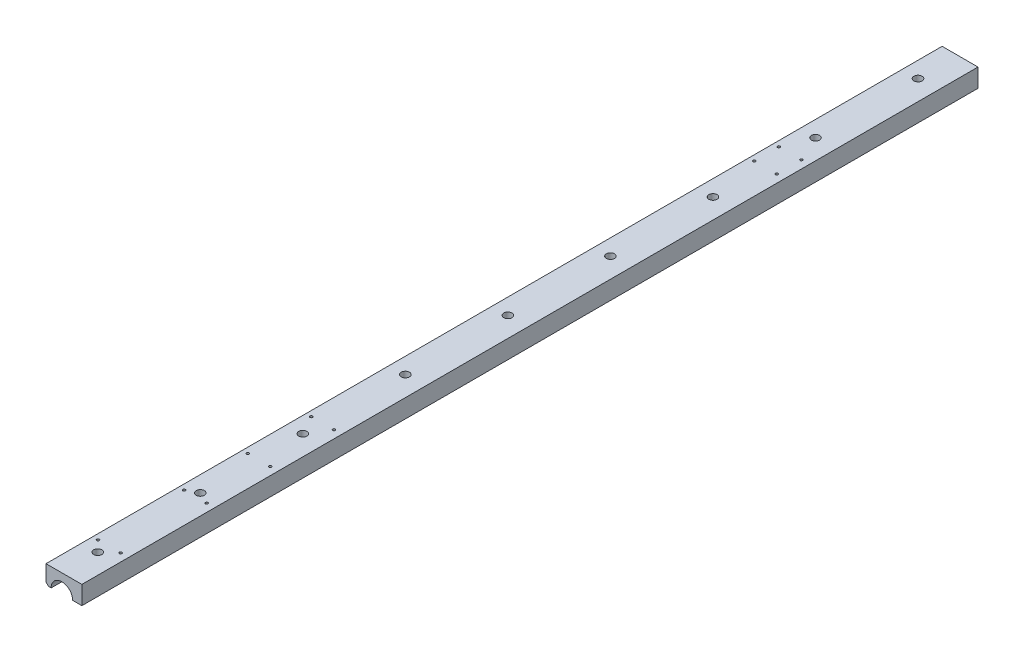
ISO-10303-21;
HEADER;
FILE_DESCRIPTION(('STEP AP214'),'2;1');
FILE_NAME('part.step','',(''),(''),'','','');
FILE_SCHEMA(('AUTOMOTIVE_DESIGN { 1 0 10303 214 1 1 1 1 }'));
ENDSEC;
DATA;
#1=APPLICATION_CONTEXT('core data for automotive mechanical design processes');
#2=APPLICATION_PROTOCOL_DEFINITION('international standard','automotive_design',2000,#1);
#3=PRODUCT_CONTEXT('',#1,'mechanical');
#4=PRODUCT('Part','Part','',(#3));
#5=PRODUCT_RELATED_PRODUCT_CATEGORY('part','',(#4));
#6=PRODUCT_DEFINITION_FORMATION('','',#4);
#7=PRODUCT_DEFINITION_CONTEXT('part definition',#1,'design');
#8=PRODUCT_DEFINITION('design','',#6,#7);
#9=PRODUCT_DEFINITION_SHAPE('','',#8);
#10=(LENGTH_UNIT() NAMED_UNIT(*) SI_UNIT(.MILLI.,.METRE.));
#11=(NAMED_UNIT(*) PLANE_ANGLE_UNIT() SI_UNIT($,.RADIAN.));
#12=(NAMED_UNIT(*) SI_UNIT($,.STERADIAN.) SOLID_ANGLE_UNIT());
#13=UNCERTAINTY_MEASURE_WITH_UNIT(LENGTH_MEASURE(1.E-05),#10,'distance_accuracy_value','');
#14=(GEOMETRIC_REPRESENTATION_CONTEXT(3) GLOBAL_UNCERTAINTY_ASSIGNED_CONTEXT((#13)) GLOBAL_UNIT_ASSIGNED_CONTEXT((#10,
#11,#12)) REPRESENTATION_CONTEXT('',''));
#15=CARTESIAN_POINT('',(0.,0.,0.));
#16=DIRECTION('',(0.,0.,1.));
#17=DIRECTION('',(1.,0.,0.));
#18=AXIS2_PLACEMENT_3D('',#15,#16,#17);
#19=CARTESIAN_POINT('',(70.,0.,1748.));
#20=DIRECTION('',(-1.,0.,0.));
#21=DIRECTION('',(0.,0.,1.));
#22=AXIS2_PLACEMENT_3D('',#19,#20,#21);
#23=PLANE('',#22);
#24=DIRECTION('',(0.,1.,0.));
#25=VECTOR('',#24,1.);
#26=CARTESIAN_POINT('',(70.,0.,0.));
#27=LINE('',#26,#25);
#28=CARTESIAN_POINT('',(70.,0.,0.));
#29=VERTEX_POINT('',#28);
#30=CARTESIAN_POINT('',(70.,36.,0.));
#31=VERTEX_POINT('',#30);
#32=EDGE_CURVE('E131',#29,#31,#27,.T.);
#33=ORIENTED_EDGE('',*,*,#32,.T.);
#34=DIRECTION('',(0.,0.,-1.));
#35=VECTOR('',#34,1.);
#36=CARTESIAN_POINT('',(70.,36.,1748.));
#37=LINE('',#36,#35);
#38=CARTESIAN_POINT('',(70.,36.,1748.));
#39=VERTEX_POINT('',#38);
#40=EDGE_CURVE('E11',#39,#31,#37,.T.);
#41=ORIENTED_EDGE('',*,*,#40,.F.);
#42=DIRECTION('',(0.,1.,0.));
#43=VECTOR('',#42,1.);
#44=CARTESIAN_POINT('',(70.,0.,1748.));
#45=LINE('',#44,#43);
#46=CARTESIAN_POINT('',(70.,0.,1748.));
#47=VERTEX_POINT('',#46);
#48=EDGE_CURVE('E144',#47,#39,#45,.T.);
#49=ORIENTED_EDGE('',*,*,#48,.F.);
#50=DIRECTION('',(0.,0.,-1.));
#51=VECTOR('',#50,1.);
#52=CARTESIAN_POINT('',(70.,0.,1748.));
#53=LINE('',#52,#51);
#54=EDGE_CURVE('E127',#47,#29,#53,.T.);
#55=ORIENTED_EDGE('',*,*,#54,.T.);
#56=EDGE_LOOP('',(#33,#41,#49,#55));
#57=FACE_BOUND('',#56,.T.);
#58=ADVANCED_FACE('F32',(#57),#23,.F.);
#59=CARTESIAN_POINT('',(0.,36.,1748.));
#60=DIRECTION('',(0.,-1.,0.));
#61=DIRECTION('',(0.,0.,-1.));
#62=AXIS2_PLACEMENT_3D('',#59,#60,#61);
#63=PLANE('',#62);
#64=CARTESIAN_POINT('',(31.,36.,77.9999999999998));
#65=DIRECTION('',(0.,1.,0.));
#66=DIRECTION('',(0.,0.,1.));
#67=AXIS2_PLACEMENT_3D('',#64,#65,#66);
#68=CIRCLE('',#67,8.00000000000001);
#69=CARTESIAN_POINT('',(31.,36.,85.9999999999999));
#70=VERTEX_POINT('',#69);
#71=EDGE_CURVE('E404',#70,#70,#68,.T.);
#72=ORIENTED_EDGE('',*,*,#71,.F.);
#73=EDGE_LOOP('',(#72));
#74=FACE_BOUND('',#73,.T.);
#75=CARTESIAN_POINT('',(31.,36.,278.));
#76=DIRECTION('',(0.,1.,0.));
#77=DIRECTION('',(0.,0.,1.));
#78=AXIS2_PLACEMENT_3D('',#75,#76,#77);
#79=CIRCLE('',#78,8.00000000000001);
#80=CARTESIAN_POINT('',(31.,36.,286.));
#81=VERTEX_POINT('',#80);
#82=EDGE_CURVE('E401',#81,#81,#79,.T.);
#83=ORIENTED_EDGE('',*,*,#82,.F.);
#84=EDGE_LOOP('',(#83));
#85=FACE_BOUND('',#84,.T.);
#86=CARTESIAN_POINT('',(31.,36.,478.));
#87=DIRECTION('',(0.,1.,0.));
#88=DIRECTION('',(0.,0.,1.));
#89=AXIS2_PLACEMENT_3D('',#86,#87,#88);
#90=CIRCLE('',#89,8.00000000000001);
#91=CARTESIAN_POINT('',(31.,36.,486.));
#92=VERTEX_POINT('',#91);
#93=EDGE_CURVE('E397',#92,#92,#90,.T.);
#94=ORIENTED_EDGE('',*,*,#93,.F.);
#95=EDGE_LOOP('',(#94));
#96=FACE_BOUND('',#95,.T.);
#97=CARTESIAN_POINT('',(31.,36.,678.));
#98=DIRECTION('',(0.,1.,0.));
#99=DIRECTION('',(0.,0.,1.));
#100=AXIS2_PLACEMENT_3D('',#97,#98,#99);
#101=CIRCLE('',#100,8.00000000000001);
#102=CARTESIAN_POINT('',(31.,36.,686.));
#103=VERTEX_POINT('',#102);
#104=EDGE_CURVE('E393',#103,#103,#101,.T.);
#105=ORIENTED_EDGE('',*,*,#104,.F.);
#106=EDGE_LOOP('',(#105));
#107=FACE_BOUND('',#106,.T.);
#108=CARTESIAN_POINT('',(31.,36.,878.));
#109=DIRECTION('',(0.,1.,0.));
#110=DIRECTION('',(0.,0.,1.));
#111=AXIS2_PLACEMENT_3D('',#108,#109,#110);
#112=CIRCLE('',#111,8.00000000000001);
#113=CARTESIAN_POINT('',(31.,36.,886.));
#114=VERTEX_POINT('',#113);
#115=EDGE_CURVE('E389',#114,#114,#112,.T.);
#116=ORIENTED_EDGE('',*,*,#115,.F.);
#117=EDGE_LOOP('',(#116));
#118=FACE_BOUND('',#117,.T.);
#119=CARTESIAN_POINT('',(31.,36.,1078.));
#120=DIRECTION('',(0.,1.,0.));
#121=DIRECTION('',(0.,0.,1.));
#122=AXIS2_PLACEMENT_3D('',#119,#120,#121);
#123=CIRCLE('',#122,8.00000000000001);
#124=CARTESIAN_POINT('',(31.,36.,1086.));
#125=VERTEX_POINT('',#124);
#126=EDGE_CURVE('E385',#125,#125,#123,.T.);
#127=ORIENTED_EDGE('',*,*,#126,.F.);
#128=EDGE_LOOP('',(#127));
#129=FACE_BOUND('',#128,.T.);
#130=CARTESIAN_POINT('',(31.,36.,1278.));
#131=DIRECTION('',(0.,1.,0.));
#132=DIRECTION('',(0.,0.,1.));
#133=AXIS2_PLACEMENT_3D('',#130,#131,#132);
#134=CIRCLE('',#133,8.00000000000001);
#135=CARTESIAN_POINT('',(31.,36.,1286.));
#136=VERTEX_POINT('',#135);
#137=EDGE_CURVE('E381',#136,#136,#134,.T.);
#138=ORIENTED_EDGE('',*,*,#137,.F.);
#139=EDGE_LOOP('',(#138));
#140=FACE_BOUND('',#139,.T.);
#141=CARTESIAN_POINT('',(31.,36.,1478.));
#142=DIRECTION('',(0.,1.,0.));
#143=DIRECTION('',(0.,0.,1.));
#144=AXIS2_PLACEMENT_3D('',#141,#142,#143);
#145=CIRCLE('',#144,8.00000000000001);
#146=CARTESIAN_POINT('',(31.,36.,1486.));
#147=VERTEX_POINT('',#146);
#148=EDGE_CURVE('E377',#147,#147,#145,.T.);
#149=ORIENTED_EDGE('',*,*,#148,.F.);
#150=EDGE_LOOP('',(#149));
#151=FACE_BOUND('',#150,.T.);
#152=CARTESIAN_POINT('',(31.,36.,1678.));
#153=DIRECTION('',(0.,1.,0.));
#154=DIRECTION('',(0.,0.,1.));
#155=AXIS2_PLACEMENT_3D('',#152,#153,#154);
#156=CIRCLE('',#155,8.00000000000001);
#157=CARTESIAN_POINT('',(31.,36.,1686.));
#158=VERTEX_POINT('',#157);
#159=EDGE_CURVE('E160',#158,#158,#156,.T.);
#160=ORIENTED_EDGE('',*,*,#159,.F.);
#161=EDGE_LOOP('',(#160));
#162=FACE_BOUND('',#161,.T.);
#163=CARTESIAN_POINT('',(54.4999999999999,36.,329.));
#164=DIRECTION('',(0.,1.,0.));
#165=DIRECTION('',(0.,0.,1.));
#166=AXIS2_PLACEMENT_3D('',#163,#164,#165);
#167=CIRCLE('',#166,2.49999999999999);
#168=CARTESIAN_POINT('',(54.4999999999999,36.,331.5));
#169=VERTEX_POINT('',#168);
#170=EDGE_CURVE('E370',#169,#169,#167,.T.);
#171=ORIENTED_EDGE('',*,*,#170,.F.);
#172=EDGE_LOOP('',(#171));
#173=FACE_BOUND('',#172,.T.);
#174=CARTESIAN_POINT('',(54.4999999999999,36.,377.));
#175=DIRECTION('',(0.,1.,0.));
#176=DIRECTION('',(0.,0.,1.));
#177=AXIS2_PLACEMENT_3D('',#174,#175,#176);
#178=CIRCLE('',#177,2.49999999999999);
#179=CARTESIAN_POINT('',(54.4999999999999,36.,379.5));
#180=VERTEX_POINT('',#179);
#181=EDGE_CURVE('E364',#180,#180,#178,.T.);
#182=ORIENTED_EDGE('',*,*,#181,.F.);
#183=EDGE_LOOP('',(#182));
#184=FACE_BOUND('',#183,.T.);
#185=CARTESIAN_POINT('',(10.4999999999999,36.,329.));
#186=DIRECTION('',(0.,1.,0.));
#187=DIRECTION('',(0.,0.,1.));
#188=AXIS2_PLACEMENT_3D('',#185,#186,#187);
#189=CIRCLE('',#188,2.49999999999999);
#190=CARTESIAN_POINT('',(10.4999999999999,36.,331.5));
#191=VERTEX_POINT('',#190);
#192=EDGE_CURVE('E358',#191,#191,#189,.T.);
#193=ORIENTED_EDGE('',*,*,#192,.F.);
#194=EDGE_LOOP('',(#193));
#195=FACE_BOUND('',#194,.T.);
#196=CARTESIAN_POINT('',(10.4999999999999,36.,377.));
#197=DIRECTION('',(0.,1.,0.));
#198=DIRECTION('',(0.,0.,1.));
#199=AXIS2_PLACEMENT_3D('',#196,#197,#198);
#200=CIRCLE('',#199,2.49999999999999);
#201=CARTESIAN_POINT('',(10.4999999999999,36.,379.5));
#202=VERTEX_POINT('',#201);
#203=EDGE_CURVE('E352',#202,#202,#200,.T.);
#204=ORIENTED_EDGE('',*,*,#203,.F.);
#205=EDGE_LOOP('',(#204));
#206=FACE_BOUND('',#205,.T.);
#207=CARTESIAN_POINT('',(54.4999999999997,36.,1241.));
#208=DIRECTION('',(0.,1.,0.));
#209=DIRECTION('',(0.,0.,1.));
#210=AXIS2_PLACEMENT_3D('',#207,#208,#209);
#211=CIRCLE('',#210,2.49999999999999);
#212=CARTESIAN_POINT('',(54.4999999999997,36.,1243.5));
#213=VERTEX_POINT('',#212);
#214=EDGE_CURVE('E346',#213,#213,#211,.T.);
#215=ORIENTED_EDGE('',*,*,#214,.F.);
#216=EDGE_LOOP('',(#215));
#217=FACE_BOUND('',#216,.T.);
#218=CARTESIAN_POINT('',(10.4999999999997,36.,1241.));
#219=DIRECTION('',(0.,1.,0.));
#220=DIRECTION('',(0.,0.,1.));
#221=AXIS2_PLACEMENT_3D('',#218,#219,#220);
#222=CIRCLE('',#221,2.49999999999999);
#223=CARTESIAN_POINT('',(10.4999999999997,36.,1243.5));
#224=VERTEX_POINT('',#223);
#225=EDGE_CURVE('E340',#224,#224,#222,.T.);
#226=ORIENTED_EDGE('',*,*,#225,.F.);
#227=EDGE_LOOP('',(#226));
#228=FACE_BOUND('',#227,.T.);
#229=CARTESIAN_POINT('',(54.4999999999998,36.,1365.));
#230=DIRECTION('',(0.,1.,0.));
#231=DIRECTION('',(0.,0.,1.));
#232=AXIS2_PLACEMENT_3D('',#229,#230,#231);
#233=CIRCLE('',#232,2.49999999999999);
#234=CARTESIAN_POINT('',(54.4999999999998,36.,1367.5));
#235=VERTEX_POINT('',#234);
#236=EDGE_CURVE('E334',#235,#235,#233,.T.);
#237=ORIENTED_EDGE('',*,*,#236,.F.);
#238=EDGE_LOOP('',(#237));
#239=FACE_BOUND('',#238,.T.);
#240=CARTESIAN_POINT('',(10.4999999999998,36.,1365.));
#241=DIRECTION('',(0.,1.,0.));
#242=DIRECTION('',(0.,0.,1.));
#243=AXIS2_PLACEMENT_3D('',#240,#241,#242);
#244=CIRCLE('',#243,2.49999999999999);
#245=CARTESIAN_POINT('',(10.4999999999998,36.,1367.5));
#246=VERTEX_POINT('',#245);
#247=EDGE_CURVE('E328',#246,#246,#244,.T.);
#248=ORIENTED_EDGE('',*,*,#247,.F.);
#249=EDGE_LOOP('',(#248));
#250=FACE_BOUND('',#249,.T.);
#251=CARTESIAN_POINT('',(54.4999999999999,36.,1489.));
#252=DIRECTION('',(0.,1.,0.));
#253=DIRECTION('',(0.,0.,1.));
#254=AXIS2_PLACEMENT_3D('',#251,#252,#253);
#255=CIRCLE('',#254,2.49999999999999);
#256=CARTESIAN_POINT('',(54.4999999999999,36.,1491.5));
#257=VERTEX_POINT('',#256);
#258=EDGE_CURVE('E322',#257,#257,#255,.T.);
#259=ORIENTED_EDGE('',*,*,#258,.F.);
#260=EDGE_LOOP('',(#259));
#261=FACE_BOUND('',#260,.T.);
#262=CARTESIAN_POINT('',(10.4999999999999,36.,1489.));
#263=DIRECTION('',(0.,1.,0.));
#264=DIRECTION('',(0.,0.,1.));
#265=AXIS2_PLACEMENT_3D('',#262,#263,#264);
#266=CIRCLE('',#265,2.49999999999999);
#267=CARTESIAN_POINT('',(10.4999999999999,36.,1491.5));
#268=VERTEX_POINT('',#267);
#269=EDGE_CURVE('E316',#268,#268,#266,.T.);
#270=ORIENTED_EDGE('',*,*,#269,.F.);
#271=EDGE_LOOP('',(#270));
#272=FACE_BOUND('',#271,.T.);
#273=CARTESIAN_POINT('',(54.5000000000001,36.,1657.));
#274=DIRECTION('',(0.,1.,0.));
#275=DIRECTION('',(0.,0.,1.));
#276=AXIS2_PLACEMENT_3D('',#273,#274,#275);
#277=CIRCLE('',#276,2.49999999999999);
#278=CARTESIAN_POINT('',(54.5000000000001,36.,1659.5));
#279=VERTEX_POINT('',#278);
#280=EDGE_CURVE('E310',#279,#279,#277,.T.);
#281=ORIENTED_EDGE('',*,*,#280,.F.);
#282=EDGE_LOOP('',(#281));
#283=FACE_BOUND('',#282,.T.);
#284=CARTESIAN_POINT('',(10.5000000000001,36.,1657.));
#285=DIRECTION('',(0.,1.,0.));
#286=DIRECTION('',(0.,0.,1.));
#287=AXIS2_PLACEMENT_3D('',#284,#285,#286);
#288=CIRCLE('',#287,2.49999999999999);
#289=CARTESIAN_POINT('',(10.5000000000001,36.,1659.5));
#290=VERTEX_POINT('',#289);
#291=EDGE_CURVE('E135',#290,#290,#288,.T.);
#292=ORIENTED_EDGE('',*,*,#291,.F.);
#293=EDGE_LOOP('',(#292));
#294=FACE_BOUND('',#293,.T.);
#295=DIRECTION('',(-1.,0.,0.));
#296=VECTOR('',#295,1.);
#297=CARTESIAN_POINT('',(0.,36.,0.));
#298=LINE('',#297,#296);
#299=CARTESIAN_POINT('',(0.,36.,0.));
#300=VERTEX_POINT('',#299);
#301=EDGE_CURVE('E134',#31,#300,#298,.T.);
#302=ORIENTED_EDGE('',*,*,#301,.T.);
#303=DIRECTION('',(0.,0.,-1.));
#304=VECTOR('',#303,1.);
#305=CARTESIAN_POINT('',(0.,36.,1748.));
#306=LINE('',#305,#304);
#307=CARTESIAN_POINT('',(0.,36.,1748.));
#308=VERTEX_POINT('',#307);
#309=EDGE_CURVE('E45',#308,#300,#306,.T.);
#310=ORIENTED_EDGE('',*,*,#309,.F.);
#311=DIRECTION('',(-1.,0.,0.));
#312=VECTOR('',#311,1.);
#313=CARTESIAN_POINT('',(0.,36.,1748.));
#314=LINE('',#313,#312);
#315=EDGE_CURVE('E95',#39,#308,#314,.T.);
#316=ORIENTED_EDGE('',*,*,#315,.F.);
#317=ORIENTED_EDGE('',*,*,#40,.T.);
#318=EDGE_LOOP('',(#302,#310,#316,#317));
#319=FACE_BOUND('',#318,.T.);
#320=ADVANCED_FACE('F285',(#74,#85,#96,#107,#118,#129,#140,#151,#162,#173,#184,#195,#206,#217,
#228,#239,#250,#261,#272,#283,#294,#319),#63,.F.);
#321=CARTESIAN_POINT('',(0.,5.,1748.));
#322=DIRECTION('',(1.,0.,0.));
#323=DIRECTION('',(0.,0.,-1.));
#324=AXIS2_PLACEMENT_3D('',#321,#322,#323);
#325=PLANE('',#324);
#326=DIRECTION('',(0.,-1.,0.));
#327=VECTOR('',#326,1.);
#328=CARTESIAN_POINT('',(0.,5.,0.));
#329=LINE('',#328,#327);
#330=CARTESIAN_POINT('',(0.,5.,0.));
#331=VERTEX_POINT('',#330);
#332=EDGE_CURVE('E137',#300,#331,#329,.T.);
#333=ORIENTED_EDGE('',*,*,#332,.T.);
#334=DIRECTION('',(0.,0.,-1.));
#335=VECTOR('',#334,1.);
#336=CARTESIAN_POINT('',(0.,5.,1748.));
#337=LINE('',#336,#335);
#338=CARTESIAN_POINT('',(0.,5.,1748.));
#339=VERTEX_POINT('',#338);
#340=EDGE_CURVE('E148',#339,#331,#337,.T.);
#341=ORIENTED_EDGE('',*,*,#340,.F.);
#342=DIRECTION('',(0.,-1.,0.));
#343=VECTOR('',#342,1.);
#344=CARTESIAN_POINT('',(0.,5.,1748.));
#345=LINE('',#344,#343);
#346=EDGE_CURVE('E300',#308,#339,#345,.T.);
#347=ORIENTED_EDGE('',*,*,#346,.F.);
#348=ORIENTED_EDGE('',*,*,#309,.T.);
#349=EDGE_LOOP('',(#333,#341,#347,#348));
#350=FACE_BOUND('',#349,.T.);
#351=ADVANCED_FACE('F290',(#350),#325,.F.);
#352=CARTESIAN_POINT('',(0.,5.,1748.));
#353=DIRECTION('',(0.707106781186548,0.707106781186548,0.));
#354=DIRECTION('',(-0.707106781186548,0.707106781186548,0.));
#355=AXIS2_PLACEMENT_3D('',#352,#353,#354);
#356=PLANE('',#355);
#357=DIRECTION('',(0.707106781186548,-0.707106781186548,0.));
#358=VECTOR('',#357,1.);
#359=CARTESIAN_POINT('',(0.,5.,0.));
#360=LINE('',#359,#358);
#361=CARTESIAN_POINT('',(5.,0.,0.));
#362=VERTEX_POINT('',#361);
#363=EDGE_CURVE('E139',#331,#362,#360,.T.);
#364=ORIENTED_EDGE('',*,*,#363,.T.);
#365=DIRECTION('',(0.,0.,-1.));
#366=VECTOR('',#365,1.);
#367=CARTESIAN_POINT('',(5.,0.,1748.));
#368=LINE('',#367,#366);
#369=CARTESIAN_POINT('',(5.,0.,1748.));
#370=VERTEX_POINT('',#369);
#371=EDGE_CURVE('E122',#370,#362,#368,.T.);
#372=ORIENTED_EDGE('',*,*,#371,.F.);
#373=DIRECTION('',(0.707106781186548,-0.707106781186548,0.));
#374=VECTOR('',#373,1.);
#375=CARTESIAN_POINT('',(0.,5.,1748.));
#376=LINE('',#375,#374);
#377=EDGE_CURVE('E113',#339,#370,#376,.T.);
#378=ORIENTED_EDGE('',*,*,#377,.F.);
#379=ORIENTED_EDGE('',*,*,#340,.T.);
#380=EDGE_LOOP('',(#364,#372,#378,#379));
#381=FACE_BOUND('',#380,.T.);
#382=ADVANCED_FACE('F647',(#381),#356,.F.);
#383=CARTESIAN_POINT('',(5.,0.,1748.));
#384=DIRECTION('',(0.,1.,0.));
#385=DIRECTION('',(0.,0.,1.));
#386=AXIS2_PLACEMENT_3D('',#383,#384,#385);
#387=PLANE('',#386);
#388=DIRECTION('',(1.,0.,0.));
#389=VECTOR('',#388,1.);
#390=CARTESIAN_POINT('',(5.,0.,0.));
#391=LINE('',#390,#389);
#392=CARTESIAN_POINT('',(10.,0.,0.));
#393=VERTEX_POINT('',#392);
#394=EDGE_CURVE('E121',#362,#393,#391,.T.);
#395=ORIENTED_EDGE('',*,*,#394,.T.);
#396=DIRECTION('',(0.,0.,-1.));
#397=VECTOR('',#396,1.);
#398=CARTESIAN_POINT('',(10.,0.,1748.));
#399=LINE('',#398,#397);
#400=CARTESIAN_POINT('',(10.,0.,1748.));
#401=VERTEX_POINT('',#400);
#402=EDGE_CURVE('E118',#401,#393,#399,.T.);
#403=ORIENTED_EDGE('',*,*,#402,.F.);
#404=DIRECTION('',(1.,0.,0.));
#405=VECTOR('',#404,1.);
#406=CARTESIAN_POINT('',(5.,0.,1748.));
#407=LINE('',#406,#405);
#408=EDGE_CURVE('E107',#370,#401,#407,.T.);
#409=ORIENTED_EDGE('',*,*,#408,.F.);
#410=ORIENTED_EDGE('',*,*,#371,.T.);
#411=EDGE_LOOP('',(#395,#403,#409,#410));
#412=FACE_BOUND('',#411,.T.);
#413=ADVANCED_FACE('F119',(#412),#387,.F.);
#414=CARTESIAN_POINT('',(31.,0.,1748.));
#415=DIRECTION('',(0.,0.,-1.));
#416=DIRECTION('',(-1.,0.,0.));
#417=AXIS2_PLACEMENT_3D('',#414,#415,#416);
#418=CYLINDRICAL_SURFACE('',#417,21.);
#419=CARTESIAN_POINT('',(31.,21.,85.9999999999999));
#420=CARTESIAN_POINT('',(31.2163613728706,21.0000008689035,86.0000011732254));
#421=CARTESIAN_POINT('',(31.432706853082,20.9966491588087,85.9912161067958));
#422=CARTESIAN_POINT('',(31.8637730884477,20.9833358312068,85.956170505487));
#423=CARTESIAN_POINT('',(32.0784938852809,20.9733743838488,85.9299104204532));
#424=CARTESIAN_POINT('',(32.5046760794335,20.9471126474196,85.8601887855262));
#425=CARTESIAN_POINT('',(32.7161381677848,20.9308137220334,85.8167309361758));
#426=CARTESIAN_POINT('',(33.1343586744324,20.8923099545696,85.7130364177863));
#427=CARTESIAN_POINT('',(33.3411169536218,20.8701049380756,85.6527992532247));
#428=CARTESIAN_POINT('',(33.7480807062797,20.8204223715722,85.5162504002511));
#429=CARTESIAN_POINT('',(33.9482996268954,20.7929565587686,85.4399744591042));
#430=CARTESIAN_POINT('',(34.3414691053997,20.7334062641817,85.2718850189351));
#431=CARTESIAN_POINT('',(34.5344171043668,20.701320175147,85.1800661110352));
#432=CARTESIAN_POINT('',(34.9118071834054,20.6333353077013,84.9816337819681));
#433=CARTESIAN_POINT('',(35.0962503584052,20.5974370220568,84.8750222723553));
#434=CARTESIAN_POINT('',(35.455694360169,20.5226826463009,84.6477082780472));
#435=CARTESIAN_POINT('',(35.6306917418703,20.4838254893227,84.5270007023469));
#436=CARTESIAN_POINT('',(35.9768933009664,20.4025335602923,84.2673096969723));
#437=CARTESIAN_POINT('',(36.1476808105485,20.3600182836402,84.1277958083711));
#438=CARTESIAN_POINT('',(36.4770180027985,20.2739056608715,83.8353047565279));
#439=CARTESIAN_POINT('',(36.63556731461,20.2303082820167,83.6823271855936));
#440=CARTESIAN_POINT('',(36.9395963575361,20.1431432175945,83.3637393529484));
#441=CARTESIAN_POINT('',(37.0850698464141,20.0995755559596,83.1981231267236));
#442=CARTESIAN_POINT('',(37.3619487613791,20.0136607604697,82.8553204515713));
#443=CARTESIAN_POINT('',(37.4933589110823,19.971313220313,82.6781379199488));
#444=CARTESIAN_POINT('',(37.7462997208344,19.8873303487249,82.3058209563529));
#445=CARTESIAN_POINT('',(37.8672234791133,19.8457915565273,82.1102516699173));
#446=CARTESIAN_POINT('',(38.0920301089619,19.7665706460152,81.7089068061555));
#447=CARTESIAN_POINT('',(38.1959198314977,19.7288869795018,81.5031353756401));
#448=CARTESIAN_POINT('',(38.3858155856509,19.6585855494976,81.0826821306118));
#449=CARTESIAN_POINT('',(38.4718235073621,19.6259672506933,80.8680012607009));
#450=CARTESIAN_POINT('',(38.6251329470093,19.5669135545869,80.4312350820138));
#451=CARTESIAN_POINT('',(38.6924356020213,19.5404777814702,80.2091502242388));
#452=CARTESIAN_POINT('',(38.8051935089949,19.4957041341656,79.7687370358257));
#453=CARTESIAN_POINT('',(38.8514482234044,19.477072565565,79.5506432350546));
#454=CARTESIAN_POINT('',(38.9256351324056,19.4470027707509,79.110867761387));
#455=CARTESIAN_POINT('',(38.953567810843,19.435564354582,78.8891861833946));
#456=CARTESIAN_POINT('',(38.9907851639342,19.4202924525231,78.4440835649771));
#457=CARTESIAN_POINT('',(39.0000767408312,19.4164561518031,78.2206631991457));
#458=CARTESIAN_POINT('',(38.9999223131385,19.4165199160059,77.7738346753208));
#459=CARTESIAN_POINT('',(38.9904770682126,19.420419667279,77.5504265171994));
#460=CARTESIAN_POINT('',(38.9541353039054,19.4353307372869,77.1193370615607));
#461=CARTESIAN_POINT('',(38.928363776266,19.4458834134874,76.9115438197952));
#462=CARTESIAN_POINT('',(38.860697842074,19.4733346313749,76.4989517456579));
#463=CARTESIAN_POINT('',(38.8187978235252,19.4902353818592,76.2941539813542));
#464=CARTESIAN_POINT('',(38.7192874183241,19.5298608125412,75.8890532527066));
#465=CARTESIAN_POINT('',(38.6616811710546,19.5525839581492,75.6887491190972));
#466=CARTESIAN_POINT('',(38.5312369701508,19.6031977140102,75.2937576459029));
#467=CARTESIAN_POINT('',(38.4583931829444,19.6310903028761,75.0990724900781));
#468=CARTESIAN_POINT('',(38.296556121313,19.6918225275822,74.712916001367));
#469=CARTESIAN_POINT('',(38.2072837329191,19.7247456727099,74.5215748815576));
#470=CARTESIAN_POINT('',(38.0141854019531,19.7942347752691,74.1469985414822));
#471=CARTESIAN_POINT('',(37.9103545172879,19.8308019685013,73.9637661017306));
#472=CARTESIAN_POINT('',(37.6888486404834,19.9066070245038,73.6064252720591));
#473=CARTESIAN_POINT('',(37.5711720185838,19.9458452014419,73.4323179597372));
#474=CARTESIAN_POINT('',(37.3226996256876,20.0259958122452,73.0941360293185));
#475=CARTESIAN_POINT('',(37.1919032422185,20.066908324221,72.9300618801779));
#476=CARTESIAN_POINT('',(36.9083590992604,20.1522879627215,72.6017069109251));
#477=CARTESIAN_POINT('',(36.7547164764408,20.1968039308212,72.4382104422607));
#478=CARTESIAN_POINT('',(36.4342340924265,20.2853820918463,72.1246839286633));
#479=CARTESIAN_POINT('',(36.2673983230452,20.3294444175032,71.9746498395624));
#480=CARTESIAN_POINT('',(35.9213664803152,20.4159733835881,71.6888566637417));
#481=CARTESIAN_POINT('',(35.7421637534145,20.4584391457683,71.5531053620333));
#482=CARTESIAN_POINT('',(35.372607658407,20.5405967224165,71.2969538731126));
#483=CARTESIAN_POINT('',(35.1822587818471,20.580289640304,71.1765475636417));
#484=CARTESIAN_POINT('',(34.7881913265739,20.6564892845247,70.9500267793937));
#485=CARTESIAN_POINT('',(34.5843009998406,20.6929307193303,70.8441886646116));
#486=CARTESIAN_POINT('',(34.1675639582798,20.7608063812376,70.6502151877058));
#487=CARTESIAN_POINT('',(33.9547210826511,20.7922427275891,70.5620723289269));
#488=CARTESIAN_POINT('',(33.5215477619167,20.8492087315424,70.4042827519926));
#489=CARTESIAN_POINT('',(33.3012184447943,20.8747392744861,70.3346332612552));
#490=CARTESIAN_POINT('',(32.8547322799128,20.9191367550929,70.2145391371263));
#491=CARTESIAN_POINT('',(32.6285757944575,20.9380041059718,70.1640933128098));
#492=CARTESIAN_POINT('',(32.1847346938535,20.967669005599,70.0851783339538));
#493=CARTESIAN_POINT('',(31.9672619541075,20.9788510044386,70.055659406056));
#494=CARTESIAN_POINT('',(31.5303866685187,20.9944386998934,70.0145870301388));
#495=CARTESIAN_POINT('',(31.3109841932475,20.998844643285,70.00303292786));
#496=CARTESIAN_POINT('',(30.8719878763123,21.000756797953,69.9980133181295));
#497=CARTESIAN_POINT('',(30.6523940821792,20.998264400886,70.0045441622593));
#498=CARTESIAN_POINT('',(30.2146725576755,20.9864526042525,70.0356168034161));
#499=CARTESIAN_POINT('',(29.9965448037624,20.9771333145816,70.0601583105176));
#500=CARTESIAN_POINT('',(29.5721261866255,20.9524351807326,70.1256481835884));
#501=CARTESIAN_POINT('',(29.3657118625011,20.9373148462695,70.1658977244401));
#502=CARTESIAN_POINT('',(28.9570859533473,20.9014014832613,70.2623912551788));
#503=CARTESIAN_POINT('',(28.7548758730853,20.8806064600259,70.3186408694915));
#504=CARTESIAN_POINT('',(28.3560965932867,20.8338683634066,70.4466156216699));
#505=CARTESIAN_POINT('',(28.1595258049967,20.8079267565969,70.5183363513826));
#506=CARTESIAN_POINT('',(27.7730854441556,20.7515101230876,70.6767052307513));
#507=CARTESIAN_POINT('',(27.5832184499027,20.7210333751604,70.7633590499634));
#508=CARTESIAN_POINT('',(27.2058855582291,20.6553247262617,70.9536785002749));
#509=CARTESIAN_POINT('',(27.0186535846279,20.6199795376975,71.0577686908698));
#510=CARTESIAN_POINT('',(26.653523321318,20.5461152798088,71.2803367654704));
#511=CARTESIAN_POINT('',(26.4756282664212,20.5075951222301,71.3988195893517));
#512=CARTESIAN_POINT('',(26.1301761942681,20.4283193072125,71.6493816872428));
#513=CARTESIAN_POINT('',(25.9626207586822,20.3875633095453,71.7814630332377));
#514=CARTESIAN_POINT('',(25.6387584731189,20.3048031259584,72.0584100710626));
#515=CARTESIAN_POINT('',(25.4824520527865,20.26279889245,72.2032762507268));
#516=CARTESIAN_POINT('',(25.1728736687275,20.176024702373,72.5140587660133));
#517=CARTESIAN_POINT('',(25.0203496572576,20.1312403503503,72.6807171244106));
#518=CARTESIAN_POINT('',(24.7298680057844,20.0426670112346,73.0264293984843));
#519=CARTESIAN_POINT('',(24.591905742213,19.9988777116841,73.2054793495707));
#520=CARTESIAN_POINT('',(24.3313322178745,19.9135050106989,73.5750686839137));
#521=CARTESIAN_POINT('',(24.2087289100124,19.8719227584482,73.7656139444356));
#522=CARTESIAN_POINT('',(23.9798985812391,19.7922422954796,74.1568870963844));
#523=CARTESIAN_POINT('',(23.8736646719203,19.7541426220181,74.3576106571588));
#524=CARTESIAN_POINT('',(23.6778035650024,19.6823877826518,74.769258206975));
#525=CARTESIAN_POINT('',(23.5882772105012,19.6487599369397,74.9802350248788));
#526=CARTESIAN_POINT('',(23.4274705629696,19.5873482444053,75.4097573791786));
#527=CARTESIAN_POINT('',(23.3561821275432,19.5595617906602,75.6282994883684));
#528=CARTESIAN_POINT('',(23.2325544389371,19.5107972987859,76.0713564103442));
#529=CARTESIAN_POINT('',(23.1802092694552,19.4898171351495,76.2958693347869));
#530=CARTESIAN_POINT('',(23.0950332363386,19.4554264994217,76.7491345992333));
#531=CARTESIAN_POINT('',(23.0622009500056,19.4420154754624,76.9778866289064));
#532=CARTESIAN_POINT('',(23.0179552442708,19.4238895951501,77.4224867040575));
#533=CARTESIAN_POINT('',(23.0052691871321,19.4186583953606,77.6381879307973));
#534=CARTESIAN_POINT('',(22.9973928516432,19.4154139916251,78.0699591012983));
#535=CARTESIAN_POINT('',(23.0022017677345,19.4174004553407,78.2860290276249));
#536=CARTESIAN_POINT('',(23.0292602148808,19.4285233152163,78.716863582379));
#537=CARTESIAN_POINT('',(23.0515080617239,19.4376590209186,78.9316283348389));
#538=CARTESIAN_POINT('',(23.1132023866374,19.4627729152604,79.358263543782));
#539=CARTESIAN_POINT('',(23.1526488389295,19.4787510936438,79.5701340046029));
#540=CARTESIAN_POINT('',(23.2467646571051,19.5163986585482,79.9825762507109));
#541=CARTESIAN_POINT('',(23.3008924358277,19.5378642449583,80.1832907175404));
#542=CARTESIAN_POINT('',(23.424394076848,19.586081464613,80.579390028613));
#543=CARTESIAN_POINT('',(23.4937732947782,19.6128349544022,80.7747729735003));
#544=CARTESIAN_POINT('',(23.6471966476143,19.6708668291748,81.1589632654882));
#545=CARTESIAN_POINT('',(23.7312382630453,19.7021444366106,81.3477717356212));
#546=CARTESIAN_POINT('',(23.913376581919,19.768387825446,81.7178433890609));
#547=CARTESIAN_POINT('',(24.0114787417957,19.8033550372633,81.8991036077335));
#548=CARTESIAN_POINT('',(24.3370791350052,19.9163279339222,82.4489292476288));
#549=CARTESIAN_POINT('',(24.5877580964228,19.9991887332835,82.8031028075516));
#550=CARTESIAN_POINT('',(25.1424827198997,20.1686218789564,83.4659287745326));
#551=CARTESIAN_POINT('',(25.4465456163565,20.2551954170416,83.7745664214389));
#552=CARTESIAN_POINT('',(25.9465724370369,20.3836917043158,84.2060571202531));
#553=CARTESIAN_POINT('',(26.1259720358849,20.4274341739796,84.3479313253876));
#554=CARTESIAN_POINT('',(26.4966378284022,20.5123332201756,84.616040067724));
#555=CARTESIAN_POINT('',(26.6878995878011,20.5534907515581,84.7422803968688));
#556=CARTESIAN_POINT('',(27.0812312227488,20.6320988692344,84.9782440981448));
#557=CARTESIAN_POINT('',(27.283307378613,20.6695472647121,85.0879577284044));
#558=CARTESIAN_POINT('',(27.6967523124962,20.7396357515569,85.2898181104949));
#559=CARTESIAN_POINT('',(27.9081171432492,20.7722778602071,85.3819722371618));
#560=CARTESIAN_POINT('',(28.3510676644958,20.8335293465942,85.552659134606));
#561=CARTESIAN_POINT('',(28.5831183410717,20.8618010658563,85.6301106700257));
#562=CARTESIAN_POINT('',(29.0540856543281,20.9109892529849,85.7635896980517));
#563=CARTESIAN_POINT('',(29.2930027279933,20.9319052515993,85.8196158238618));
#564=CARTESIAN_POINT('',(29.7754219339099,20.9656587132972,85.9095248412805));
#565=CARTESIAN_POINT('',(30.0189219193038,20.9784998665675,85.9434178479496));
#566=CARTESIAN_POINT('',(30.5082883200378,20.9956694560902,85.9886532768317));
#567=CARTESIAN_POINT('',(30.7541544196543,20.9999990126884,85.9999986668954));
#568=CARTESIAN_POINT('',(31.,21.,85.9999999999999));
#569=B_SPLINE_CURVE_WITH_KNOTS('',3,(#419,#420,#421,#422,#423,#424,#425,#426,#427,#428,#429,
#430,#431,#432,#433,#434,#435,#436,#437,#438,#439,#440,#441,#442,#443,#444,#445,#446,#447,#448,
#449,#450,#451,#452,#453,#454,#455,#456,#457,#458,#459,#460,#461,#462,#463,#464,#465,#466,#467,
#468,#469,#470,#471,#472,#473,#474,#475,#476,#477,#478,#479,#480,#481,#482,#483,#484,#485,#486,
#487,#488,#489,#490,#491,#492,#493,#494,#495,#496,#497,#498,#499,#500,#501,#502,#503,#504,#505,
#506,#507,#508,#509,#510,#511,#512,#513,#514,#515,#516,#517,#518,#519,#520,#521,#522,#523,#524,
#525,#526,#527,#528,#529,#530,#531,#532,#533,#534,#535,#536,#537,#538,#539,#540,#541,#542,#543,
#544,#545,#546,#547,#548,#549,#550,#551,#552,#553,#554,#555,#556,#557,#558,#559,#560,#561,#562,
#563,#564,#565,#566,#567,#568),.UNSPECIFIED.,.T.,.F.,(4,2,2,2,2,2,2,2,2,2,2,2,2,2,2,2,2,2,2,2,2,
2,2,2,2,2,2,2,2,2,2,2,2,2,2,2,2,2,2,2,2,2,2,2,2,2,2,2,2,2,2,2,2,2,2,2,2,2,2,2,2,2,2,2,2,2,2,2,2,
2,2,2,2,2,4),(0.,0.648853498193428,1.2976902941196,1.94638755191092,2.59510396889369,
3.24238956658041,3.88990088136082,4.53732860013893,5.18499087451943,5.85800695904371,
6.53104343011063,7.20439951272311,7.87752871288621,8.57763144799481,9.27745191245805,
9.97719836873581,10.6769022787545,11.3471929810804,12.0174659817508,12.6874907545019,
13.3574883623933,13.9857049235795,14.6141402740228,15.2424101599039,15.8709210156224,
16.5113064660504,17.1519098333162,17.7925886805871,18.4332974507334,19.1187107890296,
19.80391753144,20.4894958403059,21.1747997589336,21.8717016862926,22.568307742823,
23.2648093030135,23.9612676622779,24.6196894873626,25.2780873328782,25.9363523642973,
26.5946067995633,27.2264133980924,27.8584423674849,28.4902914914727,29.1223810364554,
29.7730175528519,30.423878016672,31.0748377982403,31.725822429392,32.4159610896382,
33.1058799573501,33.7961546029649,34.4861379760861,35.1801600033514,35.8738716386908,
36.5673664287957,37.2608106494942,37.9084059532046,38.5559714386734,39.2034743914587,
39.8509763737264,40.4772461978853,41.1037362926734,41.7301188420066,42.3567451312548,
43.6759134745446,44.9955084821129,45.6933868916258,46.3910059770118,47.0890346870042,
47.7867695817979,48.5244316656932,49.2621407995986,49.9995125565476,50.7367872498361),.UNSPECIFIED.);
#570=CARTESIAN_POINT('',(31.,21.,85.9999999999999));
#571=VERTEX_POINT('',#570);
#572=EDGE_CURVE('E35',#571,#571,#569,.T.);
#573=ORIENTED_EDGE('',*,*,#572,.T.);
#574=EDGE_LOOP('',(#573));
#575=FACE_BOUND('',#574,.T.);
#576=CARTESIAN_POINT('',(31.,21.,286.));
#577=CARTESIAN_POINT('',(31.2163613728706,21.0000008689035,286.000001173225));
#578=CARTESIAN_POINT('',(31.432706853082,20.9966491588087,285.991216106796));
#579=CARTESIAN_POINT('',(31.8637730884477,20.9833358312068,285.956170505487));
#580=CARTESIAN_POINT('',(32.0784938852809,20.9733743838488,285.929910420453));
#581=CARTESIAN_POINT('',(32.5046760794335,20.9471126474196,285.860188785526));
#582=CARTESIAN_POINT('',(32.7161381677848,20.9308137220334,285.816730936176));
#583=CARTESIAN_POINT('',(33.1343586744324,20.8923099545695,285.713036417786));
#584=CARTESIAN_POINT('',(33.3411169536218,20.8701049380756,285.652799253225));
#585=CARTESIAN_POINT('',(33.7480807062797,20.8204223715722,285.516250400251));
#586=CARTESIAN_POINT('',(33.9482996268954,20.7929565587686,285.439974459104));
#587=CARTESIAN_POINT('',(34.3414691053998,20.7334062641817,285.271885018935));
#588=CARTESIAN_POINT('',(34.5344171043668,20.701320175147,285.180066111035));
#589=CARTESIAN_POINT('',(34.9118071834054,20.6333353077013,284.981633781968));
#590=CARTESIAN_POINT('',(35.0962503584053,20.5974370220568,284.875022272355));
#591=CARTESIAN_POINT('',(35.455694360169,20.5226826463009,284.647708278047));
#592=CARTESIAN_POINT('',(35.6306917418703,20.4838254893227,284.527000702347));
#593=CARTESIAN_POINT('',(35.9768933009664,20.4025335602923,284.267309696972));
#594=CARTESIAN_POINT('',(36.1476808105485,20.3600182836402,284.127795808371));
#595=CARTESIAN_POINT('',(36.4770180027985,20.2739056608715,283.835304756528));
#596=CARTESIAN_POINT('',(36.6355673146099,20.2303082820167,283.682327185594));
#597=CARTESIAN_POINT('',(36.9395963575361,20.1431432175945,283.363739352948));
#598=CARTESIAN_POINT('',(37.0850698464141,20.0995755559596,283.198123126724));
#599=CARTESIAN_POINT('',(37.3619487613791,20.0136607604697,282.855320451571));
#600=CARTESIAN_POINT('',(37.4933589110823,19.971313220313,282.678137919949));
#601=CARTESIAN_POINT('',(37.7462997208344,19.8873303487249,282.305820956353));
#602=CARTESIAN_POINT('',(37.8672234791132,19.8457915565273,282.110251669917));
#603=CARTESIAN_POINT('',(38.0920301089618,19.7665706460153,281.708906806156));
#604=CARTESIAN_POINT('',(38.1959198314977,19.7288869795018,281.50313537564));
#605=CARTESIAN_POINT('',(38.3858155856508,19.6585855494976,281.082682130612));
#606=CARTESIAN_POINT('',(38.4718235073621,19.6259672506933,280.868001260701));
#607=CARTESIAN_POINT('',(38.6251329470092,19.5669135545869,280.431235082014));
#608=CARTESIAN_POINT('',(38.6924356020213,19.5404777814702,280.209150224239));
#609=CARTESIAN_POINT('',(38.8051935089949,19.4957041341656,279.768737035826));
#610=CARTESIAN_POINT('',(38.8514482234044,19.477072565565,279.550643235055));
#611=CARTESIAN_POINT('',(38.9256351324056,19.4470027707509,279.110867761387));
#612=CARTESIAN_POINT('',(38.953567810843,19.435564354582,278.889186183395));
#613=CARTESIAN_POINT('',(38.9907851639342,19.4202924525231,278.444083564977));
#614=CARTESIAN_POINT('',(39.0000767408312,19.4164561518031,278.220663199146));
#615=CARTESIAN_POINT('',(38.9999223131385,19.4165199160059,277.773834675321));
#616=CARTESIAN_POINT('',(38.9904770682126,19.420419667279,277.550426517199));
#617=CARTESIAN_POINT('',(38.9541353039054,19.4353307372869,277.119337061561));
#618=CARTESIAN_POINT('',(38.9283637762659,19.4458834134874,276.911543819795));
#619=CARTESIAN_POINT('',(38.860697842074,19.4733346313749,276.498951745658));
#620=CARTESIAN_POINT('',(38.8187978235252,19.4902353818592,276.294153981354));
#621=CARTESIAN_POINT('',(38.719287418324,19.5298608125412,275.889053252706));
#622=CARTESIAN_POINT('',(38.6616811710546,19.5525839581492,275.688749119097));
#623=CARTESIAN_POINT('',(38.5312369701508,19.6031977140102,275.293757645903));
#624=CARTESIAN_POINT('',(38.4583931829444,19.6310903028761,275.099072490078));
#625=CARTESIAN_POINT('',(38.296556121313,19.6918225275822,274.712916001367));
#626=CARTESIAN_POINT('',(38.2072837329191,19.7247456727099,274.521574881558));
#627=CARTESIAN_POINT('',(38.0141854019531,19.7942347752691,274.146998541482));
#628=CARTESIAN_POINT('',(37.9103545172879,19.8308019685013,273.963766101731));
#629=CARTESIAN_POINT('',(37.6888486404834,19.9066070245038,273.606425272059));
#630=CARTESIAN_POINT('',(37.5711720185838,19.9458452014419,273.432317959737));
#631=CARTESIAN_POINT('',(37.3226996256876,20.0259958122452,273.094136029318));
#632=CARTESIAN_POINT('',(37.1919032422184,20.066908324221,272.930061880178));
#633=CARTESIAN_POINT('',(36.9083590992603,20.1522879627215,272.601706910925));
#634=CARTESIAN_POINT('',(36.7547164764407,20.1968039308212,272.438210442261));
#635=CARTESIAN_POINT('',(36.4342340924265,20.2853820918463,272.124683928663));
#636=CARTESIAN_POINT('',(36.2673983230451,20.3294444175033,271.974649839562));
#637=CARTESIAN_POINT('',(35.9213664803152,20.4159733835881,271.688856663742));
#638=CARTESIAN_POINT('',(35.7421637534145,20.4584391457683,271.553105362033));
#639=CARTESIAN_POINT('',(35.372607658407,20.5405967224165,271.296953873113));
#640=CARTESIAN_POINT('',(35.182258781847,20.580289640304,271.176547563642));
#641=CARTESIAN_POINT('',(34.7881913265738,20.6564892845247,270.950026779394));
#642=CARTESIAN_POINT('',(34.5843009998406,20.6929307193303,270.844188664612));
#643=CARTESIAN_POINT('',(34.1675639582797,20.7608063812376,270.650215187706));
#644=CARTESIAN_POINT('',(33.954721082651,20.7922427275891,270.562072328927));
#645=CARTESIAN_POINT('',(33.5215477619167,20.8492087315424,270.404282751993));
#646=CARTESIAN_POINT('',(33.3012184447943,20.8747392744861,270.334633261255));
#647=CARTESIAN_POINT('',(32.8547322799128,20.9191367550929,270.214539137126));
#648=CARTESIAN_POINT('',(32.6285757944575,20.9380041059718,270.16409331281));
#649=CARTESIAN_POINT('',(32.1847346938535,20.967669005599,270.085178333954));
#650=CARTESIAN_POINT('',(31.9672619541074,20.9788510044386,270.055659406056));
#651=CARTESIAN_POINT('',(31.5303866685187,20.9944386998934,270.014587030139));
#652=CARTESIAN_POINT('',(31.3109841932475,20.998844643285,270.00303292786));
#653=CARTESIAN_POINT('',(30.8719878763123,21.000756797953,269.998013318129));
#654=CARTESIAN_POINT('',(30.6523940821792,20.998264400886,270.004544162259));
#655=CARTESIAN_POINT('',(30.2146725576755,20.9864526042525,270.035616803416));
#656=CARTESIAN_POINT('',(29.9965448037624,20.9771333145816,270.060158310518));
#657=CARTESIAN_POINT('',(29.5721261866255,20.9524351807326,270.125648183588));
#658=CARTESIAN_POINT('',(29.3657118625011,20.9373148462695,270.16589772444));
#659=CARTESIAN_POINT('',(28.9570859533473,20.9014014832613,270.262391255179));
#660=CARTESIAN_POINT('',(28.7548758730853,20.8806064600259,270.318640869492));
#661=CARTESIAN_POINT('',(28.3560965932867,20.8338683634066,270.44661562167));
#662=CARTESIAN_POINT('',(28.1595258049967,20.8079267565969,270.518336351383));
#663=CARTESIAN_POINT('',(27.7730854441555,20.7515101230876,270.676705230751));
#664=CARTESIAN_POINT('',(27.5832184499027,20.7210333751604,270.763359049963));
#665=CARTESIAN_POINT('',(27.205885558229,20.6553247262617,270.953678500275));
#666=CARTESIAN_POINT('',(27.0186535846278,20.6199795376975,271.05776869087));
#667=CARTESIAN_POINT('',(26.653523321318,20.5461152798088,271.28033676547));
#668=CARTESIAN_POINT('',(26.4756282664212,20.5075951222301,271.398819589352));
#669=CARTESIAN_POINT('',(26.1301761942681,20.4283193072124,271.649381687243));
#670=CARTESIAN_POINT('',(25.9626207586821,20.3875633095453,271.781463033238));
#671=CARTESIAN_POINT('',(25.6387584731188,20.3048031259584,272.058410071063));
#672=CARTESIAN_POINT('',(25.4824520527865,20.26279889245,272.203276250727));
#673=CARTESIAN_POINT('',(25.1728736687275,20.176024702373,272.514058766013));
#674=CARTESIAN_POINT('',(25.0203496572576,20.1312403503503,272.680717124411));
#675=CARTESIAN_POINT('',(24.7298680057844,20.0426670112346,273.026429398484));
#676=CARTESIAN_POINT('',(24.591905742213,19.9988777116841,273.205479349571));
#677=CARTESIAN_POINT('',(24.3313322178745,19.9135050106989,273.575068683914));
#678=CARTESIAN_POINT('',(24.2087289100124,19.8719227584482,273.765613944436));
#679=CARTESIAN_POINT('',(23.9798985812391,19.7922422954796,274.156887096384));
#680=CARTESIAN_POINT('',(23.8736646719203,19.7541426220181,274.357610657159));
#681=CARTESIAN_POINT('',(23.6778035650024,19.6823877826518,274.769258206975));
#682=CARTESIAN_POINT('',(23.5882772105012,19.6487599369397,274.980235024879));
#683=CARTESIAN_POINT('',(23.4274705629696,19.5873482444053,275.409757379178));
#684=CARTESIAN_POINT('',(23.3561821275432,19.5595617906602,275.628299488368));
#685=CARTESIAN_POINT('',(23.2325544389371,19.5107972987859,276.071356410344));
#686=CARTESIAN_POINT('',(23.1802092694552,19.4898171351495,276.295869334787));
#687=CARTESIAN_POINT('',(23.0950332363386,19.4554264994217,276.749134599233));
#688=CARTESIAN_POINT('',(23.0622009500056,19.4420154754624,276.977886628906));
#689=CARTESIAN_POINT('',(23.0179552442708,19.4238895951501,277.422486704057));
#690=CARTESIAN_POINT('',(23.0052691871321,19.4186583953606,277.638187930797));
#691=CARTESIAN_POINT('',(22.9973928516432,19.4154139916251,278.069959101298));
#692=CARTESIAN_POINT('',(23.0022017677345,19.4174004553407,278.286029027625));
#693=CARTESIAN_POINT('',(23.0292602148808,19.4285233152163,278.716863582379));
#694=CARTESIAN_POINT('',(23.0515080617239,19.4376590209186,278.931628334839));
#695=CARTESIAN_POINT('',(23.1132023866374,19.4627729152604,279.358263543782));
#696=CARTESIAN_POINT('',(23.1526488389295,19.4787510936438,279.570134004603));
#697=CARTESIAN_POINT('',(23.2467646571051,19.5163986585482,279.982576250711));
#698=CARTESIAN_POINT('',(23.3008924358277,19.5378642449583,280.18329071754));
#699=CARTESIAN_POINT('',(23.424394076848,19.586081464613,280.579390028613));
#700=CARTESIAN_POINT('',(23.4937732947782,19.6128349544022,280.7747729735));
#701=CARTESIAN_POINT('',(23.6471966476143,19.6708668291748,281.158963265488));
#702=CARTESIAN_POINT('',(23.7312382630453,19.7021444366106,281.347771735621));
#703=CARTESIAN_POINT('',(23.913376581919,19.768387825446,281.717843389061));
#704=CARTESIAN_POINT('',(24.0114787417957,19.8033550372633,281.899103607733));
#705=CARTESIAN_POINT('',(24.3370791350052,19.9163279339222,282.448929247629));
#706=CARTESIAN_POINT('',(24.5877580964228,19.9991887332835,282.803102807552));
#707=CARTESIAN_POINT('',(25.1424827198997,20.1686218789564,283.465928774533));
#708=CARTESIAN_POINT('',(25.4465456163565,20.2551954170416,283.774566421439));
#709=CARTESIAN_POINT('',(25.9465724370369,20.3836917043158,284.206057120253));
#710=CARTESIAN_POINT('',(26.1259720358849,20.4274341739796,284.347931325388));
#711=CARTESIAN_POINT('',(26.4966378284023,20.5123332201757,284.616040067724));
#712=CARTESIAN_POINT('',(26.6878995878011,20.5534907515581,284.742280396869));
#713=CARTESIAN_POINT('',(27.0812312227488,20.6320988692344,284.978244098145));
#714=CARTESIAN_POINT('',(27.283307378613,20.6695472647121,285.087957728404));
#715=CARTESIAN_POINT('',(27.6967523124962,20.7396357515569,285.289818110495));
#716=CARTESIAN_POINT('',(27.9081171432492,20.7722778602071,285.381972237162));
#717=CARTESIAN_POINT('',(28.3510676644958,20.8335293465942,285.552659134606));
#718=CARTESIAN_POINT('',(28.5831183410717,20.8618010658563,285.630110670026));
#719=CARTESIAN_POINT('',(29.0540856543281,20.9109892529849,285.763589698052));
#720=CARTESIAN_POINT('',(29.2930027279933,20.9319052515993,285.819615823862));
#721=CARTESIAN_POINT('',(29.7754219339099,20.9656587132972,285.90952484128));
#722=CARTESIAN_POINT('',(30.0189219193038,20.9784998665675,285.94341784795));
#723=CARTESIAN_POINT('',(30.5082883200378,20.9956694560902,285.988653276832));
#724=CARTESIAN_POINT('',(30.7541544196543,20.9999990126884,285.999998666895));
#725=CARTESIAN_POINT('',(31.,21.,286.));
#726=B_SPLINE_CURVE_WITH_KNOTS('',3,(#576,#577,#578,#579,#580,#581,#582,#583,#584,#585,#586,
#587,#588,#589,#590,#591,#592,#593,#594,#595,#596,#597,#598,#599,#600,#601,#602,#603,#604,#605,
#606,#607,#608,#609,#610,#611,#612,#613,#614,#615,#616,#617,#618,#619,#620,#621,#622,#623,#624,
#625,#626,#627,#628,#629,#630,#631,#632,#633,#634,#635,#636,#637,#638,#639,#640,#641,#642,#643,
#644,#645,#646,#647,#648,#649,#650,#651,#652,#653,#654,#655,#656,#657,#658,#659,#660,#661,#662,
#663,#664,#665,#666,#667,#668,#669,#670,#671,#672,#673,#674,#675,#676,#677,#678,#679,#680,#681,
#682,#683,#684,#685,#686,#687,#688,#689,#690,#691,#692,#693,#694,#695,#696,#697,#698,#699,#700,
#701,#702,#703,#704,#705,#706,#707,#708,#709,#710,#711,#712,#713,#714,#715,#716,#717,#718,#719,
#720,#721,#722,#723,#724,#725),.UNSPECIFIED.,.T.,.F.,(4,2,2,2,2,2,2,2,2,2,2,2,2,2,2,2,2,2,2,2,2,
2,2,2,2,2,2,2,2,2,2,2,2,2,2,2,2,2,2,2,2,2,2,2,2,2,2,2,2,2,2,2,2,2,2,2,2,2,2,2,2,2,2,2,2,2,2,2,2,
2,2,2,2,2,4),(0.,0.648853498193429,1.29769029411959,1.94638755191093,2.59510396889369,
3.24238956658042,3.88990088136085,4.53732860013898,5.18499087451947,5.85800695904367,
6.5310434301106,7.2043995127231,7.87752871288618,8.57763144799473,9.27745191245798,
9.97719836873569,10.6769022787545,11.3471929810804,12.0174659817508,12.6874907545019,
13.3574883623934,13.9857049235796,14.6141402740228,15.242410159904,15.8709210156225,
16.5113064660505,17.1519098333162,17.7925886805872,18.4332974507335,19.1187107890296,
19.80391753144,20.4894958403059,21.1747997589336,21.8717016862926,22.568307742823,
23.2648093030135,23.9612676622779,24.6196894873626,25.2780873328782,25.9363523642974,
26.5946067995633,27.2264133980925,27.8584423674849,28.4902914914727,29.1223810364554,
29.773017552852,30.4238780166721,31.0748377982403,31.725822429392,32.4159610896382,
33.1058799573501,33.7961546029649,34.4861379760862,35.1801600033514,35.8738716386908,
36.5673664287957,37.2608106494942,37.9084059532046,38.5559714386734,39.2034743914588,
39.8509763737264,40.4772461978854,41.1037362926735,41.7301188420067,42.3567451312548,
43.6759134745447,44.995508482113,45.6933868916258,46.3910059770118,47.0890346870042,
47.786769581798,48.5244316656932,49.2621407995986,49.9995125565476,50.7367872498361),.UNSPECIFIED.);
#727=CARTESIAN_POINT('',(31.,21.,286.));
#728=VERTEX_POINT('',#727);
#729=EDGE_CURVE('E400',#728,#728,#726,.T.);
#730=ORIENTED_EDGE('',*,*,#729,.T.);
#731=EDGE_LOOP('',(#730));
#732=FACE_BOUND('',#731,.T.);
#733=CARTESIAN_POINT('',(31.,21.,486.));
#734=CARTESIAN_POINT('',(31.2163613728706,21.0000008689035,486.000001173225));
#735=CARTESIAN_POINT('',(31.4327068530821,20.9966491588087,485.991216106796));
#736=CARTESIAN_POINT('',(31.8637730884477,20.9833358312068,485.956170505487));
#737=CARTESIAN_POINT('',(32.0784938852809,20.9733743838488,485.929910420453));
#738=CARTESIAN_POINT('',(32.5046760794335,20.9471126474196,485.860188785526));
#739=CARTESIAN_POINT('',(32.7161381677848,20.9308137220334,485.816730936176));
#740=CARTESIAN_POINT('',(33.1343586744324,20.8923099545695,485.713036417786));
#741=CARTESIAN_POINT('',(33.3411169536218,20.8701049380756,485.652799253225));
#742=CARTESIAN_POINT('',(33.7480807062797,20.8204223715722,485.516250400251));
#743=CARTESIAN_POINT('',(33.9482996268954,20.7929565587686,485.439974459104));
#744=CARTESIAN_POINT('',(34.3414691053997,20.7334062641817,485.271885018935));
#745=CARTESIAN_POINT('',(34.5344171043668,20.701320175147,485.180066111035));
#746=CARTESIAN_POINT('',(34.9118071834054,20.6333353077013,484.981633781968));
#747=CARTESIAN_POINT('',(35.0962503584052,20.5974370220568,484.875022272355));
#748=CARTESIAN_POINT('',(35.455694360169,20.5226826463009,484.647708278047));
#749=CARTESIAN_POINT('',(35.6306917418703,20.4838254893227,484.527000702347));
#750=CARTESIAN_POINT('',(35.9768933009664,20.4025335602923,484.267309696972));
#751=CARTESIAN_POINT('',(36.1476808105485,20.3600182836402,484.127795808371));
#752=CARTESIAN_POINT('',(36.4770180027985,20.2739056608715,483.835304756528));
#753=CARTESIAN_POINT('',(36.6355673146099,20.2303082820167,483.682327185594));
#754=CARTESIAN_POINT('',(36.9395963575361,20.1431432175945,483.363739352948));
#755=CARTESIAN_POINT('',(37.0850698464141,20.0995755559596,483.198123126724));
#756=CARTESIAN_POINT('',(37.3619487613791,20.0136607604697,482.855320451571));
#757=CARTESIAN_POINT('',(37.4933589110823,19.971313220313,482.678137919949));
#758=CARTESIAN_POINT('',(37.7462997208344,19.8873303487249,482.305820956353));
#759=CARTESIAN_POINT('',(37.8672234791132,19.8457915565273,482.110251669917));
#760=CARTESIAN_POINT('',(38.0920301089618,19.7665706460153,481.708906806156));
#761=CARTESIAN_POINT('',(38.1959198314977,19.7288869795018,481.50313537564));
#762=CARTESIAN_POINT('',(38.3858155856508,19.6585855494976,481.082682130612));
#763=CARTESIAN_POINT('',(38.4718235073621,19.6259672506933,480.868001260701));
#764=CARTESIAN_POINT('',(38.6251329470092,19.5669135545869,480.431235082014));
#765=CARTESIAN_POINT('',(38.6924356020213,19.5404777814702,480.209150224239));
#766=CARTESIAN_POINT('',(38.8051935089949,19.4957041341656,479.768737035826));
#767=CARTESIAN_POINT('',(38.8514482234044,19.477072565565,479.550643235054));
#768=CARTESIAN_POINT('',(38.9256351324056,19.4470027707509,479.110867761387));
#769=CARTESIAN_POINT('',(38.953567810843,19.435564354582,478.889186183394));
#770=CARTESIAN_POINT('',(38.9907851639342,19.4202924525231,478.444083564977));
#771=CARTESIAN_POINT('',(39.0000767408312,19.4164561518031,478.220663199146));
#772=CARTESIAN_POINT('',(38.9999223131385,19.4165199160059,477.773834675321));
#773=CARTESIAN_POINT('',(38.9904770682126,19.420419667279,477.550426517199));
#774=CARTESIAN_POINT('',(38.9541353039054,19.4353307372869,477.119337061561));
#775=CARTESIAN_POINT('',(38.9283637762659,19.4458834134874,476.911543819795));
#776=CARTESIAN_POINT('',(38.860697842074,19.4733346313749,476.498951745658));
#777=CARTESIAN_POINT('',(38.8187978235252,19.4902353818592,476.294153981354));
#778=CARTESIAN_POINT('',(38.7192874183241,19.5298608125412,475.889053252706));
#779=CARTESIAN_POINT('',(38.6616811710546,19.5525839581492,475.688749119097));
#780=CARTESIAN_POINT('',(38.5312369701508,19.6031977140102,475.293757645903));
#781=CARTESIAN_POINT('',(38.4583931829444,19.6310903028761,475.099072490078));
#782=CARTESIAN_POINT('',(38.296556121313,19.6918225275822,474.712916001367));
#783=CARTESIAN_POINT('',(38.2072837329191,19.7247456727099,474.521574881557));
#784=CARTESIAN_POINT('',(38.0141854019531,19.7942347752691,474.146998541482));
#785=CARTESIAN_POINT('',(37.9103545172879,19.8308019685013,473.963766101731));
#786=CARTESIAN_POINT('',(37.6888486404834,19.9066070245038,473.606425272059));
#787=CARTESIAN_POINT('',(37.5711720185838,19.9458452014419,473.432317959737));
#788=CARTESIAN_POINT('',(37.3226996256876,20.0259958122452,473.094136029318));
#789=CARTESIAN_POINT('',(37.1919032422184,20.066908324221,472.930061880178));
#790=CARTESIAN_POINT('',(36.9083590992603,20.1522879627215,472.601706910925));
#791=CARTESIAN_POINT('',(36.7547164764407,20.1968039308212,472.438210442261));
#792=CARTESIAN_POINT('',(36.4342340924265,20.2853820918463,472.124683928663));
#793=CARTESIAN_POINT('',(36.2673983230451,20.3294444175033,471.974649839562));
#794=CARTESIAN_POINT('',(35.9213664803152,20.4159733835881,471.688856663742));
#795=CARTESIAN_POINT('',(35.7421637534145,20.4584391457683,471.553105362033));
#796=CARTESIAN_POINT('',(35.372607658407,20.5405967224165,471.296953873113));
#797=CARTESIAN_POINT('',(35.182258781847,20.580289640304,471.176547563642));
#798=CARTESIAN_POINT('',(34.7881913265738,20.6564892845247,470.950026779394));
#799=CARTESIAN_POINT('',(34.5843009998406,20.6929307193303,470.844188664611));
#800=CARTESIAN_POINT('',(34.1675639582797,20.7608063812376,470.650215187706));
#801=CARTESIAN_POINT('',(33.9547210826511,20.7922427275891,470.562072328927));
#802=CARTESIAN_POINT('',(33.5215477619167,20.8492087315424,470.404282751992));
#803=CARTESIAN_POINT('',(33.3012184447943,20.8747392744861,470.334633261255));
#804=CARTESIAN_POINT('',(32.8547322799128,20.9191367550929,470.214539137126));
#805=CARTESIAN_POINT('',(32.6285757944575,20.9380041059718,470.16409331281));
#806=CARTESIAN_POINT('',(32.1847346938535,20.967669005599,470.085178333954));
#807=CARTESIAN_POINT('',(31.9672619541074,20.9788510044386,470.055659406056));
#808=CARTESIAN_POINT('',(31.5303866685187,20.9944386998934,470.014587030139));
#809=CARTESIAN_POINT('',(31.3109841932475,20.998844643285,470.00303292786));
#810=CARTESIAN_POINT('',(30.8719878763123,21.000756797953,469.998013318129));
#811=CARTESIAN_POINT('',(30.6523940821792,20.998264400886,470.004544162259));
#812=CARTESIAN_POINT('',(30.2146725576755,20.9864526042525,470.035616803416));
#813=CARTESIAN_POINT('',(29.9965448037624,20.9771333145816,470.060158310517));
#814=CARTESIAN_POINT('',(29.5721261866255,20.9524351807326,470.125648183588));
#815=CARTESIAN_POINT('',(29.3657118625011,20.9373148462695,470.16589772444));
#816=CARTESIAN_POINT('',(28.9570859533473,20.9014014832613,470.262391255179));
#817=CARTESIAN_POINT('',(28.7548758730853,20.8806064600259,470.318640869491));
#818=CARTESIAN_POINT('',(28.3560965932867,20.8338683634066,470.44661562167));
#819=CARTESIAN_POINT('',(28.1595258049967,20.8079267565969,470.518336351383));
#820=CARTESIAN_POINT('',(27.7730854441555,20.7515101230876,470.676705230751));
#821=CARTESIAN_POINT('',(27.5832184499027,20.7210333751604,470.763359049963));
#822=CARTESIAN_POINT('',(27.205885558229,20.6553247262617,470.953678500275));
#823=CARTESIAN_POINT('',(27.0186535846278,20.6199795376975,471.05776869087));
#824=CARTESIAN_POINT('',(26.653523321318,20.5461152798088,471.28033676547));
#825=CARTESIAN_POINT('',(26.4756282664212,20.5075951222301,471.398819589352));
#826=CARTESIAN_POINT('',(26.1301761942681,20.4283193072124,471.649381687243));
#827=CARTESIAN_POINT('',(25.9626207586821,20.3875633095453,471.781463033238));
#828=CARTESIAN_POINT('',(25.6387584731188,20.3048031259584,472.058410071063));
#829=CARTESIAN_POINT('',(25.4824520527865,20.26279889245,472.203276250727));
#830=CARTESIAN_POINT('',(25.1728736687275,20.176024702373,472.514058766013));
#831=CARTESIAN_POINT('',(25.0203496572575,20.1312403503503,472.680717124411));
#832=CARTESIAN_POINT('',(24.7298680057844,20.0426670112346,473.026429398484));
#833=CARTESIAN_POINT('',(24.591905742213,19.998877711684,473.205479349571));
#834=CARTESIAN_POINT('',(24.3313322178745,19.9135050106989,473.575068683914));
#835=CARTESIAN_POINT('',(24.2087289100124,19.8719227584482,473.765613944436));
#836=CARTESIAN_POINT('',(23.9798985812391,19.7922422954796,474.156887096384));
#837=CARTESIAN_POINT('',(23.8736646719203,19.7541426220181,474.357610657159));
#838=CARTESIAN_POINT('',(23.6778035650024,19.6823877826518,474.769258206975));
#839=CARTESIAN_POINT('',(23.5882772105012,19.6487599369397,474.980235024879));
#840=CARTESIAN_POINT('',(23.4274705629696,19.5873482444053,475.409757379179));
#841=CARTESIAN_POINT('',(23.3561821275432,19.5595617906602,475.628299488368));
#842=CARTESIAN_POINT('',(23.2325544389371,19.5107972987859,476.071356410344));
#843=CARTESIAN_POINT('',(23.1802092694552,19.4898171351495,476.295869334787));
#844=CARTESIAN_POINT('',(23.0950332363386,19.4554264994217,476.749134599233));
#845=CARTESIAN_POINT('',(23.0622009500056,19.4420154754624,476.977886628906));
#846=CARTESIAN_POINT('',(23.0179552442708,19.4238895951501,477.422486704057));
#847=CARTESIAN_POINT('',(23.0052691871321,19.4186583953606,477.638187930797));
#848=CARTESIAN_POINT('',(22.9973928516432,19.4154139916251,478.069959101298));
#849=CARTESIAN_POINT('',(23.0022017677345,19.4174004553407,478.286029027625));
#850=CARTESIAN_POINT('',(23.0292602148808,19.4285233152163,478.716863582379));
#851=CARTESIAN_POINT('',(23.0515080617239,19.4376590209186,478.931628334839));
#852=CARTESIAN_POINT('',(23.1132023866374,19.4627729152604,479.358263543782));
#853=CARTESIAN_POINT('',(23.1526488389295,19.4787510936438,479.570134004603));
#854=CARTESIAN_POINT('',(23.2467646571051,19.5163986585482,479.982576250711));
#855=CARTESIAN_POINT('',(23.3008924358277,19.5378642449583,480.18329071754));
#856=CARTESIAN_POINT('',(23.424394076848,19.586081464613,480.579390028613));
#857=CARTESIAN_POINT('',(23.4937732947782,19.6128349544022,480.7747729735));
#858=CARTESIAN_POINT('',(23.6471966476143,19.6708668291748,481.158963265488));
#859=CARTESIAN_POINT('',(23.7312382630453,19.7021444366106,481.347771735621));
#860=CARTESIAN_POINT('',(23.913376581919,19.768387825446,481.717843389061));
#861=CARTESIAN_POINT('',(24.0114787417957,19.8033550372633,481.899103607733));
#862=CARTESIAN_POINT('',(24.3370791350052,19.9163279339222,482.448929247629));
#863=CARTESIAN_POINT('',(24.5877580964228,19.9991887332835,482.803102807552));
#864=CARTESIAN_POINT('',(25.1424827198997,20.1686218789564,483.465928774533));
#865=CARTESIAN_POINT('',(25.4465456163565,20.2551954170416,483.774566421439));
#866=CARTESIAN_POINT('',(25.9465724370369,20.3836917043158,484.206057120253));
#867=CARTESIAN_POINT('',(26.1259720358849,20.4274341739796,484.347931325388));
#868=CARTESIAN_POINT('',(26.4966378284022,20.5123332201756,484.616040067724));
#869=CARTESIAN_POINT('',(26.6878995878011,20.5534907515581,484.742280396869));
#870=CARTESIAN_POINT('',(27.0812312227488,20.6320988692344,484.978244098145));
#871=CARTESIAN_POINT('',(27.283307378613,20.6695472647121,485.087957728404));
#872=CARTESIAN_POINT('',(27.6967523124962,20.7396357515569,485.289818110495));
#873=CARTESIAN_POINT('',(27.9081171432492,20.7722778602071,485.381972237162));
#874=CARTESIAN_POINT('',(28.3510676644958,20.8335293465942,485.552659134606));
#875=CARTESIAN_POINT('',(28.5831183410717,20.8618010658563,485.630110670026));
#876=CARTESIAN_POINT('',(29.0540856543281,20.9109892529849,485.763589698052));
#877=CARTESIAN_POINT('',(29.2930027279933,20.9319052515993,485.819615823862));
#878=CARTESIAN_POINT('',(29.7754219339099,20.9656587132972,485.90952484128));
#879=CARTESIAN_POINT('',(30.0189219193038,20.9784998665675,485.943417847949));
#880=CARTESIAN_POINT('',(30.5082883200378,20.9956694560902,485.988653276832));
#881=CARTESIAN_POINT('',(30.7541544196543,20.9999990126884,485.999998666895));
#882=CARTESIAN_POINT('',(31.,21.,486.));
#883=B_SPLINE_CURVE_WITH_KNOTS('',3,(#733,#734,#735,#736,#737,#738,#739,#740,#741,#742,#743,
#744,#745,#746,#747,#748,#749,#750,#751,#752,#753,#754,#755,#756,#757,#758,#759,#760,#761,#762,
#763,#764,#765,#766,#767,#768,#769,#770,#771,#772,#773,#774,#775,#776,#777,#778,#779,#780,#781,
#782,#783,#784,#785,#786,#787,#788,#789,#790,#791,#792,#793,#794,#795,#796,#797,#798,#799,#800,
#801,#802,#803,#804,#805,#806,#807,#808,#809,#810,#811,#812,#813,#814,#815,#816,#817,#818,#819,
#820,#821,#822,#823,#824,#825,#826,#827,#828,#829,#830,#831,#832,#833,#834,#835,#836,#837,#838,
#839,#840,#841,#842,#843,#844,#845,#846,#847,#848,#849,#850,#851,#852,#853,#854,#855,#856,#857,
#858,#859,#860,#861,#862,#863,#864,#865,#866,#867,#868,#869,#870,#871,#872,#873,#874,#875,#876,
#877,#878,#879,#880,#881,#882),.UNSPECIFIED.,.T.,.F.,(4,2,2,2,2,2,2,2,2,2,2,2,2,2,2,2,2,2,2,2,2,
2,2,2,2,2,2,2,2,2,2,2,2,2,2,2,2,2,2,2,2,2,2,2,2,2,2,2,2,2,2,2,2,2,2,2,2,2,2,2,2,2,2,2,2,2,2,2,2,
2,2,2,2,2,4),(0.,0.648853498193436,1.29769029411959,1.94638755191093,2.59510396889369,
3.24238956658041,3.88990088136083,4.53732860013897,5.18499087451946,5.85800695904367,
6.53104343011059,7.20439951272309,7.87752871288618,8.57763144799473,9.27745191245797,
9.97719836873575,10.6769022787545,11.3471929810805,12.0174659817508,12.6874907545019,
13.3574883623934,13.9857049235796,14.6141402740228,15.2424101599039,15.8709210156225,
16.5113064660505,17.1519098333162,17.7925886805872,18.4332974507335,19.1187107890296,
19.80391753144,20.4894958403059,21.1747997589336,21.8717016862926,22.568307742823,
23.2648093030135,23.961267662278,24.6196894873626,25.2780873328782,25.9363523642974,
26.5946067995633,27.2264133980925,27.8584423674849,28.4902914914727,29.1223810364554,
29.773017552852,30.4238780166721,31.0748377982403,31.725822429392,32.4159610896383,
33.1058799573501,33.7961546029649,34.4861379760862,35.1801600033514,35.8738716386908,
36.5673664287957,37.2608106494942,37.9084059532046,38.5559714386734,39.2034743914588,
39.8509763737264,40.4772461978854,41.1037362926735,41.7301188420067,42.3567451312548,
43.6759134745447,44.995508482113,45.6933868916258,46.3910059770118,47.0890346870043,
47.786769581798,48.5244316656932,49.2621407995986,49.9995125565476,50.7367872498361),.UNSPECIFIED.);
#884=CARTESIAN_POINT('',(31.,21.,486.));
#885=VERTEX_POINT('',#884);
#886=EDGE_CURVE('E396',#885,#885,#883,.T.);
#887=ORIENTED_EDGE('',*,*,#886,.T.);
#888=EDGE_LOOP('',(#887));
#889=FACE_BOUND('',#888,.T.);
#890=CARTESIAN_POINT('',(31.,21.,686.));
#891=CARTESIAN_POINT('',(31.2163613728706,21.0000008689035,686.000001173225));
#892=CARTESIAN_POINT('',(31.432706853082,20.9966491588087,685.991216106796));
#893=CARTESIAN_POINT('',(31.8637730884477,20.9833358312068,685.956170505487));
#894=CARTESIAN_POINT('',(32.0784938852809,20.9733743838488,685.929910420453));
#895=CARTESIAN_POINT('',(32.5046760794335,20.9471126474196,685.860188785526));
#896=CARTESIAN_POINT('',(32.7161381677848,20.9308137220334,685.816730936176));
#897=CARTESIAN_POINT('',(33.1343586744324,20.8923099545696,685.713036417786));
#898=CARTESIAN_POINT('',(33.3411169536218,20.8701049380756,685.652799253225));
#899=CARTESIAN_POINT('',(33.7480807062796,20.8204223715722,685.516250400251));
#900=CARTESIAN_POINT('',(33.9482996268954,20.7929565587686,685.439974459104));
#901=CARTESIAN_POINT('',(34.3414691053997,20.7334062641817,685.271885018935));
#902=CARTESIAN_POINT('',(34.5344171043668,20.701320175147,685.180066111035));
#903=CARTESIAN_POINT('',(34.9118071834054,20.6333353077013,684.981633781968));
#904=CARTESIAN_POINT('',(35.0962503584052,20.5974370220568,684.875022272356));
#905=CARTESIAN_POINT('',(35.455694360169,20.5226826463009,684.647708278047));
#906=CARTESIAN_POINT('',(35.6306917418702,20.4838254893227,684.527000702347));
#907=CARTESIAN_POINT('',(35.9768933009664,20.4025335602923,684.267309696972));
#908=CARTESIAN_POINT('',(36.1476808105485,20.3600182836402,684.127795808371));
#909=CARTESIAN_POINT('',(36.4770180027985,20.2739056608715,683.835304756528));
#910=CARTESIAN_POINT('',(36.6355673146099,20.2303082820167,683.682327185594));
#911=CARTESIAN_POINT('',(36.9395963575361,20.1431432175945,683.363739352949));
#912=CARTESIAN_POINT('',(37.0850698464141,20.0995755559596,683.198123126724));
#913=CARTESIAN_POINT('',(37.3619487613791,20.0136607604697,682.855320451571));
#914=CARTESIAN_POINT('',(37.4933589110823,19.971313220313,682.678137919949));
#915=CARTESIAN_POINT('',(37.7462997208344,19.8873303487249,682.305820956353));
#916=CARTESIAN_POINT('',(37.8672234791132,19.8457915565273,682.110251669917));
#917=CARTESIAN_POINT('',(38.0920301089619,19.7665706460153,681.708906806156));
#918=CARTESIAN_POINT('',(38.1959198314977,19.7288869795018,681.50313537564));
#919=CARTESIAN_POINT('',(38.3858155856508,19.6585855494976,681.082682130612));
#920=CARTESIAN_POINT('',(38.4718235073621,19.6259672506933,680.868001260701));
#921=CARTESIAN_POINT('',(38.6251329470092,19.5669135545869,680.431235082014));
#922=CARTESIAN_POINT('',(38.6924356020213,19.5404777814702,680.209150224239));
#923=CARTESIAN_POINT('',(38.8051935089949,19.4957041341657,679.768737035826));
#924=CARTESIAN_POINT('',(38.8514482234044,19.477072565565,679.550643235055));
#925=CARTESIAN_POINT('',(38.9256351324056,19.4470027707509,679.110867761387));
#926=CARTESIAN_POINT('',(38.953567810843,19.435564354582,678.889186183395));
#927=CARTESIAN_POINT('',(38.9907851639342,19.4202924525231,678.444083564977));
#928=CARTESIAN_POINT('',(39.0000767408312,19.4164561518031,678.220663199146));
#929=CARTESIAN_POINT('',(38.9999223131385,19.4165199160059,677.773834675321));
#930=CARTESIAN_POINT('',(38.9904770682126,19.420419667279,677.5504265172));
#931=CARTESIAN_POINT('',(38.9541353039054,19.4353307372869,677.119337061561));
#932=CARTESIAN_POINT('',(38.928363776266,19.4458834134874,676.911543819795));
#933=CARTESIAN_POINT('',(38.860697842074,19.4733346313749,676.498951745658));
#934=CARTESIAN_POINT('',(38.8187978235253,19.4902353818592,676.294153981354));
#935=CARTESIAN_POINT('',(38.7192874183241,19.5298608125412,675.889053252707));
#936=CARTESIAN_POINT('',(38.6616811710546,19.5525839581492,675.688749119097));
#937=CARTESIAN_POINT('',(38.5312369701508,19.6031977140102,675.293757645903));
#938=CARTESIAN_POINT('',(38.4583931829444,19.6310903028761,675.099072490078));
#939=CARTESIAN_POINT('',(38.296556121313,19.6918225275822,674.712916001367));
#940=CARTESIAN_POINT('',(38.2072837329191,19.7247456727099,674.521574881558));
#941=CARTESIAN_POINT('',(38.0141854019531,19.7942347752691,674.146998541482));
#942=CARTESIAN_POINT('',(37.910354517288,19.8308019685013,673.963766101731));
#943=CARTESIAN_POINT('',(37.6888486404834,19.9066070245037,673.606425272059));
#944=CARTESIAN_POINT('',(37.5711720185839,19.9458452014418,673.432317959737));
#945=CARTESIAN_POINT('',(37.3226996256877,20.0259958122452,673.094136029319));
#946=CARTESIAN_POINT('',(37.1919032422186,20.0669083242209,672.930061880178));
#947=CARTESIAN_POINT('',(36.9083590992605,20.1522879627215,672.601706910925));
#948=CARTESIAN_POINT('',(36.7547164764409,20.1968039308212,672.438210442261));
#949=CARTESIAN_POINT('',(36.4342340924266,20.2853820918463,672.124683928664));
#950=CARTESIAN_POINT('',(36.2673983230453,20.3294444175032,671.974649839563));
#951=CARTESIAN_POINT('',(35.9213664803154,20.415973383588,671.688856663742));
#952=CARTESIAN_POINT('',(35.7421637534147,20.4584391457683,671.553105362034));
#953=CARTESIAN_POINT('',(35.3726076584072,20.5405967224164,671.296953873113));
#954=CARTESIAN_POINT('',(35.1822587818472,20.580289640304,671.176547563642));
#955=CARTESIAN_POINT('',(34.7881913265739,20.6564892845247,670.950026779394));
#956=CARTESIAN_POINT('',(34.5843009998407,20.6929307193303,670.844188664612));
#957=CARTESIAN_POINT('',(34.1675639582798,20.7608063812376,670.650215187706));
#958=CARTESIAN_POINT('',(33.9547210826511,20.7922427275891,670.562072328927));
#959=CARTESIAN_POINT('',(33.5215477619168,20.8492087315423,670.404282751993));
#960=CARTESIAN_POINT('',(33.3012184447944,20.8747392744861,670.334633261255));
#961=CARTESIAN_POINT('',(32.8547322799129,20.9191367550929,670.214539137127));
#962=CARTESIAN_POINT('',(32.6285757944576,20.9380041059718,670.16409331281));
#963=CARTESIAN_POINT('',(32.1847346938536,20.967669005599,670.085178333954));
#964=CARTESIAN_POINT('',(31.9672619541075,20.9788510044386,670.055659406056));
#965=CARTESIAN_POINT('',(31.5303866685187,20.9944386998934,670.014587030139));
#966=CARTESIAN_POINT('',(31.3109841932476,20.998844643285,670.00303292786));
#967=CARTESIAN_POINT('',(30.8719878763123,21.000756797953,669.998013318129));
#968=CARTESIAN_POINT('',(30.6523940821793,20.998264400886,670.004544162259));
#969=CARTESIAN_POINT('',(30.2146725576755,20.9864526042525,670.035616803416));
#970=CARTESIAN_POINT('',(29.9965448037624,20.9771333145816,670.060158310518));
#971=CARTESIAN_POINT('',(29.5721261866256,20.9524351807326,670.125648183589));
#972=CARTESIAN_POINT('',(29.3657118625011,20.9373148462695,670.16589772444));
#973=CARTESIAN_POINT('',(28.9570859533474,20.9014014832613,670.262391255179));
#974=CARTESIAN_POINT('',(28.7548758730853,20.8806064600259,670.318640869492));
#975=CARTESIAN_POINT('',(28.3560965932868,20.8338683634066,670.44661562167));
#976=CARTESIAN_POINT('',(28.1595258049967,20.8079267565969,670.518336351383));
#977=CARTESIAN_POINT('',(27.7730854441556,20.7515101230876,670.676705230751));
#978=CARTESIAN_POINT('',(27.5832184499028,20.7210333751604,670.763359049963));
#979=CARTESIAN_POINT('',(27.2058855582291,20.6553247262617,670.953678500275));
#980=CARTESIAN_POINT('',(27.0186535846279,20.6199795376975,671.05776869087));
#981=CARTESIAN_POINT('',(26.6535233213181,20.5461152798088,671.28033676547));
#982=CARTESIAN_POINT('',(26.4756282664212,20.5075951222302,671.398819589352));
#983=CARTESIAN_POINT('',(26.1301761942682,20.4283193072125,671.649381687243));
#984=CARTESIAN_POINT('',(25.9626207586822,20.3875633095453,671.781463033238));
#985=CARTESIAN_POINT('',(25.6387584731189,20.3048031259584,672.058410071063));
#986=CARTESIAN_POINT('',(25.4824520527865,20.26279889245,672.203276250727));
#987=CARTESIAN_POINT('',(25.1728736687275,20.176024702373,672.514058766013));
#988=CARTESIAN_POINT('',(25.0203496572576,20.1312403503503,672.680717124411));
#989=CARTESIAN_POINT('',(24.7298680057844,20.0426670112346,673.026429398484));
#990=CARTESIAN_POINT('',(24.591905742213,19.9988777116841,673.205479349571));
#991=CARTESIAN_POINT('',(24.3313322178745,19.9135050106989,673.575068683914));
#992=CARTESIAN_POINT('',(24.2087289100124,19.8719227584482,673.765613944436));
#993=CARTESIAN_POINT('',(23.9798985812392,19.7922422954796,674.156887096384));
#994=CARTESIAN_POINT('',(23.8736646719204,19.7541426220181,674.357610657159));
#995=CARTESIAN_POINT('',(23.6778035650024,19.6823877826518,674.769258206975));
#996=CARTESIAN_POINT('',(23.5882772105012,19.6487599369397,674.980235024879));
#997=CARTESIAN_POINT('',(23.4274705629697,19.5873482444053,675.409757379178));
#998=CARTESIAN_POINT('',(23.3561821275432,19.5595617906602,675.628299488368));
#999=CARTESIAN_POINT('',(23.2325544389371,19.5107972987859,676.071356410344));
#1000=CARTESIAN_POINT('',(23.1802092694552,19.4898171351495,676.295869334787));
#1001=CARTESIAN_POINT('',(23.0950332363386,19.4554264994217,676.749134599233));
#1002=CARTESIAN_POINT('',(23.0622009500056,19.4420154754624,676.977886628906));
#1003=CARTESIAN_POINT('',(23.0179552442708,19.4238895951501,677.422486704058));
#1004=CARTESIAN_POINT('',(23.0052691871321,19.4186583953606,677.638187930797));
#1005=CARTESIAN_POINT('',(22.9973928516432,19.4154139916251,678.069959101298));
#1006=CARTESIAN_POINT('',(23.0022017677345,19.4174004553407,678.286029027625));
#1007=CARTESIAN_POINT('',(23.0292602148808,19.4285233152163,678.716863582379));
#1008=CARTESIAN_POINT('',(23.0515080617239,19.4376590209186,678.931628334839));
#1009=CARTESIAN_POINT('',(23.1132023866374,19.4627729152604,679.358263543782));
#1010=CARTESIAN_POINT('',(23.1526488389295,19.4787510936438,679.570134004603));
#1011=CARTESIAN_POINT('',(23.2467646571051,19.5163986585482,679.982576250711));
#1012=CARTESIAN_POINT('',(23.3008924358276,19.5378642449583,680.18329071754));
#1013=CARTESIAN_POINT('',(23.424394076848,19.586081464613,680.579390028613));
#1014=CARTESIAN_POINT('',(23.4937732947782,19.6128349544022,680.7747729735));
#1015=CARTESIAN_POINT('',(23.6471966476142,19.6708668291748,681.158963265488));
#1016=CARTESIAN_POINT('',(23.7312382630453,19.7021444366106,681.347771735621));
#1017=CARTESIAN_POINT('',(23.913376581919,19.768387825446,681.717843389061));
#1018=CARTESIAN_POINT('',(24.0114787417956,19.8033550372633,681.899103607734));
#1019=CARTESIAN_POINT('',(24.3370791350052,19.9163279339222,682.448929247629));
#1020=CARTESIAN_POINT('',(24.5877580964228,19.9991887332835,682.803102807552));
#1021=CARTESIAN_POINT('',(25.1424827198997,20.1686218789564,683.465928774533));
#1022=CARTESIAN_POINT('',(25.4465456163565,20.2551954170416,683.774566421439));
#1023=CARTESIAN_POINT('',(25.9465724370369,20.3836917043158,684.206057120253));
#1024=CARTESIAN_POINT('',(26.1259720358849,20.4274341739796,684.347931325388));
#1025=CARTESIAN_POINT('',(26.4966378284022,20.5123332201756,684.616040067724));
#1026=CARTESIAN_POINT('',(26.6878995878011,20.5534907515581,684.742280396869));
#1027=CARTESIAN_POINT('',(27.0812312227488,20.6320988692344,684.978244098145));
#1028=CARTESIAN_POINT('',(27.283307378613,20.6695472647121,685.087957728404));
#1029=CARTESIAN_POINT('',(27.6967523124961,20.7396357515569,685.289818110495));
#1030=CARTESIAN_POINT('',(27.9081171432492,20.7722778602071,685.381972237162));
#1031=CARTESIAN_POINT('',(28.3510676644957,20.8335293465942,685.552659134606));
#1032=CARTESIAN_POINT('',(28.5831183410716,20.8618010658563,685.630110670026));
#1033=CARTESIAN_POINT('',(29.054085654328,20.9109892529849,685.763589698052));
#1034=CARTESIAN_POINT('',(29.2930027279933,20.9319052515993,685.819615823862));
#1035=CARTESIAN_POINT('',(29.7754219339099,20.9656587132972,685.909524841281));
#1036=CARTESIAN_POINT('',(30.0189219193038,20.9784998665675,685.94341784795));
#1037=CARTESIAN_POINT('',(30.5082883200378,20.9956694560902,685.988653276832));
#1038=CARTESIAN_POINT('',(30.7541544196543,20.9999990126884,685.999998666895));
#1039=CARTESIAN_POINT('',(31.,21.,686.));
#1040=B_SPLINE_CURVE_WITH_KNOTS('',3,(#890,#891,#892,#893,#894,#895,#896,#897,#898,#899,#900,
#901,#902,#903,#904,#905,#906,#907,#908,#909,#910,#911,#912,#913,#914,#915,#916,#917,#918,#919,
#920,#921,#922,#923,#924,#925,#926,#927,#928,#929,#930,#931,#932,#933,#934,#935,#936,#937,#938,
#939,#940,#941,#942,#943,#944,#945,#946,#947,#948,#949,#950,#951,#952,#953,#954,#955,#956,#957,
#958,#959,#960,#961,#962,#963,#964,#965,#966,#967,#968,#969,#970,#971,#972,#973,#974,#975,#976,
#977,#978,#979,#980,#981,#982,#983,#984,#985,#986,#987,#988,#989,#990,#991,#992,#993,#994,#995,
#996,#997,#998,#999,#1000,#1001,#1002,#1003,#1004,#1005,#1006,#1007,#1008,#1009,#1010,#1011,
#1012,#1013,#1014,#1015,#1016,#1017,#1018,#1019,#1020,#1021,#1022,#1023,#1024,#1025,#1026,#1027,
#1028,#1029,#1030,#1031,#1032,#1033,#1034,#1035,#1036,#1037,#1038,#1039),.UNSPECIFIED.,.T.,.F.,
(4,2,2,2,2,2,2,2,2,2,2,2,2,2,2,2,2,2,2,2,2,2,2,2,2,2,2,2,2,2,2,2,2,2,2,2,2,2,2,2,2,2,2,2,2,2,2,
2,2,2,2,2,2,2,2,2,2,2,2,2,2,2,2,2,2,2,2,2,2,2,2,2,2,2,4),(0.,0.648853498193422,1.29769029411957,
1.94638755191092,2.59510396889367,3.24238956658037,3.88990088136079,4.53732860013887,
5.18499087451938,5.85800695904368,6.53104343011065,7.20439951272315,7.87752871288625,
8.57763144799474,9.27745191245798,9.9771983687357,10.6769022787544,11.3471929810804,
12.0174659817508,12.6874907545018,13.3574883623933,13.9857049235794,14.6141402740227,
15.2424101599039,15.8709210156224,16.5113064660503,17.1519098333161,17.792588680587,
18.4332974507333,19.1187107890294,19.8039175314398,20.4894958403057,21.1747997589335,
21.8717016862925,22.5683077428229,23.2648093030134,23.9612676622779,24.6196894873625,
25.2780873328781,25.9363523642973,26.5946067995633,27.2264133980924,27.8584423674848,
28.4902914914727,29.1223810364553,29.7730175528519,30.423878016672,31.0748377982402,
31.725822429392,32.4159610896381,33.10587995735,33.7961546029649,34.486137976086,
35.1801600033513,35.8738716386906,36.5673664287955,37.260810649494,37.9084059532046,
38.5559714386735,39.2034743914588,39.8509763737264,40.4772461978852,41.1037362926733,
41.7301188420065,42.3567451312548,43.6759134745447,44.9955084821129,45.6933868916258,
46.3910059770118,47.0890346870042,47.7867695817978,48.5244316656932,49.2621407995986,
49.9995125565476,50.7367872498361),.UNSPECIFIED.);
#1041=CARTESIAN_POINT('',(31.,21.,686.));
#1042=VERTEX_POINT('',#1041);
#1043=EDGE_CURVE('E392',#1042,#1042,#1040,.T.);
#1044=ORIENTED_EDGE('',*,*,#1043,.T.);
#1045=EDGE_LOOP('',(#1044));
#1046=FACE_BOUND('',#1045,.T.);
#1047=CARTESIAN_POINT('',(31.,21.,886.));
#1048=CARTESIAN_POINT('',(31.2163613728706,21.0000008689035,886.000001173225));
#1049=CARTESIAN_POINT('',(31.432706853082,20.9966491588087,885.991216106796));
#1050=CARTESIAN_POINT('',(31.8637730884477,20.9833358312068,885.956170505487));
#1051=CARTESIAN_POINT('',(32.0784938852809,20.9733743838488,885.929910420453));
#1052=CARTESIAN_POINT('',(32.5046760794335,20.9471126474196,885.860188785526));
#1053=CARTESIAN_POINT('',(32.7161381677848,20.9308137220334,885.816730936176));
#1054=CARTESIAN_POINT('',(33.1343586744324,20.8923099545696,885.713036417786));
#1055=CARTESIAN_POINT('',(33.3411169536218,20.8701049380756,885.652799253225));
#1056=CARTESIAN_POINT('',(33.7480807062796,20.8204223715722,885.516250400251));
#1057=CARTESIAN_POINT('',(33.9482996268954,20.7929565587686,885.439974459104));
#1058=CARTESIAN_POINT('',(34.3414691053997,20.7334062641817,885.271885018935));
#1059=CARTESIAN_POINT('',(34.5344171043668,20.701320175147,885.180066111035));
#1060=CARTESIAN_POINT('',(34.9118071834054,20.6333353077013,884.981633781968));
#1061=CARTESIAN_POINT('',(35.0962503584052,20.5974370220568,884.875022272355));
#1062=CARTESIAN_POINT('',(35.455694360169,20.5226826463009,884.647708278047));
#1063=CARTESIAN_POINT('',(35.6306917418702,20.4838254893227,884.527000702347));
#1064=CARTESIAN_POINT('',(35.9768933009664,20.4025335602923,884.267309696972));
#1065=CARTESIAN_POINT('',(36.1476808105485,20.3600182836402,884.127795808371));
#1066=CARTESIAN_POINT('',(36.4770180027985,20.2739056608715,883.835304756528));
#1067=CARTESIAN_POINT('',(36.6355673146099,20.2303082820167,883.682327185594));
#1068=CARTESIAN_POINT('',(36.9395963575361,20.1431432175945,883.363739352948));
#1069=CARTESIAN_POINT('',(37.0850698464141,20.0995755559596,883.198123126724));
#1070=CARTESIAN_POINT('',(37.3619487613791,20.0136607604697,882.855320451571));
#1071=CARTESIAN_POINT('',(37.4933589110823,19.971313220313,882.678137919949));
#1072=CARTESIAN_POINT('',(37.7462997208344,19.8873303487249,882.305820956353));
#1073=CARTESIAN_POINT('',(37.8672234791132,19.8457915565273,882.110251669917));
#1074=CARTESIAN_POINT('',(38.0920301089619,19.7665706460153,881.708906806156));
#1075=CARTESIAN_POINT('',(38.1959198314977,19.7288869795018,881.50313537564));
#1076=CARTESIAN_POINT('',(38.3858155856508,19.6585855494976,881.082682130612));
#1077=CARTESIAN_POINT('',(38.4718235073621,19.6259672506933,880.868001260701));
#1078=CARTESIAN_POINT('',(38.6251329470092,19.5669135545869,880.431235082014));
#1079=CARTESIAN_POINT('',(38.6924356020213,19.5404777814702,880.209150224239));
#1080=CARTESIAN_POINT('',(38.8051935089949,19.4957041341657,879.768737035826));
#1081=CARTESIAN_POINT('',(38.8514482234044,19.477072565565,879.550643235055));
#1082=CARTESIAN_POINT('',(38.9256351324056,19.4470027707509,879.110867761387));
#1083=CARTESIAN_POINT('',(38.953567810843,19.435564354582,878.889186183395));
#1084=CARTESIAN_POINT('',(38.9907851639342,19.4202924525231,878.444083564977));
#1085=CARTESIAN_POINT('',(39.0000767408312,19.4164561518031,878.220663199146));
#1086=CARTESIAN_POINT('',(38.9999223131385,19.4165199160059,877.773834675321));
#1087=CARTESIAN_POINT('',(38.9904770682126,19.420419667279,877.5504265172));
#1088=CARTESIAN_POINT('',(38.9541353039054,19.4353307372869,877.119337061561));
#1089=CARTESIAN_POINT('',(38.928363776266,19.4458834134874,876.911543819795));
#1090=CARTESIAN_POINT('',(38.860697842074,19.4733346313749,876.498951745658));
#1091=CARTESIAN_POINT('',(38.8187978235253,19.4902353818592,876.294153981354));
#1092=CARTESIAN_POINT('',(38.7192874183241,19.5298608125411,875.889053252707));
#1093=CARTESIAN_POINT('',(38.6616811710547,19.5525839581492,875.688749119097));
#1094=CARTESIAN_POINT('',(38.5312369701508,19.6031977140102,875.293757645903));
#1095=CARTESIAN_POINT('',(38.4583931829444,19.6310903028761,875.099072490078));
#1096=CARTESIAN_POINT('',(38.296556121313,19.6918225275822,874.712916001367));
#1097=CARTESIAN_POINT('',(38.2072837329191,19.7247456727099,874.521574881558));
#1098=CARTESIAN_POINT('',(38.0141854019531,19.7942347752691,874.146998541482));
#1099=CARTESIAN_POINT('',(37.910354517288,19.8308019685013,873.963766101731));
#1100=CARTESIAN_POINT('',(37.6888486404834,19.9066070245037,873.606425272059));
#1101=CARTESIAN_POINT('',(37.5711720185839,19.9458452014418,873.432317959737));
#1102=CARTESIAN_POINT('',(37.3226996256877,20.0259958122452,873.094136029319));
#1103=CARTESIAN_POINT('',(37.1919032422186,20.0669083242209,872.930061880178));
#1104=CARTESIAN_POINT('',(36.9083590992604,20.1522879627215,872.601706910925));
#1105=CARTESIAN_POINT('',(36.7547164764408,20.1968039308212,872.438210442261));
#1106=CARTESIAN_POINT('',(36.4342340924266,20.2853820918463,872.124683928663));
#1107=CARTESIAN_POINT('',(36.2673983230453,20.3294444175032,871.974649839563));
#1108=CARTESIAN_POINT('',(35.9213664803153,20.415973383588,871.688856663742));
#1109=CARTESIAN_POINT('',(35.7421637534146,20.4584391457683,871.553105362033));
#1110=CARTESIAN_POINT('',(35.3726076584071,20.5405967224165,871.296953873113));
#1111=CARTESIAN_POINT('',(35.1822587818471,20.580289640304,871.176547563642));
#1112=CARTESIAN_POINT('',(34.7881913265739,20.6564892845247,870.950026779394));
#1113=CARTESIAN_POINT('',(34.5843009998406,20.6929307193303,870.844188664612));
#1114=CARTESIAN_POINT('',(34.1675639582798,20.7608063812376,870.650215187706));
#1115=CARTESIAN_POINT('',(33.9547210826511,20.7922427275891,870.562072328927));
#1116=CARTESIAN_POINT('',(33.5215477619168,20.8492087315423,870.404282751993));
#1117=CARTESIAN_POINT('',(33.3012184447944,20.8747392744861,870.334633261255));
#1118=CARTESIAN_POINT('',(32.8547322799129,20.9191367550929,870.214539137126));
#1119=CARTESIAN_POINT('',(32.6285757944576,20.9380041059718,870.16409331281));
#1120=CARTESIAN_POINT('',(32.1847346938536,20.967669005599,870.085178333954));
#1121=CARTESIAN_POINT('',(31.9672619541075,20.9788510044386,870.055659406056));
#1122=CARTESIAN_POINT('',(31.5303866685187,20.9944386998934,870.014587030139));
#1123=CARTESIAN_POINT('',(31.3109841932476,20.998844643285,870.00303292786));
#1124=CARTESIAN_POINT('',(30.8719878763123,21.000756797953,869.998013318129));
#1125=CARTESIAN_POINT('',(30.6523940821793,20.998264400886,870.004544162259));
#1126=CARTESIAN_POINT('',(30.2146725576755,20.9864526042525,870.035616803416));
#1127=CARTESIAN_POINT('',(29.9965448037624,20.9771333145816,870.060158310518));
#1128=CARTESIAN_POINT('',(29.5721261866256,20.9524351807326,870.125648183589));
#1129=CARTESIAN_POINT('',(29.3657118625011,20.9373148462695,870.16589772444));
#1130=CARTESIAN_POINT('',(28.9570859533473,20.9014014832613,870.262391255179));
#1131=CARTESIAN_POINT('',(28.7548758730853,20.8806064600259,870.318640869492));
#1132=CARTESIAN_POINT('',(28.3560965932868,20.8338683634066,870.44661562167));
#1133=CARTESIAN_POINT('',(28.1595258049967,20.8079267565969,870.518336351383));
#1134=CARTESIAN_POINT('',(27.7730854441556,20.7515101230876,870.676705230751));
#1135=CARTESIAN_POINT('',(27.5832184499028,20.7210333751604,870.763359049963));
#1136=CARTESIAN_POINT('',(27.2058855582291,20.6553247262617,870.953678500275));
#1137=CARTESIAN_POINT('',(27.0186535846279,20.6199795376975,871.05776869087));
#1138=CARTESIAN_POINT('',(26.653523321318,20.5461152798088,871.28033676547));
#1139=CARTESIAN_POINT('',(26.4756282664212,20.5075951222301,871.398819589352));
#1140=CARTESIAN_POINT('',(26.1301761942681,20.4283193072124,871.649381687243));
#1141=CARTESIAN_POINT('',(25.9626207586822,20.3875633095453,871.781463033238));
#1142=CARTESIAN_POINT('',(25.6387584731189,20.3048031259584,872.058410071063));
#1143=CARTESIAN_POINT('',(25.4824520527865,20.26279889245,872.203276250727));
#1144=CARTESIAN_POINT('',(25.1728736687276,20.176024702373,872.514058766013));
#1145=CARTESIAN_POINT('',(25.0203496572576,20.1312403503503,872.680717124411));
#1146=CARTESIAN_POINT('',(24.7298680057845,20.0426670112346,873.026429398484));
#1147=CARTESIAN_POINT('',(24.591905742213,19.9988777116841,873.205479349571));
#1148=CARTESIAN_POINT('',(24.3313322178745,19.9135050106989,873.575068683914));
#1149=CARTESIAN_POINT('',(24.2087289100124,19.8719227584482,873.765613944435));
#1150=CARTESIAN_POINT('',(23.9798985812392,19.7922422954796,874.156887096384));
#1151=CARTESIAN_POINT('',(23.8736646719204,19.7541426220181,874.357610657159));
#1152=CARTESIAN_POINT('',(23.6778035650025,19.6823877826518,874.769258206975));
#1153=CARTESIAN_POINT('',(23.5882772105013,19.6487599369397,874.980235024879));
#1154=CARTESIAN_POINT('',(23.4274705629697,19.5873482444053,875.409757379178));
#1155=CARTESIAN_POINT('',(23.3561821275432,19.5595617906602,875.628299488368));
#1156=CARTESIAN_POINT('',(23.2325544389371,19.5107972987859,876.071356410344));
#1157=CARTESIAN_POINT('',(23.1802092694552,19.4898171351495,876.295869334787));
#1158=CARTESIAN_POINT('',(23.0950332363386,19.4554264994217,876.749134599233));
#1159=CARTESIAN_POINT('',(23.0622009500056,19.4420154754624,876.977886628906));
#1160=CARTESIAN_POINT('',(23.0179552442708,19.4238895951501,877.422486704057));
#1161=CARTESIAN_POINT('',(23.0052691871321,19.4186583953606,877.638187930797));
#1162=CARTESIAN_POINT('',(22.9973928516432,19.4154139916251,878.069959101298));
#1163=CARTESIAN_POINT('',(23.0022017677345,19.4174004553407,878.286029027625));
#1164=CARTESIAN_POINT('',(23.0292602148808,19.4285233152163,878.716863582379));
#1165=CARTESIAN_POINT('',(23.0515080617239,19.4376590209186,878.931628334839));
#1166=CARTESIAN_POINT('',(23.1132023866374,19.4627729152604,879.358263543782));
#1167=CARTESIAN_POINT('',(23.1526488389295,19.4787510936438,879.570134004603));
#1168=CARTESIAN_POINT('',(23.2467646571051,19.5163986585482,879.982576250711));
#1169=CARTESIAN_POINT('',(23.3008924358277,19.5378642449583,880.18329071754));
#1170=CARTESIAN_POINT('',(23.424394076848,19.586081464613,880.579390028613));
#1171=CARTESIAN_POINT('',(23.4937732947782,19.6128349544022,880.7747729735));
#1172=CARTESIAN_POINT('',(23.6471966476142,19.6708668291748,881.158963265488));
#1173=CARTESIAN_POINT('',(23.7312382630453,19.7021444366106,881.347771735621));
#1174=CARTESIAN_POINT('',(23.913376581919,19.768387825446,881.717843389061));
#1175=CARTESIAN_POINT('',(24.0114787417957,19.8033550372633,881.899103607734));
#1176=CARTESIAN_POINT('',(24.3370791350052,19.9163279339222,882.448929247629));
#1177=CARTESIAN_POINT('',(24.5877580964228,19.9991887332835,882.803102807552));
#1178=CARTESIAN_POINT('',(25.1424827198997,20.1686218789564,883.465928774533));
#1179=CARTESIAN_POINT('',(25.4465456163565,20.2551954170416,883.774566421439));
#1180=CARTESIAN_POINT('',(25.9465724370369,20.3836917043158,884.206057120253));
#1181=CARTESIAN_POINT('',(26.1259720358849,20.4274341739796,884.347931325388));
#1182=CARTESIAN_POINT('',(26.4966378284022,20.5123332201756,884.616040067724));
#1183=CARTESIAN_POINT('',(26.6878995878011,20.5534907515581,884.742280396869));
#1184=CARTESIAN_POINT('',(27.0812312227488,20.6320988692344,884.978244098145));
#1185=CARTESIAN_POINT('',(27.283307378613,20.6695472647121,885.087957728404));
#1186=CARTESIAN_POINT('',(27.6967523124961,20.7396357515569,885.289818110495));
#1187=CARTESIAN_POINT('',(27.9081171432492,20.7722778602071,885.381972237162));
#1188=CARTESIAN_POINT('',(28.3510676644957,20.8335293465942,885.552659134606));
#1189=CARTESIAN_POINT('',(28.5831183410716,20.8618010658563,885.630110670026));
#1190=CARTESIAN_POINT('',(29.054085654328,20.9109892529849,885.763589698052));
#1191=CARTESIAN_POINT('',(29.2930027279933,20.9319052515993,885.819615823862));
#1192=CARTESIAN_POINT('',(29.7754219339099,20.9656587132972,885.90952484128));
#1193=CARTESIAN_POINT('',(30.0189219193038,20.9784998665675,885.94341784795));
#1194=CARTESIAN_POINT('',(30.5082883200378,20.9956694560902,885.988653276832));
#1195=CARTESIAN_POINT('',(30.7541544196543,20.9999990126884,885.999998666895));
#1196=CARTESIAN_POINT('',(31.,21.,886.));
#1197=B_SPLINE_CURVE_WITH_KNOTS('',3,(#1047,#1048,#1049,#1050,#1051,#1052,#1053,#1054,#1055,
#1056,#1057,#1058,#1059,#1060,#1061,#1062,#1063,#1064,#1065,#1066,#1067,#1068,#1069,#1070,#1071,
#1072,#1073,#1074,#1075,#1076,#1077,#1078,#1079,#1080,#1081,#1082,#1083,#1084,#1085,#1086,#1087,
#1088,#1089,#1090,#1091,#1092,#1093,#1094,#1095,#1096,#1097,#1098,#1099,#1100,#1101,#1102,#1103,
#1104,#1105,#1106,#1107,#1108,#1109,#1110,#1111,#1112,#1113,#1114,#1115,#1116,#1117,#1118,#1119,
#1120,#1121,#1122,#1123,#1124,#1125,#1126,#1127,#1128,#1129,#1130,#1131,#1132,#1133,#1134,#1135,
#1136,#1137,#1138,#1139,#1140,#1141,#1142,#1143,#1144,#1145,#1146,#1147,#1148,#1149,#1150,#1151,
#1152,#1153,#1154,#1155,#1156,#1157,#1158,#1159,#1160,#1161,#1162,#1163,#1164,#1165,#1166,#1167,
#1168,#1169,#1170,#1171,#1172,#1173,#1174,#1175,#1176,#1177,#1178,#1179,#1180,#1181,#1182,#1183,
#1184,#1185,#1186,#1187,#1188,#1189,#1190,#1191,#1192,#1193,#1194,#1195,#1196),.UNSPECIFIED.,
.T.,.F.,(4,2,2,2,2,2,2,2,2,2,2,2,2,2,2,2,2,2,2,2,2,2,2,2,2,2,2,2,2,2,2,2,2,2,2,2,2,2,2,2,2,2,2,
2,2,2,2,2,2,2,2,2,2,2,2,2,2,2,2,2,2,2,2,2,2,2,2,2,2,2,2,2,2,2,4),(0.,0.648853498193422,
1.29769029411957,1.94638755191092,2.59510396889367,3.24238956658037,3.88990088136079,
4.53732860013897,5.18499087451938,5.85800695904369,6.53104343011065,7.20439951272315,
7.87752871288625,8.57763144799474,9.27745191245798,9.9771983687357,10.6769022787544,
11.3471929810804,12.0174659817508,12.6874907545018,13.3574883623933,13.9857049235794,
14.6141402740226,15.2424101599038,15.8709210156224,16.5113064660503,17.1519098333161,
17.792588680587,18.4332974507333,19.1187107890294,19.8039175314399,20.4894958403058,
21.1747997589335,21.8717016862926,22.568307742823,23.2648093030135,23.9612676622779,
24.6196894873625,25.2780873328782,25.9363523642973,26.5946067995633,27.2264133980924,
27.8584423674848,28.4902914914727,29.1223810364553,29.7730175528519,30.423878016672,
31.0748377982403,31.725822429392,32.4159610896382,33.10587995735,33.7961546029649,
34.486137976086,35.1801600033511,35.8738716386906,36.5673664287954,37.2608106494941,
37.9084059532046,38.5559714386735,39.2034743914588,39.8509763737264,40.4772461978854,
41.1037362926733,41.7301188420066,42.3567451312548,43.6759134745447,44.9955084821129,
45.6933868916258,46.3910059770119,47.0890346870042,47.7867695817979,48.5244316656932,
49.2621407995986,49.9995125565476,50.7367872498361),.UNSPECIFIED.);
#1198=CARTESIAN_POINT('',(31.,21.,886.));
#1199=VERTEX_POINT('',#1198);
#1200=EDGE_CURVE('E388',#1199,#1199,#1197,.T.);
#1201=ORIENTED_EDGE('',*,*,#1200,.T.);
#1202=EDGE_LOOP('',(#1201));
#1203=FACE_BOUND('',#1202,.T.);
#1204=CARTESIAN_POINT('',(31.,21.,1086.));
#1205=CARTESIAN_POINT('',(31.2163613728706,21.0000008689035,1086.00000117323));
#1206=CARTESIAN_POINT('',(31.4327068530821,20.9966491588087,1085.9912161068));
#1207=CARTESIAN_POINT('',(31.8637730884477,20.9833358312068,1085.95617050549));
#1208=CARTESIAN_POINT('',(32.0784938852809,20.9733743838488,1085.92991042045));
#1209=CARTESIAN_POINT('',(32.5046760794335,20.9471126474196,1085.86018878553));
#1210=CARTESIAN_POINT('',(32.7161381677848,20.9308137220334,1085.81673093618));
#1211=CARTESIAN_POINT('',(33.1343586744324,20.8923099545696,1085.71303641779));
#1212=CARTESIAN_POINT('',(33.3411169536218,20.8701049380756,1085.65279925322));
#1213=CARTESIAN_POINT('',(33.7480807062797,20.8204223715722,1085.51625040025));
#1214=CARTESIAN_POINT('',(33.9482996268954,20.7929565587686,1085.4399744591));
#1215=CARTESIAN_POINT('',(34.3414691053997,20.7334062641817,1085.27188501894));
#1216=CARTESIAN_POINT('',(34.5344171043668,20.701320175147,1085.18006611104));
#1217=CARTESIAN_POINT('',(34.9118071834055,20.6333353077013,1084.98163378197));
#1218=CARTESIAN_POINT('',(35.0962503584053,20.5974370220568,1084.87502227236));
#1219=CARTESIAN_POINT('',(35.4556943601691,20.5226826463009,1084.64770827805));
#1220=CARTESIAN_POINT('',(35.6306917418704,20.4838254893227,1084.52700070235));
#1221=CARTESIAN_POINT('',(35.9768933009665,20.4025335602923,1084.26730969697));
#1222=CARTESIAN_POINT('',(36.1476808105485,20.3600182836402,1084.12779580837));
#1223=CARTESIAN_POINT('',(36.4770180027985,20.2739056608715,1083.83530475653));
#1224=CARTESIAN_POINT('',(36.63556731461,20.2303082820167,1083.68232718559));
#1225=CARTESIAN_POINT('',(36.9395963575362,20.1431432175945,1083.36373935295));
#1226=CARTESIAN_POINT('',(37.0850698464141,20.0995755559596,1083.19812312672));
#1227=CARTESIAN_POINT('',(37.3619487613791,20.0136607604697,1082.85532045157));
#1228=CARTESIAN_POINT('',(37.4933589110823,19.971313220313,1082.67813791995));
#1229=CARTESIAN_POINT('',(37.7462997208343,19.887330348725,1082.30582095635));
#1230=CARTESIAN_POINT('',(37.8672234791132,19.8457915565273,1082.11025166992));
#1231=CARTESIAN_POINT('',(38.0920301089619,19.7665706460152,1081.70890680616));
#1232=CARTESIAN_POINT('',(38.1959198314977,19.7288869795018,1081.50313537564));
#1233=CARTESIAN_POINT('',(38.3858155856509,19.6585855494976,1081.08268213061));
#1234=CARTESIAN_POINT('',(38.4718235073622,19.6259672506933,1080.8680012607));
#1235=CARTESIAN_POINT('',(38.6251329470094,19.5669135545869,1080.43123508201));
#1236=CARTESIAN_POINT('',(38.6924356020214,19.5404777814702,1080.20915022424));
#1237=CARTESIAN_POINT('',(38.8051935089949,19.4957041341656,1079.76873703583));
#1238=CARTESIAN_POINT('',(38.8514482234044,19.477072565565,1079.55064323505));
#1239=CARTESIAN_POINT('',(38.9256351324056,19.4470027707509,1079.11086776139));
#1240=CARTESIAN_POINT('',(38.9535678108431,19.435564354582,1078.88918618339));
#1241=CARTESIAN_POINT('',(38.9907851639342,19.4202924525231,1078.44408356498));
#1242=CARTESIAN_POINT('',(39.0000767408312,19.4164561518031,1078.22066319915));
#1243=CARTESIAN_POINT('',(38.9999223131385,19.4165199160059,1077.77383467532));
#1244=CARTESIAN_POINT('',(38.9904770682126,19.420419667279,1077.5504265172));
#1245=CARTESIAN_POINT('',(38.9541353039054,19.4353307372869,1077.11933706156));
#1246=CARTESIAN_POINT('',(38.9283637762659,19.4458834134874,1076.9115438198));
#1247=CARTESIAN_POINT('',(38.860697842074,19.4733346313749,1076.49895174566));
#1248=CARTESIAN_POINT('',(38.8187978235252,19.4902353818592,1076.29415398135));
#1249=CARTESIAN_POINT('',(38.719287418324,19.5298608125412,1075.88905325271));
#1250=CARTESIAN_POINT('',(38.6616811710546,19.5525839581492,1075.6887491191));
#1251=CARTESIAN_POINT('',(38.5312369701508,19.6031977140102,1075.2937576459));
#1252=CARTESIAN_POINT('',(38.4583931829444,19.6310903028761,1075.09907249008));
#1253=CARTESIAN_POINT('',(38.296556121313,19.6918225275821,1074.71291600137));
#1254=CARTESIAN_POINT('',(38.2072837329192,19.7247456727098,1074.52157488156));
#1255=CARTESIAN_POINT('',(38.0141854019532,19.7942347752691,1074.14699854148));
#1256=CARTESIAN_POINT('',(37.9103545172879,19.8308019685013,1073.96376610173));
#1257=CARTESIAN_POINT('',(37.6888486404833,19.9066070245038,1073.60642527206));
#1258=CARTESIAN_POINT('',(37.5711720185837,19.9458452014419,1073.43231795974));
#1259=CARTESIAN_POINT('',(37.3226996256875,20.0259958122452,1073.09413602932));
#1260=CARTESIAN_POINT('',(37.1919032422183,20.066908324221,1072.93006188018));
#1261=CARTESIAN_POINT('',(36.9083590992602,20.1522879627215,1072.60170691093));
#1262=CARTESIAN_POINT('',(36.7547164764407,20.1968039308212,1072.43821044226));
#1263=CARTESIAN_POINT('',(36.4342340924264,20.2853820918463,1072.12468392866));
#1264=CARTESIAN_POINT('',(36.267398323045,20.3294444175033,1071.97464983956));
#1265=CARTESIAN_POINT('',(35.921366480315,20.4159733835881,1071.68885666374));
#1266=CARTESIAN_POINT('',(35.7421637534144,20.4584391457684,1071.55310536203));
#1267=CARTESIAN_POINT('',(35.372607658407,20.5405967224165,1071.29695387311));
#1268=CARTESIAN_POINT('',(35.182258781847,20.580289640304,1071.17654756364));
#1269=CARTESIAN_POINT('',(34.7881913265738,20.6564892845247,1070.95002677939));
#1270=CARTESIAN_POINT('',(34.5843009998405,20.6929307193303,1070.84418866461));
#1271=CARTESIAN_POINT('',(34.1675639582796,20.7608063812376,1070.65021518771));
#1272=CARTESIAN_POINT('',(33.9547210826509,20.7922427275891,1070.56207232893));
#1273=CARTESIAN_POINT('',(33.5215477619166,20.8492087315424,1070.40428275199));
#1274=CARTESIAN_POINT('',(33.3012184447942,20.8747392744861,1070.33463326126));
#1275=CARTESIAN_POINT('',(32.8547322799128,20.9191367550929,1070.21453913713));
#1276=CARTESIAN_POINT('',(32.6285757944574,20.9380041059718,1070.16409331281));
#1277=CARTESIAN_POINT('',(32.1847346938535,20.967669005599,1070.08517833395));
#1278=CARTESIAN_POINT('',(31.9672619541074,20.9788510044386,1070.05565940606));
#1279=CARTESIAN_POINT('',(31.5303866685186,20.9944386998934,1070.01458703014));
#1280=CARTESIAN_POINT('',(31.3109841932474,20.998844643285,1070.00303292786));
#1281=CARTESIAN_POINT('',(30.8719878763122,21.000756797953,1069.99801331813));
#1282=CARTESIAN_POINT('',(30.6523940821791,20.998264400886,1070.00454416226));
#1283=CARTESIAN_POINT('',(30.2146725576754,20.9864526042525,1070.03561680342));
#1284=CARTESIAN_POINT('',(29.9965448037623,20.9771333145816,1070.06015831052));
#1285=CARTESIAN_POINT('',(29.5721261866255,20.9524351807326,1070.12564818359));
#1286=CARTESIAN_POINT('',(29.365711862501,20.9373148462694,1070.16589772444));
#1287=CARTESIAN_POINT('',(28.9570859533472,20.9014014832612,1070.26239125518));
#1288=CARTESIAN_POINT('',(28.7548758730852,20.8806064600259,1070.31864086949));
#1289=CARTESIAN_POINT('',(28.3560965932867,20.8338683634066,1070.44661562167));
#1290=CARTESIAN_POINT('',(28.1595258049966,20.8079267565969,1070.51833635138));
#1291=CARTESIAN_POINT('',(27.7730854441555,20.7515101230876,1070.67670523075));
#1292=CARTESIAN_POINT('',(27.5832184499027,20.7210333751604,1070.76335904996));
#1293=CARTESIAN_POINT('',(27.2058855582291,20.6553247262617,1070.95367850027));
#1294=CARTESIAN_POINT('',(27.0186535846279,20.6199795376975,1071.05776869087));
#1295=CARTESIAN_POINT('',(26.6535233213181,20.5461152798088,1071.28033676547));
#1296=CARTESIAN_POINT('',(26.4756282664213,20.5075951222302,1071.39881958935));
#1297=CARTESIAN_POINT('',(26.1301761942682,20.4283193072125,1071.64938168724));
#1298=CARTESIAN_POINT('',(25.9626207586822,20.3875633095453,1071.78146303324));
#1299=CARTESIAN_POINT('',(25.6387584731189,20.3048031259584,1072.05841007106));
#1300=CARTESIAN_POINT('',(25.4824520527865,20.26279889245,1072.20327625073));
#1301=CARTESIAN_POINT('',(25.1728736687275,20.176024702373,1072.51405876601));
#1302=CARTESIAN_POINT('',(25.0203496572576,20.1312403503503,1072.68071712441));
#1303=CARTESIAN_POINT('',(24.7298680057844,20.0426670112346,1073.02642939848));
#1304=CARTESIAN_POINT('',(24.591905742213,19.9988777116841,1073.20547934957));
#1305=CARTESIAN_POINT('',(24.3313322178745,19.9135050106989,1073.57506868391));
#1306=CARTESIAN_POINT('',(24.2087289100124,19.8719227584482,1073.76561394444));
#1307=CARTESIAN_POINT('',(23.9798985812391,19.7922422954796,1074.15688709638));
#1308=CARTESIAN_POINT('',(23.8736646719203,19.7541426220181,1074.35761065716));
#1309=CARTESIAN_POINT('',(23.6778035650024,19.6823877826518,1074.76925820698));
#1310=CARTESIAN_POINT('',(23.5882772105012,19.6487599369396,1074.98023502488));
#1311=CARTESIAN_POINT('',(23.4274705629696,19.5873482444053,1075.40975737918));
#1312=CARTESIAN_POINT('',(23.3561821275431,19.5595617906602,1075.62829948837));
#1313=CARTESIAN_POINT('',(23.2325544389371,19.5107972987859,1076.07135641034));
#1314=CARTESIAN_POINT('',(23.1802092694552,19.4898171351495,1076.29586933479));
#1315=CARTESIAN_POINT('',(23.0950332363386,19.4554264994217,1076.74913459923));
#1316=CARTESIAN_POINT('',(23.0622009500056,19.4420154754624,1076.97788662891));
#1317=CARTESIAN_POINT('',(23.0179552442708,19.4238895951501,1077.42248670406));
#1318=CARTESIAN_POINT('',(23.0052691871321,19.4186583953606,1077.6381879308));
#1319=CARTESIAN_POINT('',(22.9973928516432,19.4154139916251,1078.0699591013));
#1320=CARTESIAN_POINT('',(23.0022017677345,19.4174004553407,1078.28602902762));
#1321=CARTESIAN_POINT('',(23.0292602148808,19.4285233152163,1078.71686358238));
#1322=CARTESIAN_POINT('',(23.0515080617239,19.4376590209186,1078.93162833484));
#1323=CARTESIAN_POINT('',(23.1132023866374,19.4627729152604,1079.35826354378));
#1324=CARTESIAN_POINT('',(23.1526488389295,19.4787510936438,1079.5701340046));
#1325=CARTESIAN_POINT('',(23.2467646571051,19.5163986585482,1079.98257625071));
#1326=CARTESIAN_POINT('',(23.3008924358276,19.5378642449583,1080.18329071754));
#1327=CARTESIAN_POINT('',(23.4243940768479,19.586081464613,1080.57939002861));
#1328=CARTESIAN_POINT('',(23.4937732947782,19.6128349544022,1080.7747729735));
#1329=CARTESIAN_POINT('',(23.6471966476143,19.6708668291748,1081.15896326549));
#1330=CARTESIAN_POINT('',(23.7312382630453,19.7021444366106,1081.34777173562));
#1331=CARTESIAN_POINT('',(23.913376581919,19.768387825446,1081.71784338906));
#1332=CARTESIAN_POINT('',(24.0114787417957,19.8033550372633,1081.89910360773));
#1333=CARTESIAN_POINT('',(24.3370791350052,19.9163279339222,1082.44892924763));
#1334=CARTESIAN_POINT('',(24.5877580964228,19.9991887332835,1082.80310280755));
#1335=CARTESIAN_POINT('',(25.1424827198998,20.1686218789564,1083.46592877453));
#1336=CARTESIAN_POINT('',(25.4465456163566,20.2551954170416,1083.77456642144));
#1337=CARTESIAN_POINT('',(25.946572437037,20.3836917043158,1084.20605712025));
#1338=CARTESIAN_POINT('',(26.125972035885,20.4274341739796,1084.34793132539));
#1339=CARTESIAN_POINT('',(26.4966378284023,20.5123332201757,1084.61604006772));
#1340=CARTESIAN_POINT('',(26.6878995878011,20.5534907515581,1084.74228039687));
#1341=CARTESIAN_POINT('',(27.0812312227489,20.6320988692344,1084.97824409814));
#1342=CARTESIAN_POINT('',(27.2833073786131,20.6695472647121,1085.0879577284));
#1343=CARTESIAN_POINT('',(27.6967523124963,20.7396357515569,1085.2898181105));
#1344=CARTESIAN_POINT('',(27.9081171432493,20.7722778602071,1085.38197223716));
#1345=CARTESIAN_POINT('',(28.3510676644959,20.8335293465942,1085.55265913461));
#1346=CARTESIAN_POINT('',(28.5831183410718,20.8618010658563,1085.63011067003));
#1347=CARTESIAN_POINT('',(29.0540856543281,20.9109892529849,1085.76358969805));
#1348=CARTESIAN_POINT('',(29.2930027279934,20.9319052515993,1085.81961582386));
#1349=CARTESIAN_POINT('',(29.77542193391,20.9656587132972,1085.90952484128));
#1350=CARTESIAN_POINT('',(30.0189219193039,20.9784998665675,1085.94341784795));
#1351=CARTESIAN_POINT('',(30.5082883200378,20.9956694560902,1085.98865327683));
#1352=CARTESIAN_POINT('',(30.7541544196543,20.9999990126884,1085.9999986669));
#1353=CARTESIAN_POINT('',(31.,21.,1086.));
#1354=B_SPLINE_CURVE_WITH_KNOTS('',3,(#1204,#1205,#1206,#1207,#1208,#1209,#1210,#1211,#1212,
#1213,#1214,#1215,#1216,#1217,#1218,#1219,#1220,#1221,#1222,#1223,#1224,#1225,#1226,#1227,#1228,
#1229,#1230,#1231,#1232,#1233,#1234,#1235,#1236,#1237,#1238,#1239,#1240,#1241,#1242,#1243,#1244,
#1245,#1246,#1247,#1248,#1249,#1250,#1251,#1252,#1253,#1254,#1255,#1256,#1257,#1258,#1259,#1260,
#1261,#1262,#1263,#1264,#1265,#1266,#1267,#1268,#1269,#1270,#1271,#1272,#1273,#1274,#1275,#1276,
#1277,#1278,#1279,#1280,#1281,#1282,#1283,#1284,#1285,#1286,#1287,#1288,#1289,#1290,#1291,#1292,
#1293,#1294,#1295,#1296,#1297,#1298,#1299,#1300,#1301,#1302,#1303,#1304,#1305,#1306,#1307,#1308,
#1309,#1310,#1311,#1312,#1313,#1314,#1315,#1316,#1317,#1318,#1319,#1320,#1321,#1322,#1323,#1324,
#1325,#1326,#1327,#1328,#1329,#1330,#1331,#1332,#1333,#1334,#1335,#1336,#1337,#1338,#1339,#1340,
#1341,#1342,#1343,#1344,#1345,#1346,#1347,#1348,#1349,#1350,#1351,#1352,#1353),.UNSPECIFIED.,
.T.,.F.,(4,2,2,2,2,2,2,2,2,2,2,2,2,2,2,2,2,2,2,2,2,2,2,2,2,2,2,2,2,2,2,2,2,2,2,2,2,2,2,2,2,2,2,
2,2,2,2,2,2,2,2,2,2,2,2,2,2,2,2,2,2,2,2,2,2,2,2,2,2,2,2,2,2,2,4),(0.,0.648853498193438,
1.29769029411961,1.94638755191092,2.5951039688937,3.24238956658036,3.88990088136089,
4.53732860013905,5.18499087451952,5.85800695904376,6.53104343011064,7.20439951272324,
7.87752871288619,8.57763144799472,9.27745191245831,9.97719836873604,10.6769022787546,
11.3471929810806,12.017465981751,12.687490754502,13.3574883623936,13.9857049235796,
14.6141402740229,15.2424101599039,15.8709210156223,16.5113064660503,17.1519098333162,
17.7925886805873,18.4332974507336,19.1187107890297,19.8039175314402,20.489495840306,
21.1747997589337,21.8717016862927,22.5683077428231,23.2648093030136,23.961267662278,
24.6196894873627,25.2780873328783,25.9363523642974,26.5946067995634,27.2264133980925,
27.8584423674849,28.4902914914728,29.1223810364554,29.7730175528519,30.423878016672,
31.0748377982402,31.725822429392,32.4159610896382,33.10587995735,33.7961546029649,
34.4861379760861,35.1801600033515,35.8738716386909,36.5673664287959,37.2608106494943,
37.9084059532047,38.5559714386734,39.2034743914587,39.8509763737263,40.4772461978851,
41.1037362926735,41.7301188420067,42.3567451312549,43.6759134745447,44.995508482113,
45.6933868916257,46.3910059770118,47.0890346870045,47.786769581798,48.5244316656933,
49.2621407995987,49.9995125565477,50.7367872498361),.UNSPECIFIED.);
#1355=CARTESIAN_POINT('',(31.,21.,1086.));
#1356=VERTEX_POINT('',#1355);
#1357=EDGE_CURVE('E384',#1356,#1356,#1354,.T.);
#1358=ORIENTED_EDGE('',*,*,#1357,.T.);
#1359=EDGE_LOOP('',(#1358));
#1360=FACE_BOUND('',#1359,.T.);
#1361=CARTESIAN_POINT('',(31.,21.,1286.));
#1362=CARTESIAN_POINT('',(31.2163613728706,21.0000008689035,1286.00000117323));
#1363=CARTESIAN_POINT('',(31.4327068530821,20.9966491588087,1285.9912161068));
#1364=CARTESIAN_POINT('',(31.8637730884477,20.9833358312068,1285.95617050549));
#1365=CARTESIAN_POINT('',(32.0784938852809,20.9733743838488,1285.92991042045));
#1366=CARTESIAN_POINT('',(32.5046760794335,20.9471126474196,1285.86018878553));
#1367=CARTESIAN_POINT('',(32.7161381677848,20.9308137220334,1285.81673093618));
#1368=CARTESIAN_POINT('',(33.1343586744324,20.8923099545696,1285.71303641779));
#1369=CARTESIAN_POINT('',(33.3411169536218,20.8701049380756,1285.65279925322));
#1370=CARTESIAN_POINT('',(33.7480807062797,20.8204223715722,1285.51625040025));
#1371=CARTESIAN_POINT('',(33.9482996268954,20.7929565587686,1285.4399744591));
#1372=CARTESIAN_POINT('',(34.3414691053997,20.7334062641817,1285.27188501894));
#1373=CARTESIAN_POINT('',(34.5344171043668,20.701320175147,1285.18006611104));
#1374=CARTESIAN_POINT('',(34.9118071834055,20.6333353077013,1284.98163378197));
#1375=CARTESIAN_POINT('',(35.0962503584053,20.5974370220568,1284.87502227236));
#1376=CARTESIAN_POINT('',(35.4556943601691,20.5226826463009,1284.64770827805));
#1377=CARTESIAN_POINT('',(35.6306917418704,20.4838254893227,1284.52700070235));
#1378=CARTESIAN_POINT('',(35.9768933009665,20.4025335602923,1284.26730969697));
#1379=CARTESIAN_POINT('',(36.1476808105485,20.3600182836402,1284.12779580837));
#1380=CARTESIAN_POINT('',(36.4770180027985,20.2739056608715,1283.83530475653));
#1381=CARTESIAN_POINT('',(36.63556731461,20.2303082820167,1283.68232718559));
#1382=CARTESIAN_POINT('',(36.9395963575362,20.1431432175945,1283.36373935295));
#1383=CARTESIAN_POINT('',(37.0850698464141,20.0995755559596,1283.19812312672));
#1384=CARTESIAN_POINT('',(37.3619487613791,20.0136607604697,1282.85532045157));
#1385=CARTESIAN_POINT('',(37.4933589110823,19.971313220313,1282.67813791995));
#1386=CARTESIAN_POINT('',(37.7462997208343,19.887330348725,1282.30582095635));
#1387=CARTESIAN_POINT('',(37.8672234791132,19.8457915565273,1282.11025166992));
#1388=CARTESIAN_POINT('',(38.0920301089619,19.7665706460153,1281.70890680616));
#1389=CARTESIAN_POINT('',(38.1959198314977,19.7288869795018,1281.50313537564));
#1390=CARTESIAN_POINT('',(38.3858155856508,19.6585855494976,1281.08268213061));
#1391=CARTESIAN_POINT('',(38.4718235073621,19.6259672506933,1280.8680012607));
#1392=CARTESIAN_POINT('',(38.6251329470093,19.5669135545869,1280.43123508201));
#1393=CARTESIAN_POINT('',(38.6924356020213,19.5404777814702,1280.20915022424));
#1394=CARTESIAN_POINT('',(38.8051935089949,19.4957041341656,1279.76873703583));
#1395=CARTESIAN_POINT('',(38.8514482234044,19.477072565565,1279.55064323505));
#1396=CARTESIAN_POINT('',(38.9256351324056,19.4470027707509,1279.11086776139));
#1397=CARTESIAN_POINT('',(38.9535678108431,19.435564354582,1278.88918618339));
#1398=CARTESIAN_POINT('',(38.9907851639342,19.4202924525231,1278.44408356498));
#1399=CARTESIAN_POINT('',(39.0000767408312,19.4164561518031,1278.22066319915));
#1400=CARTESIAN_POINT('',(38.9999223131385,19.4165199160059,1277.77383467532));
#1401=CARTESIAN_POINT('',(38.9904770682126,19.420419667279,1277.5504265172));
#1402=CARTESIAN_POINT('',(38.9541353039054,19.4353307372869,1277.11933706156));
#1403=CARTESIAN_POINT('',(38.9283637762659,19.4458834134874,1276.9115438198));
#1404=CARTESIAN_POINT('',(38.860697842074,19.4733346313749,1276.49895174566));
#1405=CARTESIAN_POINT('',(38.8187978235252,19.4902353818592,1276.29415398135));
#1406=CARTESIAN_POINT('',(38.719287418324,19.5298608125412,1275.88905325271));
#1407=CARTESIAN_POINT('',(38.6616811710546,19.5525839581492,1275.6887491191));
#1408=CARTESIAN_POINT('',(38.5312369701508,19.6031977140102,1275.2937576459));
#1409=CARTESIAN_POINT('',(38.4583931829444,19.6310903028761,1275.09907249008));
#1410=CARTESIAN_POINT('',(38.296556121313,19.6918225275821,1274.71291600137));
#1411=CARTESIAN_POINT('',(38.2072837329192,19.7247456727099,1274.52157488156));
#1412=CARTESIAN_POINT('',(38.0141854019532,19.7942347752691,1274.14699854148));
#1413=CARTESIAN_POINT('',(37.9103545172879,19.8308019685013,1273.96376610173));
#1414=CARTESIAN_POINT('',(37.6888486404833,19.9066070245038,1273.60642527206));
#1415=CARTESIAN_POINT('',(37.5711720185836,19.9458452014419,1273.43231795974));
#1416=CARTESIAN_POINT('',(37.3226996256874,20.0259958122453,1273.09413602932));
#1417=CARTESIAN_POINT('',(37.1919032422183,20.066908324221,1272.93006188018));
#1418=CARTESIAN_POINT('',(36.9083590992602,20.1522879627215,1272.60170691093));
#1419=CARTESIAN_POINT('',(36.7547164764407,20.1968039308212,1272.43821044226));
#1420=CARTESIAN_POINT('',(36.4342340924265,20.2853820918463,1272.12468392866));
#1421=CARTESIAN_POINT('',(36.2673983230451,20.3294444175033,1271.97464983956));
#1422=CARTESIAN_POINT('',(35.9213664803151,20.4159733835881,1271.68885666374));
#1423=CARTESIAN_POINT('',(35.7421637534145,20.4584391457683,1271.55310536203));
#1424=CARTESIAN_POINT('',(35.372607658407,20.5405967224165,1271.29695387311));
#1425=CARTESIAN_POINT('',(35.182258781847,20.580289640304,1271.17654756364));
#1426=CARTESIAN_POINT('',(34.7881913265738,20.6564892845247,1270.95002677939));
#1427=CARTESIAN_POINT('',(34.5843009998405,20.6929307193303,1270.84418866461));
#1428=CARTESIAN_POINT('',(34.1675639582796,20.7608063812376,1270.65021518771));
#1429=CARTESIAN_POINT('',(33.9547210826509,20.7922427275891,1270.56207232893));
#1430=CARTESIAN_POINT('',(33.5215477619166,20.8492087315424,1270.40428275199));
#1431=CARTESIAN_POINT('',(33.3012184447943,20.8747392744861,1270.33463326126));
#1432=CARTESIAN_POINT('',(32.8547322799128,20.9191367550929,1270.21453913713));
#1433=CARTESIAN_POINT('',(32.6285757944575,20.9380041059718,1270.16409331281));
#1434=CARTESIAN_POINT('',(32.1847346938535,20.967669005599,1270.08517833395));
#1435=CARTESIAN_POINT('',(31.9672619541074,20.9788510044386,1270.05565940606));
#1436=CARTESIAN_POINT('',(31.5303866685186,20.9944386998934,1270.01458703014));
#1437=CARTESIAN_POINT('',(31.3109841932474,20.998844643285,1270.00303292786));
#1438=CARTESIAN_POINT('',(30.8719878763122,21.000756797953,1269.99801331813));
#1439=CARTESIAN_POINT('',(30.6523940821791,20.998264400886,1270.00454416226));
#1440=CARTESIAN_POINT('',(30.2146725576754,20.9864526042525,1270.03561680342));
#1441=CARTESIAN_POINT('',(29.9965448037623,20.9771333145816,1270.06015831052));
#1442=CARTESIAN_POINT('',(29.5721261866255,20.9524351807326,1270.12564818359));
#1443=CARTESIAN_POINT('',(29.365711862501,20.9373148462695,1270.16589772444));
#1444=CARTESIAN_POINT('',(28.9570859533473,20.9014014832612,1270.26239125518));
#1445=CARTESIAN_POINT('',(28.7548758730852,20.8806064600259,1270.31864086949));
#1446=CARTESIAN_POINT('',(28.3560965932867,20.8338683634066,1270.44661562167));
#1447=CARTESIAN_POINT('',(28.1595258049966,20.8079267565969,1270.51833635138));
#1448=CARTESIAN_POINT('',(27.7730854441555,20.7515101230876,1270.67670523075));
#1449=CARTESIAN_POINT('',(27.5832184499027,20.7210333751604,1270.76335904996));
#1450=CARTESIAN_POINT('',(27.2058855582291,20.6553247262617,1270.95367850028));
#1451=CARTESIAN_POINT('',(27.0186535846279,20.6199795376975,1271.05776869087));
#1452=CARTESIAN_POINT('',(26.6535233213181,20.5461152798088,1271.28033676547));
#1453=CARTESIAN_POINT('',(26.4756282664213,20.5075951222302,1271.39881958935));
#1454=CARTESIAN_POINT('',(26.1301761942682,20.4283193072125,1271.64938168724));
#1455=CARTESIAN_POINT('',(25.9626207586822,20.3875633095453,1271.78146303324));
#1456=CARTESIAN_POINT('',(25.6387584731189,20.3048031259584,1272.05841007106));
#1457=CARTESIAN_POINT('',(25.4824520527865,20.26279889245,1272.20327625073));
#1458=CARTESIAN_POINT('',(25.1728736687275,20.176024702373,1272.51405876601));
#1459=CARTESIAN_POINT('',(25.0203496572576,20.1312403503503,1272.68071712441));
#1460=CARTESIAN_POINT('',(24.7298680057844,20.0426670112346,1273.02642939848));
#1461=CARTESIAN_POINT('',(24.591905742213,19.9988777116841,1273.20547934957));
#1462=CARTESIAN_POINT('',(24.3313322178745,19.9135050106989,1273.57506868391));
#1463=CARTESIAN_POINT('',(24.2087289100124,19.8719227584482,1273.76561394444));
#1464=CARTESIAN_POINT('',(23.9798985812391,19.7922422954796,1274.15688709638));
#1465=CARTESIAN_POINT('',(23.8736646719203,19.7541426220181,1274.35761065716));
#1466=CARTESIAN_POINT('',(23.6778035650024,19.6823877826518,1274.76925820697));
#1467=CARTESIAN_POINT('',(23.5882772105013,19.6487599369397,1274.98023502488));
#1468=CARTESIAN_POINT('',(23.4274705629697,19.5873482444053,1275.40975737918));
#1469=CARTESIAN_POINT('',(23.3561821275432,19.5595617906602,1275.62829948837));
#1470=CARTESIAN_POINT('',(23.2325544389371,19.5107972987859,1276.07135641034));
#1471=CARTESIAN_POINT('',(23.1802092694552,19.4898171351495,1276.29586933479));
#1472=CARTESIAN_POINT('',(23.0950332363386,19.4554264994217,1276.74913459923));
#1473=CARTESIAN_POINT('',(23.0622009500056,19.4420154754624,1276.97788662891));
#1474=CARTESIAN_POINT('',(23.0179552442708,19.4238895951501,1277.42248670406));
#1475=CARTESIAN_POINT('',(23.0052691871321,19.4186583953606,1277.6381879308));
#1476=CARTESIAN_POINT('',(22.9973928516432,19.4154139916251,1278.0699591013));
#1477=CARTESIAN_POINT('',(23.0022017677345,19.4174004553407,1278.28602902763));
#1478=CARTESIAN_POINT('',(23.0292602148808,19.4285233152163,1278.71686358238));
#1479=CARTESIAN_POINT('',(23.0515080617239,19.4376590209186,1278.93162833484));
#1480=CARTESIAN_POINT('',(23.1132023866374,19.4627729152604,1279.35826354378));
#1481=CARTESIAN_POINT('',(23.1526488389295,19.4787510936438,1279.5701340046));
#1482=CARTESIAN_POINT('',(23.2467646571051,19.5163986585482,1279.98257625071));
#1483=CARTESIAN_POINT('',(23.3008924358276,19.5378642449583,1280.18329071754));
#1484=CARTESIAN_POINT('',(23.4243940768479,19.586081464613,1280.57939002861));
#1485=CARTESIAN_POINT('',(23.4937732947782,19.6128349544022,1280.7747729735));
#1486=CARTESIAN_POINT('',(23.6471966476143,19.6708668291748,1281.15896326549));
#1487=CARTESIAN_POINT('',(23.7312382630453,19.7021444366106,1281.34777173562));
#1488=CARTESIAN_POINT('',(23.913376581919,19.768387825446,1281.71784338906));
#1489=CARTESIAN_POINT('',(24.0114787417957,19.8033550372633,1281.89910360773));
#1490=CARTESIAN_POINT('',(24.3370791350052,19.9163279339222,1282.44892924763));
#1491=CARTESIAN_POINT('',(24.5877580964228,19.9991887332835,1282.80310280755));
#1492=CARTESIAN_POINT('',(25.1424827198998,20.1686218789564,1283.46592877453));
#1493=CARTESIAN_POINT('',(25.4465456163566,20.2551954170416,1283.77456642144));
#1494=CARTESIAN_POINT('',(25.946572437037,20.3836917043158,1284.20605712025));
#1495=CARTESIAN_POINT('',(26.125972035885,20.4274341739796,1284.34793132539));
#1496=CARTESIAN_POINT('',(26.4966378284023,20.5123332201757,1284.61604006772));
#1497=CARTESIAN_POINT('',(26.6878995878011,20.5534907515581,1284.74228039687));
#1498=CARTESIAN_POINT('',(27.0812312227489,20.6320988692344,1284.97824409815));
#1499=CARTESIAN_POINT('',(27.2833073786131,20.6695472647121,1285.0879577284));
#1500=CARTESIAN_POINT('',(27.6967523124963,20.7396357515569,1285.2898181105));
#1501=CARTESIAN_POINT('',(27.9081171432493,20.7722778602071,1285.38197223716));
#1502=CARTESIAN_POINT('',(28.3510676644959,20.8335293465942,1285.55265913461));
#1503=CARTESIAN_POINT('',(28.5831183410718,20.8618010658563,1285.63011067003));
#1504=CARTESIAN_POINT('',(29.0540856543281,20.9109892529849,1285.76358969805));
#1505=CARTESIAN_POINT('',(29.2930027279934,20.9319052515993,1285.81961582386));
#1506=CARTESIAN_POINT('',(29.77542193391,20.9656587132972,1285.90952484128));
#1507=CARTESIAN_POINT('',(30.0189219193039,20.9784998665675,1285.94341784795));
#1508=CARTESIAN_POINT('',(30.5082883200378,20.9956694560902,1285.98865327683));
#1509=CARTESIAN_POINT('',(30.7541544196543,20.9999990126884,1285.9999986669));
#1510=CARTESIAN_POINT('',(31.,21.,1286.));
#1511=B_SPLINE_CURVE_WITH_KNOTS('',3,(#1361,#1362,#1363,#1364,#1365,#1366,#1367,#1368,#1369,
#1370,#1371,#1372,#1373,#1374,#1375,#1376,#1377,#1378,#1379,#1380,#1381,#1382,#1383,#1384,#1385,
#1386,#1387,#1388,#1389,#1390,#1391,#1392,#1393,#1394,#1395,#1396,#1397,#1398,#1399,#1400,#1401,
#1402,#1403,#1404,#1405,#1406,#1407,#1408,#1409,#1410,#1411,#1412,#1413,#1414,#1415,#1416,#1417,
#1418,#1419,#1420,#1421,#1422,#1423,#1424,#1425,#1426,#1427,#1428,#1429,#1430,#1431,#1432,#1433,
#1434,#1435,#1436,#1437,#1438,#1439,#1440,#1441,#1442,#1443,#1444,#1445,#1446,#1447,#1448,#1449,
#1450,#1451,#1452,#1453,#1454,#1455,#1456,#1457,#1458,#1459,#1460,#1461,#1462,#1463,#1464,#1465,
#1466,#1467,#1468,#1469,#1470,#1471,#1472,#1473,#1474,#1475,#1476,#1477,#1478,#1479,#1480,#1481,
#1482,#1483,#1484,#1485,#1486,#1487,#1488,#1489,#1490,#1491,#1492,#1493,#1494,#1495,#1496,#1497,
#1498,#1499,#1500,#1501,#1502,#1503,#1504,#1505,#1506,#1507,#1508,#1509,#1510),.UNSPECIFIED.,
.T.,.F.,(4,2,2,2,2,2,2,2,2,2,2,2,2,2,2,2,2,2,2,2,2,2,2,2,2,2,2,2,2,2,2,2,2,2,2,2,2,2,2,2,2,2,2,
2,2,2,2,2,2,2,2,2,2,2,2,2,2,2,2,2,2,2,2,2,2,2,2,2,2,2,2,2,2,2,4),(0.,0.648853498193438,
1.29769029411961,1.94638755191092,2.5951039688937,3.24238956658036,3.88990088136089,
4.53732860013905,5.18499087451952,5.85800695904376,6.53104343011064,7.20439951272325,
7.87752871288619,8.57763144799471,9.27745191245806,9.9771983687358,10.6769022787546,
11.3471929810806,12.0174659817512,12.687490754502,13.3574883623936,13.9857049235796,
14.6141402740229,15.2424101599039,15.8709210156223,16.5113064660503,17.1519098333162,
17.7925886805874,18.4332974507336,19.1187107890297,19.8039175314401,20.489495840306,
21.1747997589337,21.8717016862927,22.5683077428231,23.2648093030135,23.961267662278,
24.6196894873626,25.2780873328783,25.9363523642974,26.5946067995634,27.2264133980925,
27.8584423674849,28.4902914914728,29.1223810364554,29.7730175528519,30.423878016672,
31.0748377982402,31.725822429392,32.4159610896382,33.10587995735,33.7961546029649,
34.4861379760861,35.180160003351,35.8738716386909,36.5673664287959,37.2608106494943,
37.9084059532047,38.5559714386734,39.2034743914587,39.8509763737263,40.4772461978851,
41.1037362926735,41.7301188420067,42.3567451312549,43.6759134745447,44.995508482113,
45.6933868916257,46.3910059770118,47.0890346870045,47.786769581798,48.5244316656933,
49.2621407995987,49.9995125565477,50.7367872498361),.UNSPECIFIED.);
#1512=CARTESIAN_POINT('',(31.,21.,1286.));
#1513=VERTEX_POINT('',#1512);
#1514=EDGE_CURVE('E380',#1513,#1513,#1511,.T.);
#1515=ORIENTED_EDGE('',*,*,#1514,.T.);
#1516=EDGE_LOOP('',(#1515));
#1517=FACE_BOUND('',#1516,.T.);
#1518=CARTESIAN_POINT('',(31.,21.,1486.));
#1519=CARTESIAN_POINT('',(31.2163613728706,21.0000008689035,1486.00000117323));
#1520=CARTESIAN_POINT('',(31.4327068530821,20.9966491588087,1485.9912161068));
#1521=CARTESIAN_POINT('',(31.8637730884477,20.9833358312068,1485.95617050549));
#1522=CARTESIAN_POINT('',(32.0784938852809,20.9733743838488,1485.92991042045));
#1523=CARTESIAN_POINT('',(32.5046760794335,20.9471126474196,1485.86018878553));
#1524=CARTESIAN_POINT('',(32.7161381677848,20.9308137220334,1485.81673093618));
#1525=CARTESIAN_POINT('',(33.1343586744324,20.8923099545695,1485.71303641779));
#1526=CARTESIAN_POINT('',(33.3411169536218,20.8701049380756,1485.65279925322));
#1527=CARTESIAN_POINT('',(33.7480807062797,20.8204223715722,1485.51625040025));
#1528=CARTESIAN_POINT('',(33.9482996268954,20.7929565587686,1485.4399744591));
#1529=CARTESIAN_POINT('',(34.3414691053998,20.7334062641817,1485.27188501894));
#1530=CARTESIAN_POINT('',(34.5344171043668,20.701320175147,1485.18006611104));
#1531=CARTESIAN_POINT('',(34.9118071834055,20.6333353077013,1484.98163378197));
#1532=CARTESIAN_POINT('',(35.0962503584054,20.5974370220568,1484.87502227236));
#1533=CARTESIAN_POINT('',(35.4556943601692,20.5226826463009,1484.64770827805));
#1534=CARTESIAN_POINT('',(35.6306917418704,20.4838254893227,1484.52700070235));
#1535=CARTESIAN_POINT('',(35.9768933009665,20.4025335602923,1484.26730969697));
#1536=CARTESIAN_POINT('',(36.1476808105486,20.3600182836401,1484.12779580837));
#1537=CARTESIAN_POINT('',(36.4770180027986,20.2739056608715,1483.83530475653));
#1538=CARTESIAN_POINT('',(36.63556731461,20.2303082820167,1483.68232718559));
#1539=CARTESIAN_POINT('',(36.9395963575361,20.1431432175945,1483.36373935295));
#1540=CARTESIAN_POINT('',(37.0850698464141,20.0995755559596,1483.19812312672));
#1541=CARTESIAN_POINT('',(37.3619487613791,20.0136607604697,1482.85532045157));
#1542=CARTESIAN_POINT('',(37.4933589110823,19.971313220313,1482.67813791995));
#1543=CARTESIAN_POINT('',(37.7462997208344,19.887330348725,1482.30582095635));
#1544=CARTESIAN_POINT('',(37.8672234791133,19.8457915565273,1482.11025166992));
#1545=CARTESIAN_POINT('',(38.0920301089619,19.7665706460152,1481.70890680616));
#1546=CARTESIAN_POINT('',(38.1959198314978,19.7288869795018,1481.50313537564));
#1547=CARTESIAN_POINT('',(38.3858155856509,19.6585855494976,1481.08268213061));
#1548=CARTESIAN_POINT('',(38.4718235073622,19.6259672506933,1480.8680012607));
#1549=CARTESIAN_POINT('',(38.6251329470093,19.5669135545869,1480.43123508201));
#1550=CARTESIAN_POINT('',(38.6924356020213,19.5404777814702,1480.20915022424));
#1551=CARTESIAN_POINT('',(38.8051935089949,19.4957041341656,1479.76873703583));
#1552=CARTESIAN_POINT('',(38.8514482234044,19.477072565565,1479.55064323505));
#1553=CARTESIAN_POINT('',(38.9256351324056,19.4470027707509,1479.11086776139));
#1554=CARTESIAN_POINT('',(38.9535678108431,19.435564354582,1478.88918618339));
#1555=CARTESIAN_POINT('',(38.9907851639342,19.4202924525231,1478.44408356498));
#1556=CARTESIAN_POINT('',(39.0000767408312,19.4164561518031,1478.22066319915));
#1557=CARTESIAN_POINT('',(38.9999223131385,19.4165199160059,1477.77383467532));
#1558=CARTESIAN_POINT('',(38.9904770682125,19.420419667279,1477.5504265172));
#1559=CARTESIAN_POINT('',(38.9541353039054,19.4353307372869,1477.11933706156));
#1560=CARTESIAN_POINT('',(38.9283637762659,19.4458834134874,1476.9115438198));
#1561=CARTESIAN_POINT('',(38.860697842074,19.4733346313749,1476.49895174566));
#1562=CARTESIAN_POINT('',(38.8187978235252,19.4902353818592,1476.29415398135));
#1563=CARTESIAN_POINT('',(38.7192874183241,19.5298608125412,1475.88905325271));
#1564=CARTESIAN_POINT('',(38.6616811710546,19.5525839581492,1475.6887491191));
#1565=CARTESIAN_POINT('',(38.5312369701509,19.6031977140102,1475.2937576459));
#1566=CARTESIAN_POINT('',(38.4583931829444,19.6310903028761,1475.09907249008));
#1567=CARTESIAN_POINT('',(38.296556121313,19.6918225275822,1474.71291600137));
#1568=CARTESIAN_POINT('',(38.2072837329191,19.7247456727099,1474.52157488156));
#1569=CARTESIAN_POINT('',(38.0141854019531,19.7942347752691,1474.14699854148));
#1570=CARTESIAN_POINT('',(37.910354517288,19.8308019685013,1473.96376610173));
#1571=CARTESIAN_POINT('',(37.6888486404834,19.9066070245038,1473.60642527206));
#1572=CARTESIAN_POINT('',(37.5711720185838,19.9458452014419,1473.43231795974));
#1573=CARTESIAN_POINT('',(37.3226996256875,20.0259958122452,1473.09413602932));
#1574=CARTESIAN_POINT('',(37.1919032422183,20.066908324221,1472.93006188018));
#1575=CARTESIAN_POINT('',(36.9083590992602,20.1522879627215,1472.60170691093));
#1576=CARTESIAN_POINT('',(36.7547164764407,20.1968039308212,1472.43821044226));
#1577=CARTESIAN_POINT('',(36.4342340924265,20.2853820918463,1472.12468392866));
#1578=CARTESIAN_POINT('',(36.2673983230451,20.3294444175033,1471.97464983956));
#1579=CARTESIAN_POINT('',(35.9213664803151,20.4159733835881,1471.68885666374));
#1580=CARTESIAN_POINT('',(35.7421637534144,20.4584391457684,1471.55310536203));
#1581=CARTESIAN_POINT('',(35.3726076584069,20.5405967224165,1471.29695387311));
#1582=CARTESIAN_POINT('',(35.1822587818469,20.580289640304,1471.17654756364));
#1583=CARTESIAN_POINT('',(34.7881913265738,20.6564892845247,1470.95002677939));
#1584=CARTESIAN_POINT('',(34.5843009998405,20.6929307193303,1470.84418866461));
#1585=CARTESIAN_POINT('',(34.1675639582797,20.7608063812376,1470.65021518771));
#1586=CARTESIAN_POINT('',(33.954721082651,20.7922427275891,1470.56207232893));
#1587=CARTESIAN_POINT('',(33.5215477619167,20.8492087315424,1470.40428275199));
#1588=CARTESIAN_POINT('',(33.3012184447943,20.8747392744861,1470.33463326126));
#1589=CARTESIAN_POINT('',(32.8547322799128,20.9191367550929,1470.21453913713));
#1590=CARTESIAN_POINT('',(32.6285757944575,20.9380041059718,1470.16409331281));
#1591=CARTESIAN_POINT('',(32.1847346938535,20.967669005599,1470.08517833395));
#1592=CARTESIAN_POINT('',(31.9672619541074,20.9788510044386,1470.05565940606));
#1593=CARTESIAN_POINT('',(31.5303866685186,20.9944386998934,1470.01458703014));
#1594=CARTESIAN_POINT('',(31.3109841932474,20.998844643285,1470.00303292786));
#1595=CARTESIAN_POINT('',(30.8719878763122,21.000756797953,1469.99801331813));
#1596=CARTESIAN_POINT('',(30.6523940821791,20.998264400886,1470.00454416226));
#1597=CARTESIAN_POINT('',(30.2146725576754,20.9864526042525,1470.03561680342));
#1598=CARTESIAN_POINT('',(29.9965448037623,20.9771333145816,1470.06015831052));
#1599=CARTESIAN_POINT('',(29.5721261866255,20.9524351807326,1470.12564818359));
#1600=CARTESIAN_POINT('',(29.365711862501,20.9373148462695,1470.16589772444));
#1601=CARTESIAN_POINT('',(28.9570859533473,20.9014014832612,1470.26239125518));
#1602=CARTESIAN_POINT('',(28.7548758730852,20.8806064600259,1470.31864086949));
#1603=CARTESIAN_POINT('',(28.3560965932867,20.8338683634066,1470.44661562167));
#1604=CARTESIAN_POINT('',(28.1595258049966,20.8079267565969,1470.51833635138));
#1605=CARTESIAN_POINT('',(27.7730854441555,20.7515101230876,1470.67670523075));
#1606=CARTESIAN_POINT('',(27.5832184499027,20.7210333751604,1470.76335904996));
#1607=CARTESIAN_POINT('',(27.205885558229,20.6553247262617,1470.95367850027));
#1608=CARTESIAN_POINT('',(27.0186535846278,20.6199795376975,1471.05776869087));
#1609=CARTESIAN_POINT('',(26.653523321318,20.5461152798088,1471.28033676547));
#1610=CARTESIAN_POINT('',(26.4756282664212,20.5075951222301,1471.39881958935));
#1611=CARTESIAN_POINT('',(26.1301761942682,20.4283193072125,1471.64938168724));
#1612=CARTESIAN_POINT('',(25.9626207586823,20.3875633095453,1471.78146303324));
#1613=CARTESIAN_POINT('',(25.638758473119,20.3048031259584,1472.05841007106));
#1614=CARTESIAN_POINT('',(25.4824520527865,20.26279889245,1472.20327625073));
#1615=CARTESIAN_POINT('',(25.1728736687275,20.176024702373,1472.51405876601));
#1616=CARTESIAN_POINT('',(25.0203496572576,20.1312403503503,1472.68071712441));
#1617=CARTESIAN_POINT('',(24.7298680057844,20.0426670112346,1473.02642939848));
#1618=CARTESIAN_POINT('',(24.591905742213,19.9988777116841,1473.20547934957));
#1619=CARTESIAN_POINT('',(24.3313322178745,19.9135050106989,1473.57506868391));
#1620=CARTESIAN_POINT('',(24.2087289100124,19.8719227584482,1473.76561394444));
#1621=CARTESIAN_POINT('',(23.9798985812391,19.7922422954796,1474.15688709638));
#1622=CARTESIAN_POINT('',(23.8736646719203,19.7541426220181,1474.35761065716));
#1623=CARTESIAN_POINT('',(23.6778035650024,19.6823877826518,1474.76925820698));
#1624=CARTESIAN_POINT('',(23.5882772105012,19.6487599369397,1474.98023502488));
#1625=CARTESIAN_POINT('',(23.4274705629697,19.5873482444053,1475.40975737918));
#1626=CARTESIAN_POINT('',(23.3561821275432,19.5595617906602,1475.62829948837));
#1627=CARTESIAN_POINT('',(23.2325544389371,19.5107972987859,1476.07135641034));
#1628=CARTESIAN_POINT('',(23.1802092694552,19.4898171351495,1476.29586933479));
#1629=CARTESIAN_POINT('',(23.0950332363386,19.4554264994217,1476.74913459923));
#1630=CARTESIAN_POINT('',(23.0622009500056,19.4420154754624,1476.97788662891));
#1631=CARTESIAN_POINT('',(23.0179552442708,19.4238895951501,1477.42248670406));
#1632=CARTESIAN_POINT('',(23.0052691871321,19.4186583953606,1477.6381879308));
#1633=CARTESIAN_POINT('',(22.9973928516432,19.4154139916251,1478.0699591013));
#1634=CARTESIAN_POINT('',(23.0022017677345,19.4174004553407,1478.28602902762));
#1635=CARTESIAN_POINT('',(23.0292602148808,19.4285233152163,1478.71686358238));
#1636=CARTESIAN_POINT('',(23.0515080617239,19.4376590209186,1478.93162833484));
#1637=CARTESIAN_POINT('',(23.1132023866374,19.4627729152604,1479.35826354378));
#1638=CARTESIAN_POINT('',(23.1526488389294,19.4787510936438,1479.5701340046));
#1639=CARTESIAN_POINT('',(23.2467646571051,19.5163986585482,1479.98257625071));
#1640=CARTESIAN_POINT('',(23.3008924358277,19.5378642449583,1480.18329071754));
#1641=CARTESIAN_POINT('',(23.424394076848,19.586081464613,1480.57939002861));
#1642=CARTESIAN_POINT('',(23.4937732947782,19.6128349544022,1480.7747729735));
#1643=CARTESIAN_POINT('',(23.6471966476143,19.6708668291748,1481.15896326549));
#1644=CARTESIAN_POINT('',(23.7312382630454,19.7021444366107,1481.34777173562));
#1645=CARTESIAN_POINT('',(23.9133765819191,19.768387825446,1481.71784338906));
#1646=CARTESIAN_POINT('',(24.0114787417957,19.8033550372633,1481.89910360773));
#1647=CARTESIAN_POINT('',(24.3370791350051,19.9163279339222,1482.44892924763));
#1648=CARTESIAN_POINT('',(24.5877580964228,19.9991887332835,1482.80310280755));
#1649=CARTESIAN_POINT('',(25.1424827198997,20.1686218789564,1483.46592877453));
#1650=CARTESIAN_POINT('',(25.4465456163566,20.2551954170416,1483.77456642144));
#1651=CARTESIAN_POINT('',(25.946572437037,20.3836917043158,1484.20605712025));
#1652=CARTESIAN_POINT('',(26.125972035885,20.4274341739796,1484.34793132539));
#1653=CARTESIAN_POINT('',(26.4966378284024,20.5123332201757,1484.61604006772));
#1654=CARTESIAN_POINT('',(26.6878995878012,20.5534907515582,1484.74228039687));
#1655=CARTESIAN_POINT('',(27.0812312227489,20.6320988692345,1484.97824409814));
#1656=CARTESIAN_POINT('',(27.2833073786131,20.6695472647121,1485.0879577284));
#1657=CARTESIAN_POINT('',(27.6967523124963,20.7396357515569,1485.2898181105));
#1658=CARTESIAN_POINT('',(27.9081171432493,20.7722778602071,1485.38197223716));
#1659=CARTESIAN_POINT('',(28.3510676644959,20.8335293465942,1485.55265913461));
#1660=CARTESIAN_POINT('',(28.5831183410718,20.8618010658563,1485.63011067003));
#1661=CARTESIAN_POINT('',(29.0540856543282,20.9109892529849,1485.76358969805));
#1662=CARTESIAN_POINT('',(29.2930027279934,20.9319052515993,1485.81961582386));
#1663=CARTESIAN_POINT('',(29.77542193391,20.9656587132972,1485.90952484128));
#1664=CARTESIAN_POINT('',(30.0189219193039,20.9784998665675,1485.94341784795));
#1665=CARTESIAN_POINT('',(30.5082883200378,20.9956694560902,1485.98865327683));
#1666=CARTESIAN_POINT('',(30.7541544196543,20.9999990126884,1485.9999986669));
#1667=CARTESIAN_POINT('',(31.,21.,1486.));
#1668=B_SPLINE_CURVE_WITH_KNOTS('',3,(#1518,#1519,#1520,#1521,#1522,#1523,#1524,#1525,#1526,
#1527,#1528,#1529,#1530,#1531,#1532,#1533,#1534,#1535,#1536,#1537,#1538,#1539,#1540,#1541,#1542,
#1543,#1544,#1545,#1546,#1547,#1548,#1549,#1550,#1551,#1552,#1553,#1554,#1555,#1556,#1557,#1558,
#1559,#1560,#1561,#1562,#1563,#1564,#1565,#1566,#1567,#1568,#1569,#1570,#1571,#1572,#1573,#1574,
#1575,#1576,#1577,#1578,#1579,#1580,#1581,#1582,#1583,#1584,#1585,#1586,#1587,#1588,#1589,#1590,
#1591,#1592,#1593,#1594,#1595,#1596,#1597,#1598,#1599,#1600,#1601,#1602,#1603,#1604,#1605,#1606,
#1607,#1608,#1609,#1610,#1611,#1612,#1613,#1614,#1615,#1616,#1617,#1618,#1619,#1620,#1621,#1622,
#1623,#1624,#1625,#1626,#1627,#1628,#1629,#1630,#1631,#1632,#1633,#1634,#1635,#1636,#1637,#1638,
#1639,#1640,#1641,#1642,#1643,#1644,#1645,#1646,#1647,#1648,#1649,#1650,#1651,#1652,#1653,#1654,
#1655,#1656,#1657,#1658,#1659,#1660,#1661,#1662,#1663,#1664,#1665,#1666,#1667),.UNSPECIFIED.,
.T.,.F.,(4,2,2,2,2,2,2,2,2,2,2,2,2,2,2,2,2,2,2,2,2,2,2,2,2,2,2,2,2,2,2,2,2,2,2,2,2,2,2,2,2,2,2,
2,2,2,2,2,2,2,2,2,2,2,2,2,2,2,2,2,2,2,2,2,2,2,2,2,2,2,2,2,2,2,4),(0.,0.648853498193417,
1.29769029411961,1.94638755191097,2.5951039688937,3.24238956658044,3.88990088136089,
4.53732860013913,5.18499087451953,5.85800695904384,6.53104343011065,7.20439951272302,
7.87752871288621,8.57763144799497,9.27745191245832,9.97719836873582,10.6769022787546,
11.3471929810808,12.0174659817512,12.6874907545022,13.3574883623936,13.9857049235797,
14.614140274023,15.2424101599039,15.8709210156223,16.5113064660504,17.151909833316,
17.7925886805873,18.4332974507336,19.1187107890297,19.8039175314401,20.4894958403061,
21.1747997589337,21.8717016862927,22.5683077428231,23.2648093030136,23.961267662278,
24.6196894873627,25.2780873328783,25.9363523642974,26.5946067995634,27.2264133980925,
27.858442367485,28.4902914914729,29.1223810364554,29.773017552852,30.4238780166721,
31.0748377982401,31.725822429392,32.4159610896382,33.1058799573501,33.7961546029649,
34.4861379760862,35.1801600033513,35.8738716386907,36.5673664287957,37.2608106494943,
37.9084059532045,38.5559714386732,39.2034743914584,39.8509763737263,40.4772461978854,
41.1037362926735,41.7301188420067,42.3567451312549,43.6759134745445,44.995508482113,
45.693386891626,46.3910059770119,47.0890346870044,47.786769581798,48.5244316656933,
49.2621407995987,49.9995125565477,50.7367872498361),.UNSPECIFIED.);
#1669=CARTESIAN_POINT('',(31.,21.,1486.));
#1670=VERTEX_POINT('',#1669);
#1671=EDGE_CURVE('E161',#1670,#1670,#1668,.T.);
#1672=ORIENTED_EDGE('',*,*,#1671,.T.);
#1673=EDGE_LOOP('',(#1672));
#1674=FACE_BOUND('',#1673,.T.);
#1675=CARTESIAN_POINT('',(31.,21.,1686.));
#1676=CARTESIAN_POINT('',(31.2163613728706,21.0000008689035,1686.00000117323));
#1677=CARTESIAN_POINT('',(31.4327068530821,20.9966491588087,1685.9912161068));
#1678=CARTESIAN_POINT('',(31.8637730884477,20.9833358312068,1685.95617050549));
#1679=CARTESIAN_POINT('',(32.0784938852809,20.9733743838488,1685.92991042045));
#1680=CARTESIAN_POINT('',(32.5046760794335,20.9471126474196,1685.86018878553));
#1681=CARTESIAN_POINT('',(32.7161381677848,20.9308137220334,1685.81673093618));
#1682=CARTESIAN_POINT('',(33.1343586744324,20.8923099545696,1685.71303641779));
#1683=CARTESIAN_POINT('',(33.3411169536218,20.8701049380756,1685.65279925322));
#1684=CARTESIAN_POINT('',(33.7480807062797,20.8204223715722,1685.51625040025));
#1685=CARTESIAN_POINT('',(33.9482996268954,20.7929565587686,1685.4399744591));
#1686=CARTESIAN_POINT('',(34.3414691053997,20.7334062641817,1685.27188501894));
#1687=CARTESIAN_POINT('',(34.5344171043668,20.701320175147,1685.18006611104));
#1688=CARTESIAN_POINT('',(34.9118071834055,20.6333353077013,1684.98163378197));
#1689=CARTESIAN_POINT('',(35.0962503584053,20.5974370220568,1684.87502227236));
#1690=CARTESIAN_POINT('',(35.4556943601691,20.5226826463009,1684.64770827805));
#1691=CARTESIAN_POINT('',(35.6306917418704,20.4838254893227,1684.52700070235));
#1692=CARTESIAN_POINT('',(35.9768933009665,20.4025335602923,1684.26730969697));
#1693=CARTESIAN_POINT('',(36.1476808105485,20.3600182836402,1684.12779580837));
#1694=CARTESIAN_POINT('',(36.4770180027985,20.2739056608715,1683.83530475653));
#1695=CARTESIAN_POINT('',(36.63556731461,20.2303082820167,1683.68232718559));
#1696=CARTESIAN_POINT('',(36.9395963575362,20.1431432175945,1683.36373935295));
#1697=CARTESIAN_POINT('',(37.0850698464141,20.0995755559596,1683.19812312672));
#1698=CARTESIAN_POINT('',(37.3619487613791,20.0136607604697,1682.85532045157));
#1699=CARTESIAN_POINT('',(37.4933589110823,19.971313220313,1682.67813791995));
#1700=CARTESIAN_POINT('',(37.7462997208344,19.8873303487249,1682.30582095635));
#1701=CARTESIAN_POINT('',(37.8672234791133,19.8457915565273,1682.11025166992));
#1702=CARTESIAN_POINT('',(38.0920301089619,19.7665706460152,1681.70890680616));
#1703=CARTESIAN_POINT('',(38.1959198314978,19.7288869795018,1681.50313537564));
#1704=CARTESIAN_POINT('',(38.3858155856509,19.6585855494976,1681.08268213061));
#1705=CARTESIAN_POINT('',(38.4718235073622,19.6259672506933,1680.8680012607));
#1706=CARTESIAN_POINT('',(38.6251329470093,19.5669135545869,1680.43123508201));
#1707=CARTESIAN_POINT('',(38.6924356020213,19.5404777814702,1680.20915022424));
#1708=CARTESIAN_POINT('',(38.8051935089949,19.4957041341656,1679.76873703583));
#1709=CARTESIAN_POINT('',(38.8514482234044,19.477072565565,1679.55064323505));
#1710=CARTESIAN_POINT('',(38.9256351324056,19.4470027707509,1679.11086776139));
#1711=CARTESIAN_POINT('',(38.9535678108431,19.435564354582,1678.88918618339));
#1712=CARTESIAN_POINT('',(38.9907851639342,19.4202924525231,1678.44408356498));
#1713=CARTESIAN_POINT('',(39.0000767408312,19.4164561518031,1678.22066319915));
#1714=CARTESIAN_POINT('',(38.9999223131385,19.4165199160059,1677.77383467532));
#1715=CARTESIAN_POINT('',(38.9904770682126,19.420419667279,1677.5504265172));
#1716=CARTESIAN_POINT('',(38.9541353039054,19.4353307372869,1677.11933706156));
#1717=CARTESIAN_POINT('',(38.9283637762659,19.4458834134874,1676.9115438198));
#1718=CARTESIAN_POINT('',(38.860697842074,19.4733346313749,1676.49895174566));
#1719=CARTESIAN_POINT('',(38.8187978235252,19.4902353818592,1676.29415398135));
#1720=CARTESIAN_POINT('',(38.719287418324,19.5298608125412,1675.88905325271));
#1721=CARTESIAN_POINT('',(38.6616811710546,19.5525839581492,1675.6887491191));
#1722=CARTESIAN_POINT('',(38.5312369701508,19.6031977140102,1675.2937576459));
#1723=CARTESIAN_POINT('',(38.4583931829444,19.6310903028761,1675.09907249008));
#1724=CARTESIAN_POINT('',(38.296556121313,19.6918225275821,1674.71291600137));
#1725=CARTESIAN_POINT('',(38.2072837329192,19.7247456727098,1674.52157488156));
#1726=CARTESIAN_POINT('',(38.0141854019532,19.7942347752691,1674.14699854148));
#1727=CARTESIAN_POINT('',(37.9103545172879,19.8308019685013,1673.96376610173));
#1728=CARTESIAN_POINT('',(37.6888486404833,19.9066070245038,1673.60642527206));
#1729=CARTESIAN_POINT('',(37.5711720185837,19.9458452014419,1673.43231795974));
#1730=CARTESIAN_POINT('',(37.3226996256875,20.0259958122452,1673.09413602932));
#1731=CARTESIAN_POINT('',(37.1919032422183,20.066908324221,1672.93006188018));
#1732=CARTESIAN_POINT('',(36.9083590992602,20.1522879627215,1672.60170691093));
#1733=CARTESIAN_POINT('',(36.7547164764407,20.1968039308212,1672.43821044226));
#1734=CARTESIAN_POINT('',(36.4342340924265,20.2853820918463,1672.12468392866));
#1735=CARTESIAN_POINT('',(36.2673983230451,20.3294444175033,1671.97464983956));
#1736=CARTESIAN_POINT('',(35.9213664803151,20.4159733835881,1671.68885666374));
#1737=CARTESIAN_POINT('',(35.7421637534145,20.4584391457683,1671.55310536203));
#1738=CARTESIAN_POINT('',(35.372607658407,20.5405967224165,1671.29695387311));
#1739=CARTESIAN_POINT('',(35.182258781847,20.580289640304,1671.17654756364));
#1740=CARTESIAN_POINT('',(34.7881913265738,20.6564892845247,1670.95002677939));
#1741=CARTESIAN_POINT('',(34.5843009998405,20.6929307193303,1670.84418866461));
#1742=CARTESIAN_POINT('',(34.1675639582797,20.7608063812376,1670.65021518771));
#1743=CARTESIAN_POINT('',(33.954721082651,20.7922427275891,1670.56207232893));
#1744=CARTESIAN_POINT('',(33.5215477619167,20.8492087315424,1670.40428275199));
#1745=CARTESIAN_POINT('',(33.3012184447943,20.8747392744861,1670.33463326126));
#1746=CARTESIAN_POINT('',(32.8547322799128,20.9191367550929,1670.21453913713));
#1747=CARTESIAN_POINT('',(32.6285757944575,20.9380041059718,1670.16409331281));
#1748=CARTESIAN_POINT('',(32.1847346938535,20.967669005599,1670.08517833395));
#1749=CARTESIAN_POINT('',(31.9672619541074,20.9788510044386,1670.05565940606));
#1750=CARTESIAN_POINT('',(31.5303866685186,20.9944386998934,1670.01458703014));
#1751=CARTESIAN_POINT('',(31.3109841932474,20.998844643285,1670.00303292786));
#1752=CARTESIAN_POINT('',(30.8719878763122,21.000756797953,1669.99801331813));
#1753=CARTESIAN_POINT('',(30.6523940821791,20.998264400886,1670.00454416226));
#1754=CARTESIAN_POINT('',(30.2146725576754,20.9864526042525,1670.03561680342));
#1755=CARTESIAN_POINT('',(29.9965448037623,20.9771333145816,1670.06015831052));
#1756=CARTESIAN_POINT('',(29.5721261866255,20.9524351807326,1670.12564818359));
#1757=CARTESIAN_POINT('',(29.365711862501,20.9373148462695,1670.16589772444));
#1758=CARTESIAN_POINT('',(28.9570859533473,20.9014014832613,1670.26239125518));
#1759=CARTESIAN_POINT('',(28.7548758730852,20.8806064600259,1670.31864086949));
#1760=CARTESIAN_POINT('',(28.3560965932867,20.8338683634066,1670.44661562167));
#1761=CARTESIAN_POINT('',(28.1595258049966,20.8079267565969,1670.51833635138));
#1762=CARTESIAN_POINT('',(27.7730854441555,20.7515101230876,1670.67670523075));
#1763=CARTESIAN_POINT('',(27.5832184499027,20.7210333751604,1670.76335904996));
#1764=CARTESIAN_POINT('',(27.2058855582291,20.6553247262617,1670.95367850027));
#1765=CARTESIAN_POINT('',(27.0186535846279,20.6199795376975,1671.05776869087));
#1766=CARTESIAN_POINT('',(26.6535233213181,20.5461152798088,1671.28033676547));
#1767=CARTESIAN_POINT('',(26.4756282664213,20.5075951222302,1671.39881958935));
#1768=CARTESIAN_POINT('',(26.1301761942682,20.4283193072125,1671.64938168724));
#1769=CARTESIAN_POINT('',(25.9626207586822,20.3875633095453,1671.78146303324));
#1770=CARTESIAN_POINT('',(25.6387584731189,20.3048031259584,1672.05841007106));
#1771=CARTESIAN_POINT('',(25.4824520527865,20.26279889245,1672.20327625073));
#1772=CARTESIAN_POINT('',(25.1728736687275,20.176024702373,1672.51405876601));
#1773=CARTESIAN_POINT('',(25.0203496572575,20.1312403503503,1672.68071712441));
#1774=CARTESIAN_POINT('',(24.7298680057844,20.0426670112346,1673.02642939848));
#1775=CARTESIAN_POINT('',(24.5919057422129,19.998877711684,1673.20547934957));
#1776=CARTESIAN_POINT('',(24.3313322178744,19.9135050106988,1673.57506868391));
#1777=CARTESIAN_POINT('',(24.2087289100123,19.8719227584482,1673.76561394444));
#1778=CARTESIAN_POINT('',(23.979898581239,19.7922422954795,1674.15688709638));
#1779=CARTESIAN_POINT('',(23.8736646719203,19.7541426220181,1674.35761065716));
#1780=CARTESIAN_POINT('',(23.6778035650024,19.6823877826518,1674.76925820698));
#1781=CARTESIAN_POINT('',(23.5882772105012,19.6487599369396,1674.98023502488));
#1782=CARTESIAN_POINT('',(23.4274705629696,19.5873482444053,1675.40975737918));
#1783=CARTESIAN_POINT('',(23.3561821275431,19.5595617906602,1675.62829948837));
#1784=CARTESIAN_POINT('',(23.2325544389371,19.5107972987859,1676.07135641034));
#1785=CARTESIAN_POINT('',(23.1802092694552,19.4898171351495,1676.29586933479));
#1786=CARTESIAN_POINT('',(23.0950332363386,19.4554264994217,1676.74913459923));
#1787=CARTESIAN_POINT('',(23.0622009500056,19.4420154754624,1676.97788662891));
#1788=CARTESIAN_POINT('',(23.0179552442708,19.4238895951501,1677.42248670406));
#1789=CARTESIAN_POINT('',(23.0052691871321,19.4186583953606,1677.6381879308));
#1790=CARTESIAN_POINT('',(22.9973928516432,19.4154139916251,1678.0699591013));
#1791=CARTESIAN_POINT('',(23.0022017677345,19.4174004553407,1678.28602902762));
#1792=CARTESIAN_POINT('',(23.0292602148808,19.4285233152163,1678.71686358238));
#1793=CARTESIAN_POINT('',(23.0515080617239,19.4376590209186,1678.93162833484));
#1794=CARTESIAN_POINT('',(23.1132023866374,19.4627729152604,1679.35826354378));
#1795=CARTESIAN_POINT('',(23.1526488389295,19.4787510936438,1679.5701340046));
#1796=CARTESIAN_POINT('',(23.2467646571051,19.5163986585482,1679.98257625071));
#1797=CARTESIAN_POINT('',(23.3008924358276,19.5378642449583,1680.18329071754));
#1798=CARTESIAN_POINT('',(23.4243940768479,19.586081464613,1680.57939002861));
#1799=CARTESIAN_POINT('',(23.4937732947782,19.6128349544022,1680.7747729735));
#1800=CARTESIAN_POINT('',(23.6471966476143,19.6708668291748,1681.15896326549));
#1801=CARTESIAN_POINT('',(23.7312382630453,19.7021444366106,1681.34777173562));
#1802=CARTESIAN_POINT('',(23.913376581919,19.768387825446,1681.71784338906));
#1803=CARTESIAN_POINT('',(24.0114787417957,19.8033550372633,1681.89910360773));
#1804=CARTESIAN_POINT('',(24.3370791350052,19.9163279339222,1682.44892924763));
#1805=CARTESIAN_POINT('',(24.5877580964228,19.9991887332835,1682.80310280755));
#1806=CARTESIAN_POINT('',(25.1424827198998,20.1686218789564,1683.46592877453));
#1807=CARTESIAN_POINT('',(25.4465456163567,20.2551954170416,1683.77456642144));
#1808=CARTESIAN_POINT('',(25.946572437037,20.3836917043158,1684.20605712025));
#1809=CARTESIAN_POINT('',(26.125972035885,20.4274341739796,1684.34793132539));
#1810=CARTESIAN_POINT('',(26.4966378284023,20.5123332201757,1684.61604006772));
#1811=CARTESIAN_POINT('',(26.6878995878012,20.5534907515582,1684.74228039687));
#1812=CARTESIAN_POINT('',(27.081231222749,20.6320988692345,1684.97824409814));
#1813=CARTESIAN_POINT('',(27.2833073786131,20.6695472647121,1685.0879577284));
#1814=CARTESIAN_POINT('',(27.6967523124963,20.7396357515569,1685.2898181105));
#1815=CARTESIAN_POINT('',(27.9081171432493,20.7722778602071,1685.38197223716));
#1816=CARTESIAN_POINT('',(28.3510676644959,20.8335293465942,1685.55265913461));
#1817=CARTESIAN_POINT('',(28.5831183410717,20.8618010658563,1685.63011067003));
#1818=CARTESIAN_POINT('',(29.0540856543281,20.9109892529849,1685.76358969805));
#1819=CARTESIAN_POINT('',(29.2930027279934,20.9319052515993,1685.81961582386));
#1820=CARTESIAN_POINT('',(29.77542193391,20.9656587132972,1685.90952484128));
#1821=CARTESIAN_POINT('',(30.0189219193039,20.9784998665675,1685.94341784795));
#1822=CARTESIAN_POINT('',(30.5082883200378,20.9956694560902,1685.98865327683));
#1823=CARTESIAN_POINT('',(30.7541544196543,20.9999990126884,1685.9999986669));
#1824=CARTESIAN_POINT('',(31.,21.,1686.));
#1825=B_SPLINE_CURVE_WITH_KNOTS('',3,(#1675,#1676,#1677,#1678,#1679,#1680,#1681,#1682,#1683,
#1684,#1685,#1686,#1687,#1688,#1689,#1690,#1691,#1692,#1693,#1694,#1695,#1696,#1697,#1698,#1699,
#1700,#1701,#1702,#1703,#1704,#1705,#1706,#1707,#1708,#1709,#1710,#1711,#1712,#1713,#1714,#1715,
#1716,#1717,#1718,#1719,#1720,#1721,#1722,#1723,#1724,#1725,#1726,#1727,#1728,#1729,#1730,#1731,
#1732,#1733,#1734,#1735,#1736,#1737,#1738,#1739,#1740,#1741,#1742,#1743,#1744,#1745,#1746,#1747,
#1748,#1749,#1750,#1751,#1752,#1753,#1754,#1755,#1756,#1757,#1758,#1759,#1760,#1761,#1762,#1763,
#1764,#1765,#1766,#1767,#1768,#1769,#1770,#1771,#1772,#1773,#1774,#1775,#1776,#1777,#1778,#1779,
#1780,#1781,#1782,#1783,#1784,#1785,#1786,#1787,#1788,#1789,#1790,#1791,#1792,#1793,#1794,#1795,
#1796,#1797,#1798,#1799,#1800,#1801,#1802,#1803,#1804,#1805,#1806,#1807,#1808,#1809,#1810,#1811,
#1812,#1813,#1814,#1815,#1816,#1817,#1818,#1819,#1820,#1821,#1822,#1823,#1824),.UNSPECIFIED.,
.T.,.F.,(4,2,2,2,2,2,2,2,2,2,2,2,2,2,2,2,2,2,2,2,2,2,2,2,2,2,2,2,2,2,2,2,2,2,2,2,2,2,2,2,2,2,2,
2,2,2,2,2,2,2,2,2,2,2,2,2,2,2,2,2,2,2,2,2,2,2,2,2,2,2,2,2,2,2,4),(0.,0.648853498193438,
1.29769029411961,1.94638755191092,2.5951039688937,3.24238956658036,3.88990088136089,
4.53732860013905,5.18499087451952,5.85800695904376,6.53104343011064,7.20439951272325,
7.87752871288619,8.57763144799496,9.2774519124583,9.9771983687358,10.6769022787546,
11.3471929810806,12.017465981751,12.687490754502,13.3574883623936,13.9857049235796,
14.6141402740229,15.2424101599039,15.8709210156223,16.5113064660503,17.1519098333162,
17.7925886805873,18.4332974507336,19.1187107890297,19.8039175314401,20.489495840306,
21.1747997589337,21.8717016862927,22.5683077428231,23.2648093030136,23.961267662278,
24.6196894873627,25.2780873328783,25.9363523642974,26.5946067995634,27.2264133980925,
27.8584423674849,28.4902914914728,29.1223810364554,29.7730175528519,30.423878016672,
31.0748377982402,31.725822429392,32.4159610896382,33.1058799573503,33.7961546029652,
34.4861379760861,35.1801600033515,35.8738716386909,36.5673664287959,37.2608106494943,
37.9084059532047,38.5559714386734,39.2034743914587,39.8509763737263,40.4772461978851,
41.1037362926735,41.7301188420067,42.3567451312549,43.6759134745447,44.995508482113,
45.6933868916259,46.3910059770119,47.0890346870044,47.786769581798,48.5244316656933,
49.2621407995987,49.9995125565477,50.7367872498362),.UNSPECIFIED.);
#1826=CARTESIAN_POINT('',(31.,21.,1686.));
#1827=VERTEX_POINT('',#1826);
#1828=EDGE_CURVE('E153',#1827,#1827,#1825,.T.);
#1829=ORIENTED_EDGE('',*,*,#1828,.T.);
#1830=EDGE_LOOP('',(#1829));
#1831=FACE_BOUND('',#1830,.T.);
#1832=CARTESIAN_POINT('',(31.,0.,0.));
#1833=DIRECTION('',(0.,0.,-1.));
#1834=DIRECTION('',(1.,0.,0.));
#1835=AXIS2_PLACEMENT_3D('',#1832,#1833,#1834);
#1836=CIRCLE('',#1835,21.);
#1837=CARTESIAN_POINT('',(52.,0.,0.));
#1838=VERTEX_POINT('',#1837);
#1839=EDGE_CURVE('E81',#393,#1838,#1836,.T.);
#1840=ORIENTED_EDGE('',*,*,#1839,.T.);
#1841=DIRECTION('',(0.,0.,-1.));
#1842=VECTOR('',#1841,1.);
#1843=CARTESIAN_POINT('',(52.,0.,1748.));
#1844=LINE('',#1843,#1842);
#1845=CARTESIAN_POINT('',(52.,0.,1748.));
#1846=VERTEX_POINT('',#1845);
#1847=EDGE_CURVE('E123',#1846,#1838,#1844,.T.);
#1848=ORIENTED_EDGE('',*,*,#1847,.F.);
#1849=CARTESIAN_POINT('',(31.,0.,1748.));
#1850=DIRECTION('',(0.,0.,-1.));
#1851=DIRECTION('',(1.,0.,0.));
#1852=AXIS2_PLACEMENT_3D('',#1849,#1850,#1851);
#1853=CIRCLE('',#1852,21.);
#1854=EDGE_CURVE('E111',#401,#1846,#1853,.T.);
#1855=ORIENTED_EDGE('',*,*,#1854,.F.);
#1856=ORIENTED_EDGE('',*,*,#402,.T.);
#1857=EDGE_LOOP('',(#1840,#1848,#1855,#1856));
#1858=FACE_BOUND('',#1857,.T.);
#1859=ADVANCED_FACE('F125',(#575,#732,#889,#1046,#1203,#1360,#1517,#1674,#1831,#1858),#418,.F.);
#1860=CARTESIAN_POINT('',(52.,0.,1748.));
#1861=DIRECTION('',(0.,1.,0.));
#1862=DIRECTION('',(0.,0.,1.));
#1863=AXIS2_PLACEMENT_3D('',#1860,#1861,#1862);
#1864=PLANE('',#1863);
#1865=DIRECTION('',(1.,0.,0.));
#1866=VECTOR('',#1865,1.);
#1867=CARTESIAN_POINT('',(52.,0.,0.));
#1868=LINE('',#1867,#1866);
#1869=EDGE_CURVE('E87',#1838,#29,#1868,.T.);
#1870=ORIENTED_EDGE('',*,*,#1869,.T.);
#1871=ORIENTED_EDGE('',*,*,#54,.F.);
#1872=DIRECTION('',(1.,0.,0.));
#1873=VECTOR('',#1872,1.);
#1874=CARTESIAN_POINT('',(52.,0.,1748.));
#1875=LINE('',#1874,#1873);
#1876=EDGE_CURVE('E54',#1846,#47,#1875,.T.);
#1877=ORIENTED_EDGE('',*,*,#1876,.F.);
#1878=ORIENTED_EDGE('',*,*,#1847,.T.);
#1879=EDGE_LOOP('',(#1870,#1871,#1877,#1878));
#1880=FACE_BOUND('',#1879,.T.);
#1881=ADVANCED_FACE('F276',(#1880),#1864,.F.);
#1882=CARTESIAN_POINT('',(31.,0.,1748.));
#1883=DIRECTION('',(0.,0.,1.));
#1884=DIRECTION('',(1.,0.,0.));
#1885=AXIS2_PLACEMENT_3D('',#1882,#1883,#1884);
#1886=PLANE('',#1885);
#1887=ORIENTED_EDGE('',*,*,#48,.T.);
#1888=ORIENTED_EDGE('',*,*,#315,.T.);
#1889=ORIENTED_EDGE('',*,*,#346,.T.);
#1890=ORIENTED_EDGE('',*,*,#377,.T.);
#1891=ORIENTED_EDGE('',*,*,#408,.T.);
#1892=ORIENTED_EDGE('',*,*,#1854,.T.);
#1893=ORIENTED_EDGE('',*,*,#1876,.T.);
#1894=EDGE_LOOP('',(#1887,#1888,#1889,#1890,#1891,#1892,#1893));
#1895=FACE_BOUND('',#1894,.T.);
#1896=ADVANCED_FACE('F109',(#1895),#1886,.T.);
#1897=CARTESIAN_POINT('',(31.,0.,0.));
#1898=DIRECTION('',(0.,0.,1.));
#1899=DIRECTION('',(1.,0.,0.));
#1900=AXIS2_PLACEMENT_3D('',#1897,#1898,#1899);
#1901=PLANE('',#1900);
#1902=ORIENTED_EDGE('',*,*,#32,.F.);
#1903=ORIENTED_EDGE('',*,*,#1869,.F.);
#1904=ORIENTED_EDGE('',*,*,#1839,.F.);
#1905=ORIENTED_EDGE('',*,*,#394,.F.);
#1906=ORIENTED_EDGE('',*,*,#363,.F.);
#1907=ORIENTED_EDGE('',*,*,#332,.F.);
#1908=ORIENTED_EDGE('',*,*,#301,.F.);
#1909=EDGE_LOOP('',(#1902,#1903,#1904,#1905,#1906,#1907,#1908));
#1910=FACE_BOUND('',#1909,.T.);
#1911=ADVANCED_FACE('F272',(#1910),#1901,.F.);
#1912=CARTESIAN_POINT('',(10.5000000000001,36.,1657.));
#1913=DIRECTION('',(0.,1.,0.));
#1914=DIRECTION('',(0.,0.,1.));
#1915=AXIS2_PLACEMENT_3D('',#1912,#1913,#1914);
#1916=CYLINDRICAL_SURFACE('',#1915,2.49999999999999);
#1917=CARTESIAN_POINT('',(10.5000000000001,15.,1657.));
#1918=DIRECTION('',(0.,1.,0.));
#1919=DIRECTION('',(0.,0.,1.));
#1920=AXIS2_PLACEMENT_3D('',#1917,#1918,#1919);
#1921=CIRCLE('',#1920,2.5);
#1922=CARTESIAN_POINT('',(10.5000000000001,15.,1659.5));
#1923=VERTEX_POINT('',#1922);
#1924=EDGE_CURVE('E307',#1923,#1923,#1921,.T.);
#1925=ORIENTED_EDGE('',*,*,#1924,.F.);
#1926=EDGE_LOOP('',(#1925));
#1927=FACE_BOUND('',#1926,.T.);
#1928=ORIENTED_EDGE('',*,*,#291,.T.);
#1929=EDGE_LOOP('',(#1928));
#1930=FACE_BOUND('',#1929,.T.);
#1931=ADVANCED_FACE('F268',(#1927,#1930),#1916,.F.);
#1932=CARTESIAN_POINT('',(10.5000000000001,15.,1657.));
#1933=DIRECTION('',(0.,1.,0.));
#1934=DIRECTION('',(0.,0.,1.));
#1935=AXIS2_PLACEMENT_3D('',#1932,#1933,#1934);
#1936=CONICAL_SURFACE('',#1935,2.5,1.02974425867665);
#1937=CARTESIAN_POINT('',(10.5000000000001,13.4978484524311,1657.));
#1938=VERTEX_POINT('',#1937);
#1939=VERTEX_LOOP('',#1938);
#1940=FACE_BOUND('',#1939,.T.);
#1941=ORIENTED_EDGE('',*,*,#1924,.T.);
#1942=EDGE_LOOP('',(#1941));
#1943=FACE_BOUND('',#1942,.T.);
#1944=ADVANCED_FACE('F264',(#1940,#1943),#1936,.F.);
#1945=CARTESIAN_POINT('',(54.5000000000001,36.,1657.));
#1946=DIRECTION('',(0.,1.,0.));
#1947=DIRECTION('',(0.,0.,1.));
#1948=AXIS2_PLACEMENT_3D('',#1945,#1946,#1947);
#1949=CYLINDRICAL_SURFACE('',#1948,2.49999999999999);
#1950=CARTESIAN_POINT('',(54.5000000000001,15.,1657.));
#1951=DIRECTION('',(0.,1.,0.));
#1952=DIRECTION('',(0.,0.,1.));
#1953=AXIS2_PLACEMENT_3D('',#1950,#1951,#1952);
#1954=CIRCLE('',#1953,2.5);
#1955=CARTESIAN_POINT('',(54.5000000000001,15.,1659.5));
#1956=VERTEX_POINT('',#1955);
#1957=EDGE_CURVE('E313',#1956,#1956,#1954,.T.);
#1958=ORIENTED_EDGE('',*,*,#1957,.F.);
#1959=EDGE_LOOP('',(#1958));
#1960=FACE_BOUND('',#1959,.T.);
#1961=ORIENTED_EDGE('',*,*,#280,.T.);
#1962=EDGE_LOOP('',(#1961));
#1963=FACE_BOUND('',#1962,.T.);
#1964=ADVANCED_FACE('F260',(#1960,#1963),#1949,.F.);
#1965=CARTESIAN_POINT('',(54.5000000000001,15.,1657.));
#1966=DIRECTION('',(0.,1.,0.));
#1967=DIRECTION('',(0.,0.,1.));
#1968=AXIS2_PLACEMENT_3D('',#1965,#1966,#1967);
#1969=CONICAL_SURFACE('',#1968,2.5,1.02974425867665);
#1970=CARTESIAN_POINT('',(54.5000000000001,13.4978484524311,1657.));
#1971=VERTEX_POINT('',#1970);
#1972=VERTEX_LOOP('',#1971);
#1973=FACE_BOUND('',#1972,.T.);
#1974=ORIENTED_EDGE('',*,*,#1957,.T.);
#1975=EDGE_LOOP('',(#1974));
#1976=FACE_BOUND('',#1975,.T.);
#1977=ADVANCED_FACE('F256',(#1973,#1976),#1969,.F.);
#1978=CARTESIAN_POINT('',(10.4999999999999,36.,1489.));
#1979=DIRECTION('',(0.,1.,0.));
#1980=DIRECTION('',(0.,0.,1.));
#1981=AXIS2_PLACEMENT_3D('',#1978,#1979,#1980);
#1982=CYLINDRICAL_SURFACE('',#1981,2.49999999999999);
#1983=CARTESIAN_POINT('',(10.4999999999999,15.,1489.));
#1984=DIRECTION('',(0.,1.,0.));
#1985=DIRECTION('',(0.,0.,1.));
#1986=AXIS2_PLACEMENT_3D('',#1983,#1984,#1985);
#1987=CIRCLE('',#1986,2.5);
#1988=CARTESIAN_POINT('',(10.4999999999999,15.,1491.5));
#1989=VERTEX_POINT('',#1988);
#1990=EDGE_CURVE('E319',#1989,#1989,#1987,.T.);
#1991=ORIENTED_EDGE('',*,*,#1990,.F.);
#1992=EDGE_LOOP('',(#1991));
#1993=FACE_BOUND('',#1992,.T.);
#1994=ORIENTED_EDGE('',*,*,#269,.T.);
#1995=EDGE_LOOP('',(#1994));
#1996=FACE_BOUND('',#1995,.T.);
#1997=ADVANCED_FACE('F252',(#1993,#1996),#1982,.F.);
#1998=CARTESIAN_POINT('',(10.4999999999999,15.,1489.));
#1999=DIRECTION('',(0.,1.,0.));
#2000=DIRECTION('',(0.,0.,1.));
#2001=AXIS2_PLACEMENT_3D('',#1998,#1999,#2000);
#2002=CONICAL_SURFACE('',#2001,2.5,1.02974425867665);
#2003=CARTESIAN_POINT('',(10.4999999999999,13.4978484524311,1489.));
#2004=VERTEX_POINT('',#2003);
#2005=VERTEX_LOOP('',#2004);
#2006=FACE_BOUND('',#2005,.T.);
#2007=ORIENTED_EDGE('',*,*,#1990,.T.);
#2008=EDGE_LOOP('',(#2007));
#2009=FACE_BOUND('',#2008,.T.);
#2010=ADVANCED_FACE('F248',(#2006,#2009),#2002,.F.);
#2011=CARTESIAN_POINT('',(54.4999999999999,36.,1489.));
#2012=DIRECTION('',(0.,1.,0.));
#2013=DIRECTION('',(0.,0.,1.));
#2014=AXIS2_PLACEMENT_3D('',#2011,#2012,#2013);
#2015=CYLINDRICAL_SURFACE('',#2014,2.49999999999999);
#2016=CARTESIAN_POINT('',(54.4999999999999,15.,1489.));
#2017=DIRECTION('',(0.,1.,0.));
#2018=DIRECTION('',(0.,0.,1.));
#2019=AXIS2_PLACEMENT_3D('',#2016,#2017,#2018);
#2020=CIRCLE('',#2019,2.5);
#2021=CARTESIAN_POINT('',(54.4999999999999,15.,1491.5));
#2022=VERTEX_POINT('',#2021);
#2023=EDGE_CURVE('E325',#2022,#2022,#2020,.T.);
#2024=ORIENTED_EDGE('',*,*,#2023,.F.);
#2025=EDGE_LOOP('',(#2024));
#2026=FACE_BOUND('',#2025,.T.);
#2027=ORIENTED_EDGE('',*,*,#258,.T.);
#2028=EDGE_LOOP('',(#2027));
#2029=FACE_BOUND('',#2028,.T.);
#2030=ADVANCED_FACE('F244',(#2026,#2029),#2015,.F.);
#2031=CARTESIAN_POINT('',(54.4999999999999,15.,1489.));
#2032=DIRECTION('',(0.,1.,0.));
#2033=DIRECTION('',(0.,0.,1.));
#2034=AXIS2_PLACEMENT_3D('',#2031,#2032,#2033);
#2035=CONICAL_SURFACE('',#2034,2.5,1.02974425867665);
#2036=CARTESIAN_POINT('',(54.4999999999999,13.4978484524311,1489.));
#2037=VERTEX_POINT('',#2036);
#2038=VERTEX_LOOP('',#2037);
#2039=FACE_BOUND('',#2038,.T.);
#2040=ORIENTED_EDGE('',*,*,#2023,.T.);
#2041=EDGE_LOOP('',(#2040));
#2042=FACE_BOUND('',#2041,.T.);
#2043=ADVANCED_FACE('F240',(#2039,#2042),#2035,.F.);
#2044=CARTESIAN_POINT('',(10.4999999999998,36.,1365.));
#2045=DIRECTION('',(0.,1.,0.));
#2046=DIRECTION('',(0.,0.,1.));
#2047=AXIS2_PLACEMENT_3D('',#2044,#2045,#2046);
#2048=CYLINDRICAL_SURFACE('',#2047,2.49999999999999);
#2049=CARTESIAN_POINT('',(10.4999999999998,15.,1365.));
#2050=DIRECTION('',(0.,1.,0.));
#2051=DIRECTION('',(0.,0.,1.));
#2052=AXIS2_PLACEMENT_3D('',#2049,#2050,#2051);
#2053=CIRCLE('',#2052,2.5);
#2054=CARTESIAN_POINT('',(10.4999999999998,15.,1367.5));
#2055=VERTEX_POINT('',#2054);
#2056=EDGE_CURVE('E331',#2055,#2055,#2053,.T.);
#2057=ORIENTED_EDGE('',*,*,#2056,.F.);
#2058=EDGE_LOOP('',(#2057));
#2059=FACE_BOUND('',#2058,.T.);
#2060=ORIENTED_EDGE('',*,*,#247,.T.);
#2061=EDGE_LOOP('',(#2060));
#2062=FACE_BOUND('',#2061,.T.);
#2063=ADVANCED_FACE('F236',(#2059,#2062),#2048,.F.);
#2064=CARTESIAN_POINT('',(10.4999999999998,15.,1365.));
#2065=DIRECTION('',(0.,1.,0.));
#2066=DIRECTION('',(0.,0.,1.));
#2067=AXIS2_PLACEMENT_3D('',#2064,#2065,#2066);
#2068=CONICAL_SURFACE('',#2067,2.5,1.02974425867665);
#2069=CARTESIAN_POINT('',(10.4999999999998,13.4978484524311,1365.));
#2070=VERTEX_POINT('',#2069);
#2071=VERTEX_LOOP('',#2070);
#2072=FACE_BOUND('',#2071,.T.);
#2073=ORIENTED_EDGE('',*,*,#2056,.T.);
#2074=EDGE_LOOP('',(#2073));
#2075=FACE_BOUND('',#2074,.T.);
#2076=ADVANCED_FACE('F232',(#2072,#2075),#2068,.F.);
#2077=CARTESIAN_POINT('',(54.4999999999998,36.,1365.));
#2078=DIRECTION('',(0.,1.,0.));
#2079=DIRECTION('',(0.,0.,1.));
#2080=AXIS2_PLACEMENT_3D('',#2077,#2078,#2079);
#2081=CYLINDRICAL_SURFACE('',#2080,2.49999999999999);
#2082=CARTESIAN_POINT('',(54.4999999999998,15.,1365.));
#2083=DIRECTION('',(0.,1.,0.));
#2084=DIRECTION('',(0.,0.,1.));
#2085=AXIS2_PLACEMENT_3D('',#2082,#2083,#2084);
#2086=CIRCLE('',#2085,2.5);
#2087=CARTESIAN_POINT('',(54.4999999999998,15.,1367.5));
#2088=VERTEX_POINT('',#2087);
#2089=EDGE_CURVE('E337',#2088,#2088,#2086,.T.);
#2090=ORIENTED_EDGE('',*,*,#2089,.F.);
#2091=EDGE_LOOP('',(#2090));
#2092=FACE_BOUND('',#2091,.T.);
#2093=ORIENTED_EDGE('',*,*,#236,.T.);
#2094=EDGE_LOOP('',(#2093));
#2095=FACE_BOUND('',#2094,.T.);
#2096=ADVANCED_FACE('F228',(#2092,#2095),#2081,.F.);
#2097=CARTESIAN_POINT('',(54.4999999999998,15.,1365.));
#2098=DIRECTION('',(0.,1.,0.));
#2099=DIRECTION('',(0.,0.,1.));
#2100=AXIS2_PLACEMENT_3D('',#2097,#2098,#2099);
#2101=CONICAL_SURFACE('',#2100,2.5,1.02974425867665);
#2102=CARTESIAN_POINT('',(54.4999999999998,13.4978484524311,1365.));
#2103=VERTEX_POINT('',#2102);
#2104=VERTEX_LOOP('',#2103);
#2105=FACE_BOUND('',#2104,.T.);
#2106=ORIENTED_EDGE('',*,*,#2089,.T.);
#2107=EDGE_LOOP('',(#2106));
#2108=FACE_BOUND('',#2107,.T.);
#2109=ADVANCED_FACE('F224',(#2105,#2108),#2101,.F.);
#2110=CARTESIAN_POINT('',(10.4999999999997,36.,1241.));
#2111=DIRECTION('',(0.,1.,0.));
#2112=DIRECTION('',(0.,0.,1.));
#2113=AXIS2_PLACEMENT_3D('',#2110,#2111,#2112);
#2114=CYLINDRICAL_SURFACE('',#2113,2.49999999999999);
#2115=CARTESIAN_POINT('',(10.4999999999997,15.,1241.));
#2116=DIRECTION('',(0.,1.,0.));
#2117=DIRECTION('',(0.,0.,1.));
#2118=AXIS2_PLACEMENT_3D('',#2115,#2116,#2117);
#2119=CIRCLE('',#2118,2.5);
#2120=CARTESIAN_POINT('',(10.4999999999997,15.,1243.5));
#2121=VERTEX_POINT('',#2120);
#2122=EDGE_CURVE('E343',#2121,#2121,#2119,.T.);
#2123=ORIENTED_EDGE('',*,*,#2122,.F.);
#2124=EDGE_LOOP('',(#2123));
#2125=FACE_BOUND('',#2124,.T.);
#2126=ORIENTED_EDGE('',*,*,#225,.T.);
#2127=EDGE_LOOP('',(#2126));
#2128=FACE_BOUND('',#2127,.T.);
#2129=ADVANCED_FACE('F220',(#2125,#2128),#2114,.F.);
#2130=CARTESIAN_POINT('',(10.4999999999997,15.,1241.));
#2131=DIRECTION('',(0.,1.,0.));
#2132=DIRECTION('',(0.,0.,1.));
#2133=AXIS2_PLACEMENT_3D('',#2130,#2131,#2132);
#2134=CONICAL_SURFACE('',#2133,2.5,1.02974425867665);
#2135=CARTESIAN_POINT('',(10.4999999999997,13.4978484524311,1241.));
#2136=VERTEX_POINT('',#2135);
#2137=VERTEX_LOOP('',#2136);
#2138=FACE_BOUND('',#2137,.T.);
#2139=ORIENTED_EDGE('',*,*,#2122,.T.);
#2140=EDGE_LOOP('',(#2139));
#2141=FACE_BOUND('',#2140,.T.);
#2142=ADVANCED_FACE('F216',(#2138,#2141),#2134,.F.);
#2143=CARTESIAN_POINT('',(54.4999999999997,36.,1241.));
#2144=DIRECTION('',(0.,1.,0.));
#2145=DIRECTION('',(0.,0.,1.));
#2146=AXIS2_PLACEMENT_3D('',#2143,#2144,#2145);
#2147=CYLINDRICAL_SURFACE('',#2146,2.49999999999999);
#2148=CARTESIAN_POINT('',(54.4999999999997,15.,1241.));
#2149=DIRECTION('',(0.,1.,0.));
#2150=DIRECTION('',(0.,0.,1.));
#2151=AXIS2_PLACEMENT_3D('',#2148,#2149,#2150);
#2152=CIRCLE('',#2151,2.5);
#2153=CARTESIAN_POINT('',(54.4999999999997,15.,1243.5));
#2154=VERTEX_POINT('',#2153);
#2155=EDGE_CURVE('E349',#2154,#2154,#2152,.T.);
#2156=ORIENTED_EDGE('',*,*,#2155,.F.);
#2157=EDGE_LOOP('',(#2156));
#2158=FACE_BOUND('',#2157,.T.);
#2159=ORIENTED_EDGE('',*,*,#214,.T.);
#2160=EDGE_LOOP('',(#2159));
#2161=FACE_BOUND('',#2160,.T.);
#2162=ADVANCED_FACE('F212',(#2158,#2161),#2147,.F.);
#2163=CARTESIAN_POINT('',(54.4999999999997,15.,1241.));
#2164=DIRECTION('',(0.,1.,0.));
#2165=DIRECTION('',(0.,0.,1.));
#2166=AXIS2_PLACEMENT_3D('',#2163,#2164,#2165);
#2167=CONICAL_SURFACE('',#2166,2.5,1.02974425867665);
#2168=CARTESIAN_POINT('',(54.4999999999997,13.4978484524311,1241.));
#2169=VERTEX_POINT('',#2168);
#2170=VERTEX_LOOP('',#2169);
#2171=FACE_BOUND('',#2170,.T.);
#2172=ORIENTED_EDGE('',*,*,#2155,.T.);
#2173=EDGE_LOOP('',(#2172));
#2174=FACE_BOUND('',#2173,.T.);
#2175=ADVANCED_FACE('F208',(#2171,#2174),#2167,.F.);
#2176=CARTESIAN_POINT('',(10.4999999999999,36.,377.));
#2177=DIRECTION('',(0.,1.,0.));
#2178=DIRECTION('',(0.,0.,1.));
#2179=AXIS2_PLACEMENT_3D('',#2176,#2177,#2178);
#2180=CYLINDRICAL_SURFACE('',#2179,2.49999999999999);
#2181=CARTESIAN_POINT('',(10.4999999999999,15.,377.));
#2182=DIRECTION('',(0.,1.,0.));
#2183=DIRECTION('',(0.,0.,1.));
#2184=AXIS2_PLACEMENT_3D('',#2181,#2182,#2183);
#2185=CIRCLE('',#2184,2.5);
#2186=CARTESIAN_POINT('',(10.4999999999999,15.,379.5));
#2187=VERTEX_POINT('',#2186);
#2188=EDGE_CURVE('E355',#2187,#2187,#2185,.T.);
#2189=ORIENTED_EDGE('',*,*,#2188,.F.);
#2190=EDGE_LOOP('',(#2189));
#2191=FACE_BOUND('',#2190,.T.);
#2192=ORIENTED_EDGE('',*,*,#203,.T.);
#2193=EDGE_LOOP('',(#2192));
#2194=FACE_BOUND('',#2193,.T.);
#2195=ADVANCED_FACE('F204',(#2191,#2194),#2180,.F.);
#2196=CARTESIAN_POINT('',(10.4999999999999,15.,377.));
#2197=DIRECTION('',(0.,1.,0.));
#2198=DIRECTION('',(0.,0.,1.));
#2199=AXIS2_PLACEMENT_3D('',#2196,#2197,#2198);
#2200=CONICAL_SURFACE('',#2199,2.5,1.02974425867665);
#2201=CARTESIAN_POINT('',(10.4999999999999,13.4978484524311,377.));
#2202=VERTEX_POINT('',#2201);
#2203=VERTEX_LOOP('',#2202);
#2204=FACE_BOUND('',#2203,.T.);
#2205=ORIENTED_EDGE('',*,*,#2188,.T.);
#2206=EDGE_LOOP('',(#2205));
#2207=FACE_BOUND('',#2206,.T.);
#2208=ADVANCED_FACE('F200',(#2204,#2207),#2200,.F.);
#2209=CARTESIAN_POINT('',(10.4999999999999,36.,329.));
#2210=DIRECTION('',(0.,1.,0.));
#2211=DIRECTION('',(0.,0.,1.));
#2212=AXIS2_PLACEMENT_3D('',#2209,#2210,#2211);
#2213=CYLINDRICAL_SURFACE('',#2212,2.49999999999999);
#2214=CARTESIAN_POINT('',(10.4999999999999,15.,329.));
#2215=DIRECTION('',(0.,1.,0.));
#2216=DIRECTION('',(0.,0.,1.));
#2217=AXIS2_PLACEMENT_3D('',#2214,#2215,#2216);
#2218=CIRCLE('',#2217,2.5);
#2219=CARTESIAN_POINT('',(10.4999999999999,15.,331.5));
#2220=VERTEX_POINT('',#2219);
#2221=EDGE_CURVE('E361',#2220,#2220,#2218,.T.);
#2222=ORIENTED_EDGE('',*,*,#2221,.F.);
#2223=EDGE_LOOP('',(#2222));
#2224=FACE_BOUND('',#2223,.T.);
#2225=ORIENTED_EDGE('',*,*,#192,.T.);
#2226=EDGE_LOOP('',(#2225));
#2227=FACE_BOUND('',#2226,.T.);
#2228=ADVANCED_FACE('F196',(#2224,#2227),#2213,.F.);
#2229=CARTESIAN_POINT('',(10.4999999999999,15.,329.));
#2230=DIRECTION('',(0.,1.,0.));
#2231=DIRECTION('',(0.,0.,1.));
#2232=AXIS2_PLACEMENT_3D('',#2229,#2230,#2231);
#2233=CONICAL_SURFACE('',#2232,2.5,1.02974425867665);
#2234=CARTESIAN_POINT('',(10.4999999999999,13.4978484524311,329.));
#2235=VERTEX_POINT('',#2234);
#2236=VERTEX_LOOP('',#2235);
#2237=FACE_BOUND('',#2236,.T.);
#2238=ORIENTED_EDGE('',*,*,#2221,.T.);
#2239=EDGE_LOOP('',(#2238));
#2240=FACE_BOUND('',#2239,.T.);
#2241=ADVANCED_FACE('F192',(#2237,#2240),#2233,.F.);
#2242=CARTESIAN_POINT('',(54.4999999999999,36.,377.));
#2243=DIRECTION('',(0.,1.,0.));
#2244=DIRECTION('',(0.,0.,1.));
#2245=AXIS2_PLACEMENT_3D('',#2242,#2243,#2244);
#2246=CYLINDRICAL_SURFACE('',#2245,2.49999999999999);
#2247=CARTESIAN_POINT('',(54.4999999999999,15.,377.));
#2248=DIRECTION('',(0.,1.,0.));
#2249=DIRECTION('',(0.,0.,1.));
#2250=AXIS2_PLACEMENT_3D('',#2247,#2248,#2249);
#2251=CIRCLE('',#2250,2.5);
#2252=CARTESIAN_POINT('',(54.4999999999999,15.,379.5));
#2253=VERTEX_POINT('',#2252);
#2254=EDGE_CURVE('E367',#2253,#2253,#2251,.T.);
#2255=ORIENTED_EDGE('',*,*,#2254,.F.);
#2256=EDGE_LOOP('',(#2255));
#2257=FACE_BOUND('',#2256,.T.);
#2258=ORIENTED_EDGE('',*,*,#181,.T.);
#2259=EDGE_LOOP('',(#2258));
#2260=FACE_BOUND('',#2259,.T.);
#2261=ADVANCED_FACE('F188',(#2257,#2260),#2246,.F.);
#2262=CARTESIAN_POINT('',(54.4999999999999,15.,377.));
#2263=DIRECTION('',(0.,1.,0.));
#2264=DIRECTION('',(0.,0.,1.));
#2265=AXIS2_PLACEMENT_3D('',#2262,#2263,#2264);
#2266=CONICAL_SURFACE('',#2265,2.5,1.02974425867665);
#2267=CARTESIAN_POINT('',(54.4999999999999,13.4978484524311,377.));
#2268=VERTEX_POINT('',#2267);
#2269=VERTEX_LOOP('',#2268);
#2270=FACE_BOUND('',#2269,.T.);
#2271=ORIENTED_EDGE('',*,*,#2254,.T.);
#2272=EDGE_LOOP('',(#2271));
#2273=FACE_BOUND('',#2272,.T.);
#2274=ADVANCED_FACE('F184',(#2270,#2273),#2266,.F.);
#2275=CARTESIAN_POINT('',(54.4999999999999,36.,329.));
#2276=DIRECTION('',(0.,1.,0.));
#2277=DIRECTION('',(0.,0.,1.));
#2278=AXIS2_PLACEMENT_3D('',#2275,#2276,#2277);
#2279=CYLINDRICAL_SURFACE('',#2278,2.49999999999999);
#2280=CARTESIAN_POINT('',(54.4999999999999,15.,329.));
#2281=DIRECTION('',(0.,1.,0.));
#2282=DIRECTION('',(0.,0.,1.));
#2283=AXIS2_PLACEMENT_3D('',#2280,#2281,#2282);
#2284=CIRCLE('',#2283,2.5);
#2285=CARTESIAN_POINT('',(54.4999999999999,15.,331.5));
#2286=VERTEX_POINT('',#2285);
#2287=EDGE_CURVE('E159',#2286,#2286,#2284,.T.);
#2288=ORIENTED_EDGE('',*,*,#2287,.F.);
#2289=EDGE_LOOP('',(#2288));
#2290=FACE_BOUND('',#2289,.T.);
#2291=ORIENTED_EDGE('',*,*,#170,.T.);
#2292=EDGE_LOOP('',(#2291));
#2293=FACE_BOUND('',#2292,.T.);
#2294=ADVANCED_FACE('F180',(#2290,#2293),#2279,.F.);
#2295=CARTESIAN_POINT('',(54.4999999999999,15.,329.));
#2296=DIRECTION('',(0.,1.,0.));
#2297=DIRECTION('',(0.,0.,1.));
#2298=AXIS2_PLACEMENT_3D('',#2295,#2296,#2297);
#2299=CONICAL_SURFACE('',#2298,2.5,1.02974425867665);
#2300=CARTESIAN_POINT('',(54.4999999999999,13.4978484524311,329.));
#2301=VERTEX_POINT('',#2300);
#2302=VERTEX_LOOP('',#2301);
#2303=FACE_BOUND('',#2302,.T.);
#2304=ORIENTED_EDGE('',*,*,#2287,.T.);
#2305=EDGE_LOOP('',(#2304));
#2306=FACE_BOUND('',#2305,.T.);
#2307=ADVANCED_FACE('F174',(#2303,#2306),#2299,.F.);
#2308=CARTESIAN_POINT('',(31.,0.,1678.));
#2309=DIRECTION('',(0.,1.,0.));
#2310=DIRECTION('',(0.,0.,1.));
#2311=AXIS2_PLACEMENT_3D('',#2308,#2309,#2310);
#2312=CYLINDRICAL_SURFACE('',#2311,8.00000000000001);
#2313=ORIENTED_EDGE('',*,*,#159,.T.);
#2314=EDGE_LOOP('',(#2313));
#2315=FACE_BOUND('',#2314,.T.);
#2316=ORIENTED_EDGE('',*,*,#1828,.F.);
#2317=EDGE_LOOP('',(#2316));
#2318=FACE_BOUND('',#2317,.T.);
#2319=ADVANCED_FACE('F169',(#2315,#2318),#2312,.F.);
#2320=CARTESIAN_POINT('',(31.,0.,1478.));
#2321=DIRECTION('',(0.,1.,0.));
#2322=DIRECTION('',(0.,0.,1.));
#2323=AXIS2_PLACEMENT_3D('',#2320,#2321,#2322);
#2324=CYLINDRICAL_SURFACE('',#2323,8.00000000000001);
#2325=ORIENTED_EDGE('',*,*,#148,.T.);
#2326=EDGE_LOOP('',(#2325));
#2327=FACE_BOUND('',#2326,.T.);
#2328=ORIENTED_EDGE('',*,*,#1671,.F.);
#2329=EDGE_LOOP('',(#2328));
#2330=FACE_BOUND('',#2329,.T.);
#2331=ADVANCED_FACE('F173',(#2327,#2330),#2324,.F.);
#2332=CARTESIAN_POINT('',(31.,0.,1278.));
#2333=DIRECTION('',(0.,1.,0.));
#2334=DIRECTION('',(0.,0.,1.));
#2335=AXIS2_PLACEMENT_3D('',#2332,#2333,#2334);
#2336=CYLINDRICAL_SURFACE('',#2335,8.00000000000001);
#2337=ORIENTED_EDGE('',*,*,#137,.T.);
#2338=EDGE_LOOP('',(#2337));
#2339=FACE_BOUND('',#2338,.T.);
#2340=ORIENTED_EDGE('',*,*,#1514,.F.);
#2341=EDGE_LOOP('',(#2340));
#2342=FACE_BOUND('',#2341,.T.);
#2343=ADVANCED_FACE('F454',(#2339,#2342),#2336,.F.);
#2344=CARTESIAN_POINT('',(31.,0.,1078.));
#2345=DIRECTION('',(0.,1.,0.));
#2346=DIRECTION('',(0.,0.,1.));
#2347=AXIS2_PLACEMENT_3D('',#2344,#2345,#2346);
#2348=CYLINDRICAL_SURFACE('',#2347,8.00000000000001);
#2349=ORIENTED_EDGE('',*,*,#126,.T.);
#2350=EDGE_LOOP('',(#2349));
#2351=FACE_BOUND('',#2350,.T.);
#2352=ORIENTED_EDGE('',*,*,#1357,.F.);
#2353=EDGE_LOOP('',(#2352));
#2354=FACE_BOUND('',#2353,.T.);
#2355=ADVANCED_FACE('F450',(#2351,#2354),#2348,.F.);
#2356=CARTESIAN_POINT('',(31.,0.,878.));
#2357=DIRECTION('',(0.,1.,0.));
#2358=DIRECTION('',(0.,0.,1.));
#2359=AXIS2_PLACEMENT_3D('',#2356,#2357,#2358);
#2360=CYLINDRICAL_SURFACE('',#2359,8.00000000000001);
#2361=ORIENTED_EDGE('',*,*,#115,.T.);
#2362=EDGE_LOOP('',(#2361));
#2363=FACE_BOUND('',#2362,.T.);
#2364=ORIENTED_EDGE('',*,*,#1200,.F.);
#2365=EDGE_LOOP('',(#2364));
#2366=FACE_BOUND('',#2365,.T.);
#2367=ADVANCED_FACE('F445',(#2363,#2366),#2360,.F.);
#2368=CARTESIAN_POINT('',(31.,0.,678.));
#2369=DIRECTION('',(0.,1.,0.));
#2370=DIRECTION('',(0.,0.,1.));
#2371=AXIS2_PLACEMENT_3D('',#2368,#2369,#2370);
#2372=CYLINDRICAL_SURFACE('',#2371,8.00000000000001);
#2373=ORIENTED_EDGE('',*,*,#104,.T.);
#2374=EDGE_LOOP('',(#2373));
#2375=FACE_BOUND('',#2374,.T.);
#2376=ORIENTED_EDGE('',*,*,#1043,.F.);
#2377=EDGE_LOOP('',(#2376));
#2378=FACE_BOUND('',#2377,.T.);
#2379=ADVANCED_FACE('F442',(#2375,#2378),#2372,.F.);
#2380=CARTESIAN_POINT('',(31.,0.,478.));
#2381=DIRECTION('',(0.,1.,0.));
#2382=DIRECTION('',(0.,0.,1.));
#2383=AXIS2_PLACEMENT_3D('',#2380,#2381,#2382);
#2384=CYLINDRICAL_SURFACE('',#2383,8.00000000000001);
#2385=ORIENTED_EDGE('',*,*,#93,.T.);
#2386=EDGE_LOOP('',(#2385));
#2387=FACE_BOUND('',#2386,.T.);
#2388=ORIENTED_EDGE('',*,*,#886,.F.);
#2389=EDGE_LOOP('',(#2388));
#2390=FACE_BOUND('',#2389,.T.);
#2391=ADVANCED_FACE('F418',(#2387,#2390),#2384,.F.);
#2392=CARTESIAN_POINT('',(31.,0.,278.));
#2393=DIRECTION('',(0.,1.,0.));
#2394=DIRECTION('',(0.,0.,1.));
#2395=AXIS2_PLACEMENT_3D('',#2392,#2393,#2394);
#2396=CYLINDRICAL_SURFACE('',#2395,8.00000000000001);
#2397=ORIENTED_EDGE('',*,*,#82,.T.);
#2398=EDGE_LOOP('',(#2397));
#2399=FACE_BOUND('',#2398,.T.);
#2400=ORIENTED_EDGE('',*,*,#729,.F.);
#2401=EDGE_LOOP('',(#2400));
#2402=FACE_BOUND('',#2401,.T.);
#2403=ADVANCED_FACE('F414',(#2399,#2402),#2396,.F.);
#2404=CARTESIAN_POINT('',(31.,0.,77.9999999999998));
#2405=DIRECTION('',(0.,1.,0.));
#2406=DIRECTION('',(0.,0.,1.));
#2407=AXIS2_PLACEMENT_3D('',#2404,#2405,#2406);
#2408=CYLINDRICAL_SURFACE('',#2407,8.00000000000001);
#2409=ORIENTED_EDGE('',*,*,#71,.T.);
#2410=EDGE_LOOP('',(#2409));
#2411=FACE_BOUND('',#2410,.T.);
#2412=ORIENTED_EDGE('',*,*,#572,.F.);
#2413=EDGE_LOOP('',(#2412));
#2414=FACE_BOUND('',#2413,.T.);
#2415=ADVANCED_FACE('F412',(#2411,#2414),#2408,.F.);
#2416=CLOSED_SHELL('',(#58,#320,#351,#382,#413,#1859,#1881,#1896,#1911,#1931,#1944,#1964,#1977,
#1997,#2010,#2030,#2043,#2063,#2076,#2096,#2109,#2129,#2142,#2162,#2175,#2195,#2208,#2228,#2241,
#2261,#2274,#2294,#2307,#2319,#2331,#2343,#2355,#2367,#2379,#2391,#2403,#2415));
#2417=MANIFOLD_SOLID_BREP('B2',#2416);
#2418=ADVANCED_BREP_SHAPE_REPRESENTATION('',(#18,#2417),#14);
#2419=SHAPE_DEFINITION_REPRESENTATION(#9,#2418);
ENDSEC;
END-ISO-10303-21;
